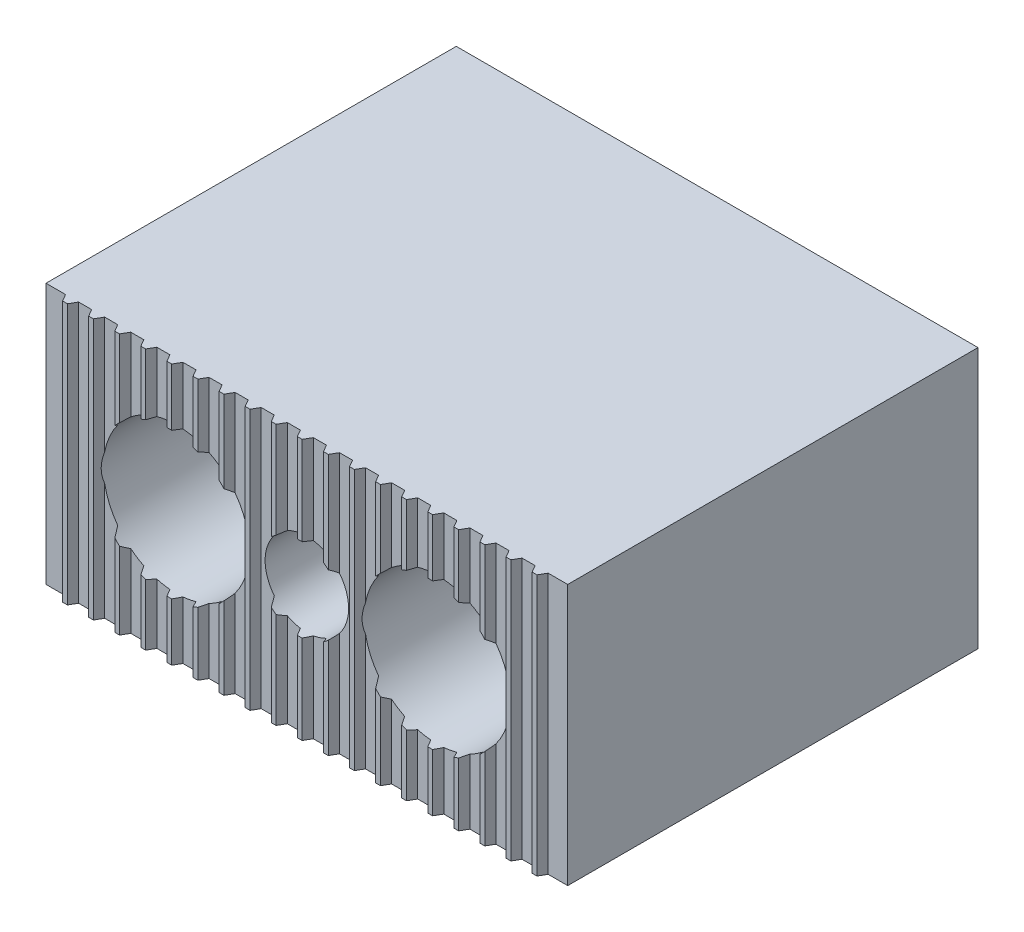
ISO-10303-21;
HEADER;
FILE_DESCRIPTION(('STEP AP214'),'2;1');
FILE_NAME('part.step','',(''),(''),'','','');
FILE_SCHEMA(('AUTOMOTIVE_DESIGN { 1 0 10303 214 1 1 1 1 }'));
ENDSEC;
DATA;
#1=APPLICATION_CONTEXT('core data for automotive mechanical design processes');
#2=APPLICATION_PROTOCOL_DEFINITION('international standard','automotive_design',2000,#1);
#3=PRODUCT_CONTEXT('',#1,'mechanical');
#4=PRODUCT('Part','Part','',(#3));
#5=PRODUCT_RELATED_PRODUCT_CATEGORY('part','',(#4));
#6=PRODUCT_DEFINITION_FORMATION('','',#4);
#7=PRODUCT_DEFINITION_CONTEXT('part definition',#1,'design');
#8=PRODUCT_DEFINITION('design','',#6,#7);
#9=PRODUCT_DEFINITION_SHAPE('','',#8);
#10=(LENGTH_UNIT() NAMED_UNIT(*) SI_UNIT(.MILLI.,.METRE.));
#11=(NAMED_UNIT(*) PLANE_ANGLE_UNIT() SI_UNIT($,.RADIAN.));
#12=(NAMED_UNIT(*) SI_UNIT($,.STERADIAN.) SOLID_ANGLE_UNIT());
#13=UNCERTAINTY_MEASURE_WITH_UNIT(LENGTH_MEASURE(1.E-05),#10,'distance_accuracy_value','');
#14=(GEOMETRIC_REPRESENTATION_CONTEXT(3) GLOBAL_UNCERTAINTY_ASSIGNED_CONTEXT((#13)) GLOBAL_UNIT_ASSIGNED_CONTEXT((#10,
#11,#12)) REPRESENTATION_CONTEXT('',''));
#15=CARTESIAN_POINT('',(0.,0.,0.));
#16=DIRECTION('',(0.,0.,1.));
#17=DIRECTION('',(1.,0.,0.));
#18=AXIS2_PLACEMENT_3D('',#15,#16,#17);
#19=CARTESIAN_POINT('',(9.76905989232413,12.5,40.));
#20=DIRECTION('',(-0.866025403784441,0.,0.5));
#21=DIRECTION('',(0.5,0.,0.866025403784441));
#22=AXIS2_PLACEMENT_3D('',#19,#20,#21);
#23=PLANE('',#22);
#24=CARTESIAN_POINT('',(12.5,0.,44.7301270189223));
#25=DIRECTION('',(-0.866025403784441,0.,0.5));
#26=DIRECTION('',(0.5,0.,0.866025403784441));
#27=AXIS2_PLACEMENT_3D('',#24,#25,#26);
#28=ELLIPSE('',#27,8.,4.);
#29=CARTESIAN_POINT('',(9.76905989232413,2.92266421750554,40.));
#30=VERTEX_POINT('',#29);
#31=CARTESIAN_POINT('',(9.37646170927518,2.49870137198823,39.32));
#32=VERTEX_POINT('',#31);
#33=EDGE_CURVE('E1540',#30,#32,#28,.T.);
#34=ORIENTED_EDGE('',*,*,#33,.F.);
#35=DIRECTION('',(0.,-1.,0.));
#36=VECTOR('',#35,1.);
#37=CARTESIAN_POINT('',(9.76905989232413,12.5,40.));
#38=LINE('',#37,#36);
#39=CARTESIAN_POINT('',(9.76905989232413,12.5,40.));
#40=VERTEX_POINT('',#39);
#41=EDGE_CURVE('E907',#40,#30,#38,.T.);
#42=ORIENTED_EDGE('',*,*,#41,.F.);
#43=DIRECTION('',(-0.5,0.,-0.866025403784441));
#44=VECTOR('',#43,1.);
#45=CARTESIAN_POINT('',(9.76905989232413,12.5,40.));
#46=LINE('',#45,#44);
#47=CARTESIAN_POINT('',(9.37646170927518,12.5,39.32));
#48=VERTEX_POINT('',#47);
#49=EDGE_CURVE('E1279',#40,#48,#46,.T.);
#50=ORIENTED_EDGE('',*,*,#49,.T.);
#51=DIRECTION('',(0.,-1.,0.));
#52=VECTOR('',#51,1.);
#53=CARTESIAN_POINT('',(9.37646170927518,12.5,39.32));
#54=LINE('',#53,#52);
#55=EDGE_CURVE('E911',#48,#32,#54,.T.);
#56=ORIENTED_EDGE('',*,*,#55,.T.);
#57=EDGE_LOOP('',(#34,#42,#50,#56));
#58=FACE_BOUND('',#57,.T.);
#59=ADVANCED_FACE('F14',(#58),#23,.T.);
#60=CARTESIAN_POINT('',(10.2309401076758,12.5,40.));
#61=DIRECTION('',(0.,0.,1.));
#62=DIRECTION('',(1.,0.,0.));
#63=AXIS2_PLACEMENT_3D('',#60,#61,#62);
#64=PLANE('',#63);
#65=CARTESIAN_POINT('',(12.5,0.,40.));
#66=DIRECTION('',(0.,0.,1.));
#67=DIRECTION('',(1.,0.,0.));
#68=AXIS2_PLACEMENT_3D('',#65,#66,#67);
#69=CIRCLE('',#68,4.);
#70=CARTESIAN_POINT('',(10.2309401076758,3.29414134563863,40.));
#71=VERTEX_POINT('',#70);
#72=EDGE_CURVE('E1837',#71,#30,#69,.T.);
#73=ORIENTED_EDGE('',*,*,#72,.F.);
#74=DIRECTION('',(0.,-1.,0.));
#75=VECTOR('',#74,1.);
#76=CARTESIAN_POINT('',(10.2309401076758,12.5,40.));
#77=LINE('',#76,#75);
#78=CARTESIAN_POINT('',(10.2309401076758,12.5,40.));
#79=VERTEX_POINT('',#78);
#80=EDGE_CURVE('E903',#79,#71,#77,.T.);
#81=ORIENTED_EDGE('',*,*,#80,.F.);
#82=DIRECTION('',(-1.,0.,0.));
#83=VECTOR('',#82,1.);
#84=CARTESIAN_POINT('',(10.2309401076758,12.5,40.));
#85=LINE('',#84,#83);
#86=EDGE_CURVE('E1276',#79,#40,#85,.T.);
#87=ORIENTED_EDGE('',*,*,#86,.T.);
#88=ORIENTED_EDGE('',*,*,#41,.T.);
#89=EDGE_LOOP('',(#73,#81,#87,#88));
#90=FACE_BOUND('',#89,.T.);
#91=ADVANCED_FACE('F1836',(#90),#64,.T.);
#92=CARTESIAN_POINT('',(10.2309401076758,12.5,40.));
#93=DIRECTION('',(-0.866025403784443,0.,-0.499999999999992));
#94=DIRECTION('',(-0.499999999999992,0.,0.866025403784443));
#95=AXIS2_PLACEMENT_3D('',#92,#93,#94);
#96=PLANE('',#95);
#97=ORIENTED_EDGE('',*,*,#80,.T.);
#98=CARTESIAN_POINT('',(12.5,0.,36.0698729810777));
#99=DIRECTION('',(-0.866025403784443,0.,-0.499999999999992));
#100=DIRECTION('',(-0.499999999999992,0.,0.866025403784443));
#101=AXIS2_PLACEMENT_3D('',#98,#99,#100);
#102=ELLIPSE('',#101,8.00000000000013,4.);
#103=CARTESIAN_POINT('',(10.6235382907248,3.53254744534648,39.32));
#104=VERTEX_POINT('',#103);
#105=EDGE_CURVE('E1536',#71,#104,#102,.T.);
#106=ORIENTED_EDGE('',*,*,#105,.T.);
#107=DIRECTION('',(0.,-1.,0.));
#108=VECTOR('',#107,1.);
#109=CARTESIAN_POINT('',(10.6235382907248,12.5,39.32));
#110=LINE('',#109,#108);
#111=CARTESIAN_POINT('',(10.6235382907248,12.5,39.32));
#112=VERTEX_POINT('',#111);
#113=EDGE_CURVE('E899',#112,#104,#110,.T.);
#114=ORIENTED_EDGE('',*,*,#113,.F.);
#115=DIRECTION('',(0.499999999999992,0.,-0.866025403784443));
#116=VECTOR('',#115,1.);
#117=CARTESIAN_POINT('',(10.2309401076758,12.5,40.));
#118=LINE('',#117,#116);
#119=EDGE_CURVE('E1273',#79,#112,#118,.T.);
#120=ORIENTED_EDGE('',*,*,#119,.F.);
#121=EDGE_LOOP('',(#97,#106,#114,#120));
#122=FACE_BOUND('',#121,.T.);
#123=ADVANCED_FACE('F1841',(#122),#96,.F.);
#124=CARTESIAN_POINT('',(11.8764617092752,12.5,39.32));
#125=DIRECTION('',(0.,0.,1.));
#126=DIRECTION('',(1.,0.,0.));
#127=AXIS2_PLACEMENT_3D('',#124,#125,#126);
#128=PLANE('',#127);
#129=CARTESIAN_POINT('',(12.5,0.,39.32));
#130=DIRECTION('',(0.,0.,1.));
#131=DIRECTION('',(1.,0.,0.));
#132=AXIS2_PLACEMENT_3D('',#129,#130,#131);
#133=CIRCLE('',#132,4.);
#134=CARTESIAN_POINT('',(11.8764617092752,3.9511011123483,39.32));
#135=VERTEX_POINT('',#134);
#136=EDGE_CURVE('E1533',#135,#104,#133,.T.);
#137=ORIENTED_EDGE('',*,*,#136,.F.);
#138=DIRECTION('',(0.,-1.,0.));
#139=VECTOR('',#138,1.);
#140=CARTESIAN_POINT('',(11.8764617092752,12.5,39.32));
#141=LINE('',#140,#139);
#142=CARTESIAN_POINT('',(11.8764617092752,12.5,39.32));
#143=VERTEX_POINT('',#142);
#144=EDGE_CURVE('E895',#143,#135,#141,.T.);
#145=ORIENTED_EDGE('',*,*,#144,.F.);
#146=DIRECTION('',(-1.,0.,0.));
#147=VECTOR('',#146,1.);
#148=CARTESIAN_POINT('',(11.8764617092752,12.5,39.32));
#149=LINE('',#148,#147);
#150=EDGE_CURVE('E1270',#143,#112,#149,.T.);
#151=ORIENTED_EDGE('',*,*,#150,.T.);
#152=ORIENTED_EDGE('',*,*,#113,.T.);
#153=EDGE_LOOP('',(#137,#145,#151,#152));
#154=FACE_BOUND('',#153,.T.);
#155=ADVANCED_FACE('F1845',(#154),#128,.T.);
#156=CARTESIAN_POINT('',(12.2690598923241,12.5,40.));
#157=DIRECTION('',(-0.866025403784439,0.,0.5));
#158=DIRECTION('',(0.5,0.,0.866025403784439));
#159=AXIS2_PLACEMENT_3D('',#156,#157,#158);
#160=PLANE('',#159);
#161=CARTESIAN_POINT('',(12.5,0.,40.4));
#162=DIRECTION('',(-0.866025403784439,0.,0.5));
#163=DIRECTION('',(0.5,0.,0.866025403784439));
#164=AXIS2_PLACEMENT_3D('',#161,#162,#163);
#165=ELLIPSE('',#164,8.,4.);
#166=CARTESIAN_POINT('',(12.2690598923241,3.99332776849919,40.));
#167=VERTEX_POINT('',#166);
#168=EDGE_CURVE('E1530',#167,#135,#165,.T.);
#169=ORIENTED_EDGE('',*,*,#168,.F.);
#170=DIRECTION('',(0.,-1.,0.));
#171=VECTOR('',#170,1.);
#172=CARTESIAN_POINT('',(12.2690598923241,12.5,40.));
#173=LINE('',#172,#171);
#174=CARTESIAN_POINT('',(12.2690598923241,12.5,40.));
#175=VERTEX_POINT('',#174);
#176=EDGE_CURVE('E891',#175,#167,#173,.T.);
#177=ORIENTED_EDGE('',*,*,#176,.F.);
#178=DIRECTION('',(-0.5,0.,-0.866025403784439));
#179=VECTOR('',#178,1.);
#180=CARTESIAN_POINT('',(12.2690598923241,12.5,40.));
#181=LINE('',#180,#179);
#182=EDGE_CURVE('E1267',#175,#143,#181,.T.);
#183=ORIENTED_EDGE('',*,*,#182,.T.);
#184=ORIENTED_EDGE('',*,*,#144,.T.);
#185=EDGE_LOOP('',(#169,#177,#183,#184));
#186=FACE_BOUND('',#185,.T.);
#187=ADVANCED_FACE('F1850',(#186),#160,.T.);
#188=CARTESIAN_POINT('',(12.7309401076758,12.5,40.));
#189=DIRECTION('',(0.,0.,1.));
#190=DIRECTION('',(1.,0.,0.));
#191=AXIS2_PLACEMENT_3D('',#188,#189,#190);
#192=PLANE('',#191);
#193=CARTESIAN_POINT('',(12.7309401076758,3.99332776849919,40.));
#194=VERTEX_POINT('',#193);
#195=EDGE_CURVE('E863',#194,#167,#69,.T.);
#196=ORIENTED_EDGE('',*,*,#195,.F.);
#197=DIRECTION('',(0.,-1.,0.));
#198=VECTOR('',#197,1.);
#199=CARTESIAN_POINT('',(12.7309401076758,12.5,40.));
#200=LINE('',#199,#198);
#201=CARTESIAN_POINT('',(12.7309401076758,12.5,40.));
#202=VERTEX_POINT('',#201);
#203=EDGE_CURVE('E887',#202,#194,#200,.T.);
#204=ORIENTED_EDGE('',*,*,#203,.F.);
#205=DIRECTION('',(-1.,0.,0.));
#206=VECTOR('',#205,1.);
#207=CARTESIAN_POINT('',(12.7309401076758,12.5,40.));
#208=LINE('',#207,#206);
#209=EDGE_CURVE('E1264',#202,#175,#208,.T.);
#210=ORIENTED_EDGE('',*,*,#209,.T.);
#211=ORIENTED_EDGE('',*,*,#176,.T.);
#212=EDGE_LOOP('',(#196,#204,#210,#211));
#213=FACE_BOUND('',#212,.T.);
#214=ADVANCED_FACE('F1853',(#213),#192,.T.);
#215=CARTESIAN_POINT('',(12.7309401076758,12.5,40.));
#216=DIRECTION('',(-0.866025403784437,0.,-0.5));
#217=DIRECTION('',(-0.5,0.,0.866025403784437));
#218=AXIS2_PLACEMENT_3D('',#215,#216,#217);
#219=PLANE('',#218);
#220=ORIENTED_EDGE('',*,*,#203,.T.);
#221=CARTESIAN_POINT('',(12.5,0.,40.4));
#222=DIRECTION('',(-0.866025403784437,0.,-0.5));
#223=DIRECTION('',(-0.5,0.,0.866025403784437));
#224=AXIS2_PLACEMENT_3D('',#221,#222,#223);
#225=ELLIPSE('',#224,8.,4.);
#226=CARTESIAN_POINT('',(13.1235382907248,3.9511011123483,39.32));
#227=VERTEX_POINT('',#226);
#228=EDGE_CURVE('E1518',#194,#227,#225,.T.);
#229=ORIENTED_EDGE('',*,*,#228,.T.);
#230=DIRECTION('',(0.,-1.,0.));
#231=VECTOR('',#230,1.);
#232=CARTESIAN_POINT('',(13.1235382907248,12.5,39.32));
#233=LINE('',#232,#231);
#234=CARTESIAN_POINT('',(13.1235382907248,12.5,39.32));
#235=VERTEX_POINT('',#234);
#236=EDGE_CURVE('E883',#235,#227,#233,.T.);
#237=ORIENTED_EDGE('',*,*,#236,.F.);
#238=DIRECTION('',(0.5,0.,-0.866025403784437));
#239=VECTOR('',#238,1.);
#240=CARTESIAN_POINT('',(12.7309401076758,12.5,40.));
#241=LINE('',#240,#239);
#242=EDGE_CURVE('E1261',#202,#235,#241,.T.);
#243=ORIENTED_EDGE('',*,*,#242,.F.);
#244=EDGE_LOOP('',(#220,#229,#237,#243));
#245=FACE_BOUND('',#244,.T.);
#246=ADVANCED_FACE('F1856',(#245),#219,.F.);
#247=CARTESIAN_POINT('',(14.3764617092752,12.5,39.32));
#248=DIRECTION('',(0.,0.,1.));
#249=DIRECTION('',(1.,0.,0.));
#250=AXIS2_PLACEMENT_3D('',#247,#248,#249);
#251=PLANE('',#250);
#252=CARTESIAN_POINT('',(12.5,0.,39.32));
#253=DIRECTION('',(0.,0.,1.));
#254=DIRECTION('',(1.,0.,0.));
#255=AXIS2_PLACEMENT_3D('',#252,#253,#254);
#256=CIRCLE('',#255,4.);
#257=CARTESIAN_POINT('',(14.3764617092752,3.53254744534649,39.32));
#258=VERTEX_POINT('',#257);
#259=EDGE_CURVE('E1515',#258,#227,#256,.T.);
#260=ORIENTED_EDGE('',*,*,#259,.F.);
#261=DIRECTION('',(0.,-1.,0.));
#262=VECTOR('',#261,1.);
#263=CARTESIAN_POINT('',(14.3764617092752,12.5,39.32));
#264=LINE('',#263,#262);
#265=CARTESIAN_POINT('',(14.3764617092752,12.5,39.32));
#266=VERTEX_POINT('',#265);
#267=EDGE_CURVE('E879',#266,#258,#264,.T.);
#268=ORIENTED_EDGE('',*,*,#267,.F.);
#269=DIRECTION('',(-1.,0.,0.));
#270=VECTOR('',#269,1.);
#271=CARTESIAN_POINT('',(14.3764617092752,12.5,39.32));
#272=LINE('',#271,#270);
#273=EDGE_CURVE('E1258',#266,#235,#272,.T.);
#274=ORIENTED_EDGE('',*,*,#273,.T.);
#275=ORIENTED_EDGE('',*,*,#236,.T.);
#276=EDGE_LOOP('',(#260,#268,#274,#275));
#277=FACE_BOUND('',#276,.T.);
#278=ADVANCED_FACE('F1859',(#277),#251,.T.);
#279=CARTESIAN_POINT('',(14.7690598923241,12.5,40.));
#280=DIRECTION('',(-0.866025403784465,0.,0.499999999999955));
#281=DIRECTION('',(0.499999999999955,0.,0.866025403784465));
#282=AXIS2_PLACEMENT_3D('',#279,#280,#281);
#283=PLANE('',#282);
#284=CARTESIAN_POINT('',(12.5,0.,36.0698729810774));
#285=DIRECTION('',(-0.866025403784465,0.,0.499999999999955));
#286=DIRECTION('',(0.499999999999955,0.,0.866025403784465));
#287=AXIS2_PLACEMENT_3D('',#284,#285,#286);
#288=ELLIPSE('',#287,8.00000000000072,4.);
#289=CARTESIAN_POINT('',(14.7690598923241,3.29414134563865,40.));
#290=VERTEX_POINT('',#289);
#291=EDGE_CURVE('E1513',#290,#258,#288,.T.);
#292=ORIENTED_EDGE('',*,*,#291,.F.);
#293=DIRECTION('',(0.,-1.,0.));
#294=VECTOR('',#293,1.);
#295=CARTESIAN_POINT('',(14.7690598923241,12.5,40.));
#296=LINE('',#295,#294);
#297=CARTESIAN_POINT('',(14.7690598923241,12.5,40.));
#298=VERTEX_POINT('',#297);
#299=EDGE_CURVE('E861',#298,#290,#296,.T.);
#300=ORIENTED_EDGE('',*,*,#299,.F.);
#301=DIRECTION('',(-0.499999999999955,0.,-0.866025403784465));
#302=VECTOR('',#301,1.);
#303=CARTESIAN_POINT('',(14.7690598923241,12.5,40.));
#304=LINE('',#303,#302);
#305=EDGE_CURVE('E1255',#298,#266,#304,.T.);
#306=ORIENTED_EDGE('',*,*,#305,.T.);
#307=ORIENTED_EDGE('',*,*,#267,.T.);
#308=EDGE_LOOP('',(#292,#300,#306,#307));
#309=FACE_BOUND('',#308,.T.);
#310=ADVANCED_FACE('F1512',(#309),#283,.T.);
#311=CARTESIAN_POINT('',(15.2309401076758,12.5,40.));
#312=DIRECTION('',(0.,0.,1.));
#313=DIRECTION('',(1.,0.,0.));
#314=AXIS2_PLACEMENT_3D('',#311,#312,#313);
#315=PLANE('',#314);
#316=CARTESIAN_POINT('',(15.2309401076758,2.92266421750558,40.));
#317=VERTEX_POINT('',#316);
#318=EDGE_CURVE('E848',#317,#290,#69,.T.);
#319=ORIENTED_EDGE('',*,*,#318,.F.);
#320=DIRECTION('',(0.,-1.,0.));
#321=VECTOR('',#320,1.);
#322=CARTESIAN_POINT('',(15.2309401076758,12.5,40.));
#323=LINE('',#322,#321);
#324=CARTESIAN_POINT('',(15.2309401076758,12.5,40.));
#325=VERTEX_POINT('',#324);
#326=EDGE_CURVE('E859',#325,#317,#323,.T.);
#327=ORIENTED_EDGE('',*,*,#326,.F.);
#328=DIRECTION('',(-1.,0.,0.));
#329=VECTOR('',#328,1.);
#330=CARTESIAN_POINT('',(15.2309401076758,12.5,40.));
#331=LINE('',#330,#329);
#332=EDGE_CURVE('E1253',#325,#298,#331,.T.);
#333=ORIENTED_EDGE('',*,*,#332,.T.);
#334=ORIENTED_EDGE('',*,*,#299,.T.);
#335=EDGE_LOOP('',(#319,#327,#333,#334));
#336=FACE_BOUND('',#335,.T.);
#337=ADVANCED_FACE('F857',(#336),#315,.T.);
#338=CARTESIAN_POINT('',(15.2309401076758,12.5,40.));
#339=DIRECTION('',(-0.866025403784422,0.,-0.500000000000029));
#340=DIRECTION('',(-0.500000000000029,0.,0.866025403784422));
#341=AXIS2_PLACEMENT_3D('',#338,#339,#340);
#342=PLANE('',#341);
#343=ORIENTED_EDGE('',*,*,#326,.T.);
#344=CARTESIAN_POINT('',(12.5,0.,44.7301270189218));
#345=DIRECTION('',(-0.866025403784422,0.,-0.500000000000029));
#346=DIRECTION('',(-0.500000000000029,0.,0.866025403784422));
#347=AXIS2_PLACEMENT_3D('',#344,#345,#346);
#348=ELLIPSE('',#347,7.99999999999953,4.);
#349=CARTESIAN_POINT('',(15.6235382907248,2.49870137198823,39.32));
#350=VERTEX_POINT('',#349);
#351=EDGE_CURVE('E844',#317,#350,#348,.T.);
#352=ORIENTED_EDGE('',*,*,#351,.T.);
#353=DIRECTION('',(0.,-1.,0.));
#354=VECTOR('',#353,1.);
#355=CARTESIAN_POINT('',(15.6235382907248,12.5,39.32));
#356=LINE('',#355,#354);
#357=CARTESIAN_POINT('',(15.6235382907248,12.5,39.32));
#358=VERTEX_POINT('',#357);
#359=EDGE_CURVE('E874',#358,#350,#356,.T.);
#360=ORIENTED_EDGE('',*,*,#359,.F.);
#361=DIRECTION('',(0.500000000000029,0.,-0.866025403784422));
#362=VECTOR('',#361,1.);
#363=CARTESIAN_POINT('',(15.2309401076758,12.5,40.));
#364=LINE('',#363,#362);
#365=EDGE_CURVE('E869',#325,#358,#364,.T.);
#366=ORIENTED_EDGE('',*,*,#365,.F.);
#367=EDGE_LOOP('',(#343,#352,#360,#366));
#368=FACE_BOUND('',#367,.T.);
#369=ADVANCED_FACE('F867',(#368),#342,.F.);
#370=CARTESIAN_POINT('',(-12.5,12.5,0.));
#371=DIRECTION('',(0.,0.,-1.));
#372=DIRECTION('',(-1.,0.,0.));
#373=AXIS2_PLACEMENT_3D('',#370,#371,#372);
#374=PLANE('',#373);
#375=CARTESIAN_POINT('',(25.,0.,0.));
#376=DIRECTION('',(0.,0.,-1.));
#377=DIRECTION('',(-1.,0.,0.));
#378=AXIS2_PLACEMENT_3D('',#375,#376,#377);
#379=CIRCLE('',#378,4.5);
#380=CARTESIAN_POINT('',(20.5,0.,0.));
#381=VERTEX_POINT('',#380);
#382=EDGE_CURVE('E1613',#381,#381,#379,.T.);
#383=ORIENTED_EDGE('',*,*,#382,.F.);
#384=EDGE_LOOP('',(#383));
#385=FACE_BOUND('',#384,.T.);
#386=DIRECTION('',(0.,-1.,0.));
#387=VECTOR('',#386,1.);
#388=CARTESIAN_POINT('',(-12.5,12.5,0.));
#389=LINE('',#388,#387);
#390=CARTESIAN_POINT('',(-12.5,12.5,0.));
#391=VERTEX_POINT('',#390);
#392=CARTESIAN_POINT('',(-12.5,-12.5,0.));
#393=VERTEX_POINT('',#392);
#394=EDGE_CURVE('E1024',#391,#393,#389,.T.);
#395=ORIENTED_EDGE('',*,*,#394,.F.);
#396=DIRECTION('',(1.,0.,0.));
#397=VECTOR('',#396,1.);
#398=CARTESIAN_POINT('',(-12.5,12.5,0.));
#399=LINE('',#398,#397);
#400=CARTESIAN_POINT('',(37.5,12.5,0.));
#401=VERTEX_POINT('',#400);
#402=EDGE_CURVE('E1383',#391,#401,#399,.T.);
#403=ORIENTED_EDGE('',*,*,#402,.T.);
#404=DIRECTION('',(0.,-1.,0.));
#405=VECTOR('',#404,1.);
#406=CARTESIAN_POINT('',(37.5,12.5,0.));
#407=LINE('',#406,#405);
#408=CARTESIAN_POINT('',(37.5,-12.5,0.));
#409=VERTEX_POINT('',#408);
#410=EDGE_CURVE('E1026',#401,#409,#407,.T.);
#411=ORIENTED_EDGE('',*,*,#410,.T.);
#412=DIRECTION('',(1.,0.,0.));
#413=VECTOR('',#412,1.);
#414=CARTESIAN_POINT('',(-12.5,-12.5,0.));
#415=LINE('',#414,#413);
#416=EDGE_CURVE('E1145',#393,#409,#415,.T.);
#417=ORIENTED_EDGE('',*,*,#416,.F.);
#418=EDGE_LOOP('',(#395,#403,#411,#417));
#419=FACE_BOUND('',#418,.T.);
#420=CARTESIAN_POINT('',(0.,0.,0.));
#421=DIRECTION('',(0.,0.,-1.));
#422=DIRECTION('',(-1.,0.,0.));
#423=AXIS2_PLACEMENT_3D('',#420,#421,#422);
#424=CIRCLE('',#423,4.5);
#425=CARTESIAN_POINT('',(-4.5,0.,0.));
#426=VERTEX_POINT('',#425);
#427=EDGE_CURVE('E1543',#426,#426,#424,.T.);
#428=ORIENTED_EDGE('',*,*,#427,.F.);
#429=EDGE_LOOP('',(#428));
#430=FACE_BOUND('',#429,.T.);
#431=ADVANCED_FACE('F16',(#385,#419,#430),#374,.T.);
#432=CARTESIAN_POINT('',(-7.26905989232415,12.5,40.));
#433=DIRECTION('',(-0.866025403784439,0.,-0.5));
#434=DIRECTION('',(-0.5,0.,0.866025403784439));
#435=AXIS2_PLACEMENT_3D('',#432,#433,#434);
#436=PLANE('',#435);
#437=CARTESIAN_POINT('',(0.,0.,27.4096189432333));
#438=DIRECTION('',(-0.866025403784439,0.,-0.5));
#439=DIRECTION('',(0.5,0.,-0.866025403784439));
#440=AXIS2_PLACEMENT_3D('',#437,#438,#439);
#441=ELLIPSE('',#440,14.,7.);
#442=CARTESIAN_POINT('',(-6.8764617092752,1.3093030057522,39.32));
#443=VERTEX_POINT('',#442);
#444=CARTESIAN_POINT('',(-6.8764617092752,-1.3093030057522,39.32));
#445=VERTEX_POINT('',#444);
#446=EDGE_CURVE('E1610',#443,#445,#441,.F.);
#447=ORIENTED_EDGE('',*,*,#446,.F.);
#448=DIRECTION('',(0.,-1.,0.));
#449=VECTOR('',#448,1.);
#450=CARTESIAN_POINT('',(-6.8764617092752,12.5,39.32));
#451=LINE('',#450,#449);
#452=CARTESIAN_POINT('',(-6.8764617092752,12.5,39.32));
#453=VERTEX_POINT('',#452);
#454=EDGE_CURVE('E1005',#453,#443,#451,.T.);
#455=ORIENTED_EDGE('',*,*,#454,.F.);
#456=DIRECTION('',(0.5,0.,-0.866025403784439));
#457=VECTOR('',#456,1.);
#458=CARTESIAN_POINT('',(-7.26905989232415,12.5,40.));
#459=LINE('',#458,#457);
#460=CARTESIAN_POINT('',(-7.26905989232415,12.5,40.));
#461=VERTEX_POINT('',#460);
#462=EDGE_CURVE('E1356',#461,#453,#459,.T.);
#463=ORIENTED_EDGE('',*,*,#462,.F.);
#464=DIRECTION('',(0.,-1.,0.));
#465=VECTOR('',#464,1.);
#466=CARTESIAN_POINT('',(-7.26905989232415,12.5,40.));
#467=LINE('',#466,#465);
#468=CARTESIAN_POINT('',(-7.26905989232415,-12.5,40.));
#469=VERTEX_POINT('',#468);
#470=EDGE_CURVE('E1008',#461,#469,#467,.T.);
#471=ORIENTED_EDGE('',*,*,#470,.T.);
#472=DIRECTION('',(0.5,0.,-0.866025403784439));
#473=VECTOR('',#472,1.);
#474=CARTESIAN_POINT('',(-7.26905989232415,-12.5,40.));
#475=LINE('',#474,#473);
#476=CARTESIAN_POINT('',(-6.8764617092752,-12.5,39.32));
#477=VERTEX_POINT('',#476);
#478=EDGE_CURVE('E1118',#469,#477,#475,.T.);
#479=ORIENTED_EDGE('',*,*,#478,.T.);
#480=EDGE_CURVE('E1004',#445,#477,#451,.T.);
#481=ORIENTED_EDGE('',*,*,#480,.F.);
#482=EDGE_LOOP('',(#447,#455,#463,#471,#479,#481));
#483=FACE_BOUND('',#482,.T.);
#484=ADVANCED_FACE('F2044',(#483),#436,.F.);
#485=CARTESIAN_POINT('',(-5.6235382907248,12.5,39.32));
#486=DIRECTION('',(0.,0.,1.));
#487=DIRECTION('',(1.,0.,0.));
#488=AXIS2_PLACEMENT_3D('',#485,#486,#487);
#489=PLANE('',#488);
#490=DIRECTION('',(0.,-1.,0.));
#491=VECTOR('',#490,1.);
#492=CARTESIAN_POINT('',(-5.6235382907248,12.5,39.32));
#493=LINE('',#492,#491);
#494=CARTESIAN_POINT('',(-5.6235382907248,-4.1684310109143,39.32));
#495=VERTEX_POINT('',#494);
#496=CARTESIAN_POINT('',(-5.6235382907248,-12.5,39.32));
#497=VERTEX_POINT('',#496);
#498=EDGE_CURVE('E1000',#495,#497,#493,.T.);
#499=ORIENTED_EDGE('',*,*,#498,.F.);
#500=CARTESIAN_POINT('',(0.,0.,39.32));
#501=DIRECTION('',(0.,0.,1.));
#502=DIRECTION('',(1.,0.,0.));
#503=AXIS2_PLACEMENT_3D('',#500,#501,#502);
#504=CIRCLE('',#503,7.);
#505=EDGE_CURVE('E1606',#495,#445,#504,.F.);
#506=ORIENTED_EDGE('',*,*,#505,.T.);
#507=ORIENTED_EDGE('',*,*,#480,.T.);
#508=DIRECTION('',(-1.,0.,0.));
#509=VECTOR('',#508,1.);
#510=CARTESIAN_POINT('',(-5.6235382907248,-12.5,39.32));
#511=LINE('',#510,#509);
#512=EDGE_CURVE('E1115',#497,#477,#511,.T.);
#513=ORIENTED_EDGE('',*,*,#512,.F.);
#514=EDGE_LOOP('',(#499,#506,#507,#513));
#515=FACE_BOUND('',#514,.T.);
#516=ADVANCED_FACE('F2374',(#515),#489,.T.);
#517=ORIENTED_EDGE('',*,*,#454,.T.);
#518=CARTESIAN_POINT('',(-5.6235382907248,4.1684310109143,39.32));
#519=VERTEX_POINT('',#518);
#520=EDGE_CURVE('E1611',#443,#519,#504,.F.);
#521=ORIENTED_EDGE('',*,*,#520,.T.);
#522=CARTESIAN_POINT('',(-5.6235382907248,12.5,39.32));
#523=VERTEX_POINT('',#522);
#524=EDGE_CURVE('E1001',#523,#519,#493,.T.);
#525=ORIENTED_EDGE('',*,*,#524,.F.);
#526=DIRECTION('',(-1.,0.,0.));
#527=VECTOR('',#526,1.);
#528=CARTESIAN_POINT('',(-5.6235382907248,12.5,39.32));
#529=LINE('',#528,#527);
#530=EDGE_CURVE('E1353',#523,#453,#529,.T.);
#531=ORIENTED_EDGE('',*,*,#530,.T.);
#532=EDGE_LOOP('',(#517,#521,#525,#531));
#533=FACE_BOUND('',#532,.T.);
#534=ADVANCED_FACE('F2049',(#533),#489,.T.);
#535=CARTESIAN_POINT('',(-5.2309401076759,12.5,40.));
#536=DIRECTION('',(-0.866025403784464,0.,0.499999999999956));
#537=DIRECTION('',(0.499999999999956,0.,0.866025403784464));
#538=AXIS2_PLACEMENT_3D('',#535,#536,#537);
#539=PLANE('',#538);
#540=ORIENTED_EDGE('',*,*,#524,.T.);
#541=CARTESIAN_POINT('',(0.,0.,49.0602540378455));
#542=DIRECTION('',(-0.866025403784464,0.,0.499999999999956));
#543=DIRECTION('',(-0.499999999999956,0.,-0.866025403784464));
#544=AXIS2_PLACEMENT_3D('',#541,#542,#543);
#545=ELLIPSE('',#544,14.0000000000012,7.);
#546=CARTESIAN_POINT('',(-5.2309401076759,4.65158742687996,40.));
#547=VERTEX_POINT('',#546);
#548=EDGE_CURVE('E1607',#519,#547,#545,.F.);
#549=ORIENTED_EDGE('',*,*,#548,.T.);
#550=DIRECTION('',(0.,-1.,0.));
#551=VECTOR('',#550,1.);
#552=CARTESIAN_POINT('',(-5.2309401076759,12.5,40.));
#553=LINE('',#552,#551);
#554=CARTESIAN_POINT('',(-5.2309401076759,12.5,40.));
#555=VERTEX_POINT('',#554);
#556=EDGE_CURVE('E997',#555,#547,#553,.T.);
#557=ORIENTED_EDGE('',*,*,#556,.F.);
#558=DIRECTION('',(-0.499999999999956,0.,-0.866025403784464));
#559=VECTOR('',#558,1.);
#560=CARTESIAN_POINT('',(-5.2309401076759,12.5,40.));
#561=LINE('',#560,#559);
#562=EDGE_CURVE('E1350',#555,#523,#561,.T.);
#563=ORIENTED_EDGE('',*,*,#562,.T.);
#564=EDGE_LOOP('',(#540,#549,#557,#563));
#565=FACE_BOUND('',#564,.T.);
#566=ADVANCED_FACE('F2053',(#565),#539,.T.);
#567=CARTESIAN_POINT('',(-5.2309401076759,-4.65158742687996,40.));
#568=VERTEX_POINT('',#567);
#569=CARTESIAN_POINT('',(-5.2309401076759,-12.5,40.));
#570=VERTEX_POINT('',#569);
#571=EDGE_CURVE('E996',#568,#570,#553,.T.);
#572=ORIENTED_EDGE('',*,*,#571,.F.);
#573=EDGE_CURVE('E1603',#568,#495,#545,.F.);
#574=ORIENTED_EDGE('',*,*,#573,.T.);
#575=ORIENTED_EDGE('',*,*,#498,.T.);
#576=DIRECTION('',(-0.499999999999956,0.,-0.866025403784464));
#577=VECTOR('',#576,1.);
#578=CARTESIAN_POINT('',(-5.2309401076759,-12.5,40.));
#579=LINE('',#578,#577);
#580=EDGE_CURVE('E1112',#570,#497,#579,.T.);
#581=ORIENTED_EDGE('',*,*,#580,.F.);
#582=EDGE_LOOP('',(#572,#574,#575,#581));
#583=FACE_BOUND('',#582,.T.);
#584=ADVANCED_FACE('F2162',(#583),#539,.T.);
#585=CARTESIAN_POINT('',(-4.76905989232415,12.5,40.));
#586=DIRECTION('',(0.,0.,1.));
#587=DIRECTION('',(1.,0.,0.));
#588=AXIS2_PLACEMENT_3D('',#585,#586,#587);
#589=PLANE('',#588);
#590=DIRECTION('',(0.,-1.,0.));
#591=VECTOR('',#590,1.);
#592=CARTESIAN_POINT('',(-4.76905989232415,12.5,40.));
#593=LINE('',#592,#591);
#594=CARTESIAN_POINT('',(-4.76905989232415,-5.12406749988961,40.));
#595=VERTEX_POINT('',#594);
#596=CARTESIAN_POINT('',(-4.76905989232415,-12.5,40.));
#597=VERTEX_POINT('',#596);
#598=EDGE_CURVE('E992',#595,#597,#593,.T.);
#599=ORIENTED_EDGE('',*,*,#598,.F.);
#600=CARTESIAN_POINT('',(0.,0.,40.));
#601=DIRECTION('',(0.,0.,-1.));
#602=DIRECTION('',(-1.,0.,0.));
#603=AXIS2_PLACEMENT_3D('',#600,#601,#602);
#604=CIRCLE('',#603,7.);
#605=EDGE_CURVE('E1552',#595,#568,#604,.T.);
#606=ORIENTED_EDGE('',*,*,#605,.T.);
#607=ORIENTED_EDGE('',*,*,#571,.T.);
#608=DIRECTION('',(-1.,0.,0.));
#609=VECTOR('',#608,1.);
#610=CARTESIAN_POINT('',(-4.76905989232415,-12.5,40.));
#611=LINE('',#610,#609);
#612=EDGE_CURVE('E1109',#597,#570,#611,.T.);
#613=ORIENTED_EDGE('',*,*,#612,.F.);
#614=EDGE_LOOP('',(#599,#606,#607,#613));
#615=FACE_BOUND('',#614,.T.);
#616=ADVANCED_FACE('F2157',(#615),#589,.T.);
#617=ORIENTED_EDGE('',*,*,#556,.T.);
#618=CARTESIAN_POINT('',(-4.76905989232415,5.12406749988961,40.));
#619=VERTEX_POINT('',#618);
#620=EDGE_CURVE('E1553',#547,#619,#604,.T.);
#621=ORIENTED_EDGE('',*,*,#620,.T.);
#622=CARTESIAN_POINT('',(-4.76905989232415,12.5,40.));
#623=VERTEX_POINT('',#622);
#624=EDGE_CURVE('E993',#623,#619,#593,.T.);
#625=ORIENTED_EDGE('',*,*,#624,.F.);
#626=DIRECTION('',(-1.,0.,0.));
#627=VECTOR('',#626,1.);
#628=CARTESIAN_POINT('',(-4.76905989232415,12.5,40.));
#629=LINE('',#628,#627);
#630=EDGE_CURVE('E1347',#623,#555,#629,.T.);
#631=ORIENTED_EDGE('',*,*,#630,.T.);
#632=EDGE_LOOP('',(#617,#621,#625,#631));
#633=FACE_BOUND('',#632,.T.);
#634=ADVANCED_FACE('F2057',(#633),#589,.T.);
#635=CARTESIAN_POINT('',(-4.76905989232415,12.5,40.));
#636=DIRECTION('',(-0.866025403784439,0.,-0.5));
#637=DIRECTION('',(-0.5,0.,0.866025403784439));
#638=AXIS2_PLACEMENT_3D('',#635,#636,#637);
#639=PLANE('',#638);
#640=CARTESIAN_POINT('',(0.,0.,31.7397459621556));
#641=DIRECTION('',(-0.866025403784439,0.,-0.5));
#642=DIRECTION('',(0.5,0.,-0.866025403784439));
#643=AXIS2_PLACEMENT_3D('',#640,#641,#642);
#644=ELLIPSE('',#643,14.,7.);
#645=CARTESIAN_POINT('',(-4.3764617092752,5.46320262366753,39.32));
#646=VERTEX_POINT('',#645);
#647=EDGE_CURVE('E1602',#646,#619,#644,.F.);
#648=ORIENTED_EDGE('',*,*,#647,.F.);
#649=DIRECTION('',(0.,-1.,0.));
#650=VECTOR('',#649,1.);
#651=CARTESIAN_POINT('',(-4.3764617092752,12.5,39.32));
#652=LINE('',#651,#650);
#653=CARTESIAN_POINT('',(-4.3764617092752,12.5,39.32));
#654=VERTEX_POINT('',#653);
#655=EDGE_CURVE('E989',#654,#646,#652,.T.);
#656=ORIENTED_EDGE('',*,*,#655,.F.);
#657=DIRECTION('',(0.5,0.,-0.866025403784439));
#658=VECTOR('',#657,1.);
#659=CARTESIAN_POINT('',(-4.76905989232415,12.5,40.));
#660=LINE('',#659,#658);
#661=EDGE_CURVE('E1344',#623,#654,#660,.T.);
#662=ORIENTED_EDGE('',*,*,#661,.F.);
#663=ORIENTED_EDGE('',*,*,#624,.T.);
#664=EDGE_LOOP('',(#648,#656,#662,#663));
#665=FACE_BOUND('',#664,.T.);
#666=ADVANCED_FACE('F2060',(#665),#639,.F.);
#667=CARTESIAN_POINT('',(-4.3764617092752,-5.46320262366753,39.32));
#668=VERTEX_POINT('',#667);
#669=EDGE_CURVE('E1599',#595,#668,#644,.F.);
#670=ORIENTED_EDGE('',*,*,#669,.F.);
#671=ORIENTED_EDGE('',*,*,#598,.T.);
#672=DIRECTION('',(0.5,0.,-0.866025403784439));
#673=VECTOR('',#672,1.);
#674=CARTESIAN_POINT('',(-4.76905989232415,-12.5,40.));
#675=LINE('',#674,#673);
#676=CARTESIAN_POINT('',(-4.3764617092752,-12.5,39.32));
#677=VERTEX_POINT('',#676);
#678=EDGE_CURVE('E1106',#597,#677,#675,.T.);
#679=ORIENTED_EDGE('',*,*,#678,.T.);
#680=EDGE_CURVE('E988',#668,#677,#652,.T.);
#681=ORIENTED_EDGE('',*,*,#680,.F.);
#682=EDGE_LOOP('',(#670,#671,#679,#681));
#683=FACE_BOUND('',#682,.T.);
#684=ADVANCED_FACE('F2169',(#683),#639,.F.);
#685=CARTESIAN_POINT('',(-3.1235382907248,12.5,39.32));
#686=DIRECTION('',(0.,0.,1.));
#687=DIRECTION('',(1.,0.,0.));
#688=AXIS2_PLACEMENT_3D('',#685,#686,#687);
#689=PLANE('',#688);
#690=DIRECTION('',(0.,-1.,0.));
#691=VECTOR('',#690,1.);
#692=CARTESIAN_POINT('',(-3.1235382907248,12.5,39.32));
#693=LINE('',#692,#691);
#694=CARTESIAN_POINT('',(-3.1235382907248,-6.26446394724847,39.32));
#695=VERTEX_POINT('',#694);
#696=CARTESIAN_POINT('',(-3.1235382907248,-12.5,39.32));
#697=VERTEX_POINT('',#696);
#698=EDGE_CURVE('E984',#695,#697,#693,.T.);
#699=ORIENTED_EDGE('',*,*,#698,.F.);
#700=CARTESIAN_POINT('',(0.,0.,39.32));
#701=DIRECTION('',(0.,0.,1.));
#702=DIRECTION('',(1.,0.,0.));
#703=AXIS2_PLACEMENT_3D('',#700,#701,#702);
#704=CIRCLE('',#703,7.);
#705=EDGE_CURVE('E1595',#695,#668,#704,.F.);
#706=ORIENTED_EDGE('',*,*,#705,.T.);
#707=ORIENTED_EDGE('',*,*,#680,.T.);
#708=DIRECTION('',(-1.,0.,0.));
#709=VECTOR('',#708,1.);
#710=CARTESIAN_POINT('',(-3.1235382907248,-12.5,39.32));
#711=LINE('',#710,#709);
#712=EDGE_CURVE('E1103',#697,#677,#711,.T.);
#713=ORIENTED_EDGE('',*,*,#712,.F.);
#714=EDGE_LOOP('',(#699,#706,#707,#713));
#715=FACE_BOUND('',#714,.T.);
#716=ADVANCED_FACE('F2172',(#715),#689,.T.);
#717=ORIENTED_EDGE('',*,*,#655,.T.);
#718=CARTESIAN_POINT('',(-3.1235382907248,6.26446394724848,39.32));
#719=VERTEX_POINT('',#718);
#720=EDGE_CURVE('E1600',#646,#719,#704,.F.);
#721=ORIENTED_EDGE('',*,*,#720,.T.);
#722=CARTESIAN_POINT('',(-3.1235382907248,12.5,39.32));
#723=VERTEX_POINT('',#722);
#724=EDGE_CURVE('E985',#723,#719,#693,.T.);
#725=ORIENTED_EDGE('',*,*,#724,.F.);
#726=DIRECTION('',(-1.,0.,0.));
#727=VECTOR('',#726,1.);
#728=CARTESIAN_POINT('',(-3.1235382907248,12.5,39.32));
#729=LINE('',#728,#727);
#730=EDGE_CURVE('E1341',#723,#654,#729,.T.);
#731=ORIENTED_EDGE('',*,*,#730,.T.);
#732=EDGE_LOOP('',(#717,#721,#725,#731));
#733=FACE_BOUND('',#732,.T.);
#734=ADVANCED_FACE('F2064',(#733),#689,.T.);
#735=CARTESIAN_POINT('',(-2.7309401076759,12.5,40.));
#736=DIRECTION('',(-0.866025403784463,0.,0.499999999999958));
#737=DIRECTION('',(0.499999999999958,0.,0.866025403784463));
#738=AXIS2_PLACEMENT_3D('',#735,#736,#737);
#739=PLANE('',#738);
#740=ORIENTED_EDGE('',*,*,#724,.T.);
#741=CARTESIAN_POINT('',(0.,0.,44.7301270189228));
#742=DIRECTION('',(-0.866025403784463,0.,0.499999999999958));
#743=DIRECTION('',(-0.499999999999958,0.,-0.866025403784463));
#744=AXIS2_PLACEMENT_3D('',#741,#742,#743);
#745=ELLIPSE('',#744,14.0000000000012,7.);
#746=CARTESIAN_POINT('',(-2.7309401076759,6.4453057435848,40.));
#747=VERTEX_POINT('',#746);
#748=EDGE_CURVE('E1596',#719,#747,#745,.F.);
#749=ORIENTED_EDGE('',*,*,#748,.T.);
#750=DIRECTION('',(0.,-1.,0.));
#751=VECTOR('',#750,1.);
#752=CARTESIAN_POINT('',(-2.7309401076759,12.5,40.));
#753=LINE('',#752,#751);
#754=CARTESIAN_POINT('',(-2.7309401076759,12.5,40.));
#755=VERTEX_POINT('',#754);
#756=EDGE_CURVE('E981',#755,#747,#753,.T.);
#757=ORIENTED_EDGE('',*,*,#756,.F.);
#758=DIRECTION('',(-0.499999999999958,0.,-0.866025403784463));
#759=VECTOR('',#758,1.);
#760=CARTESIAN_POINT('',(-2.7309401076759,12.5,40.));
#761=LINE('',#760,#759);
#762=EDGE_CURVE('E1338',#755,#723,#761,.T.);
#763=ORIENTED_EDGE('',*,*,#762,.T.);
#764=EDGE_LOOP('',(#740,#749,#757,#763));
#765=FACE_BOUND('',#764,.T.);
#766=ADVANCED_FACE('F2068',(#765),#739,.T.);
#767=CARTESIAN_POINT('',(-2.7309401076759,-6.4453057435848,40.));
#768=VERTEX_POINT('',#767);
#769=CARTESIAN_POINT('',(-2.7309401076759,-12.5,40.));
#770=VERTEX_POINT('',#769);
#771=EDGE_CURVE('E980',#768,#770,#753,.T.);
#772=ORIENTED_EDGE('',*,*,#771,.F.);
#773=EDGE_CURVE('E1592',#768,#695,#745,.F.);
#774=ORIENTED_EDGE('',*,*,#773,.T.);
#775=ORIENTED_EDGE('',*,*,#698,.T.);
#776=DIRECTION('',(-0.499999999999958,0.,-0.866025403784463));
#777=VECTOR('',#776,1.);
#778=CARTESIAN_POINT('',(-2.7309401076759,-12.5,40.));
#779=LINE('',#778,#777);
#780=EDGE_CURVE('E1100',#770,#697,#779,.T.);
#781=ORIENTED_EDGE('',*,*,#780,.F.);
#782=EDGE_LOOP('',(#772,#774,#775,#781));
#783=FACE_BOUND('',#782,.T.);
#784=ADVANCED_FACE('F2175',(#783),#739,.T.);
#785=CARTESIAN_POINT('',(-2.26905989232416,12.5,40.));
#786=DIRECTION('',(0.,0.,1.));
#787=DIRECTION('',(1.,0.,0.));
#788=AXIS2_PLACEMENT_3D('',#785,#786,#787);
#789=PLANE('',#788);
#790=DIRECTION('',(0.,-1.,0.));
#791=VECTOR('',#790,1.);
#792=CARTESIAN_POINT('',(-2.26905989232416,12.5,40.));
#793=LINE('',#792,#791);
#794=CARTESIAN_POINT('',(-2.26905989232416,-6.62203648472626,40.));
#795=VERTEX_POINT('',#794);
#796=CARTESIAN_POINT('',(-2.26905989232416,-12.5,40.));
#797=VERTEX_POINT('',#796);
#798=EDGE_CURVE('E976',#795,#797,#793,.T.);
#799=ORIENTED_EDGE('',*,*,#798,.F.);
#800=EDGE_CURVE('E2145',#795,#768,#604,.T.);
#801=ORIENTED_EDGE('',*,*,#800,.T.);
#802=ORIENTED_EDGE('',*,*,#771,.T.);
#803=DIRECTION('',(-1.,0.,0.));
#804=VECTOR('',#803,1.);
#805=CARTESIAN_POINT('',(-2.26905989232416,-12.5,40.));
#806=LINE('',#805,#804);
#807=EDGE_CURVE('E1097',#797,#770,#806,.T.);
#808=ORIENTED_EDGE('',*,*,#807,.F.);
#809=EDGE_LOOP('',(#799,#801,#802,#808));
#810=FACE_BOUND('',#809,.T.);
#811=ADVANCED_FACE('F2182',(#810),#789,.T.);
#812=ORIENTED_EDGE('',*,*,#756,.T.);
#813=CARTESIAN_POINT('',(-2.26905989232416,6.62203648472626,40.));
#814=VERTEX_POINT('',#813);
#815=EDGE_CURVE('E1557',#747,#814,#604,.T.);
#816=ORIENTED_EDGE('',*,*,#815,.T.);
#817=CARTESIAN_POINT('',(-2.26905989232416,12.5,40.));
#818=VERTEX_POINT('',#817);
#819=EDGE_CURVE('E977',#818,#814,#793,.T.);
#820=ORIENTED_EDGE('',*,*,#819,.F.);
#821=DIRECTION('',(-1.,0.,0.));
#822=VECTOR('',#821,1.);
#823=CARTESIAN_POINT('',(-2.26905989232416,12.5,40.));
#824=LINE('',#823,#822);
#825=EDGE_CURVE('E1335',#818,#755,#824,.T.);
#826=ORIENTED_EDGE('',*,*,#825,.T.);
#827=EDGE_LOOP('',(#812,#816,#820,#826));
#828=FACE_BOUND('',#827,.T.);
#829=ADVANCED_FACE('F2072',(#828),#789,.T.);
#830=CARTESIAN_POINT('',(-2.26905989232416,12.5,40.));
#831=DIRECTION('',(-0.866025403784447,0.,-0.499999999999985));
#832=DIRECTION('',(-0.499999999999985,0.,0.866025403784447));
#833=AXIS2_PLACEMENT_3D('',#830,#831,#832);
#834=PLANE('',#833);
#835=CARTESIAN_POINT('',(0.,0.,36.0698729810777));
#836=DIRECTION('',(-0.866025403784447,0.,-0.499999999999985));
#837=DIRECTION('',(0.499999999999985,0.,-0.866025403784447));
#838=AXIS2_PLACEMENT_3D('',#835,#836,#837);
#839=ELLIPSE('',#838,14.0000000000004,7.);
#840=CARTESIAN_POINT('',(-1.87646170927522,6.74380393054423,39.32));
#841=VERTEX_POINT('',#840);
#842=EDGE_CURVE('E1591',#841,#814,#839,.F.);
#843=ORIENTED_EDGE('',*,*,#842,.F.);
#844=DIRECTION('',(0.,-1.,0.));
#845=VECTOR('',#844,1.);
#846=CARTESIAN_POINT('',(-1.87646170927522,12.5,39.32));
#847=LINE('',#846,#845);
#848=CARTESIAN_POINT('',(-1.87646170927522,12.5,39.32));
#849=VERTEX_POINT('',#848);
#850=EDGE_CURVE('E973',#849,#841,#847,.T.);
#851=ORIENTED_EDGE('',*,*,#850,.F.);
#852=DIRECTION('',(0.499999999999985,0.,-0.866025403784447));
#853=VECTOR('',#852,1.);
#854=CARTESIAN_POINT('',(-2.26905989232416,12.5,40.));
#855=LINE('',#854,#853);
#856=EDGE_CURVE('E1332',#818,#849,#855,.T.);
#857=ORIENTED_EDGE('',*,*,#856,.F.);
#858=ORIENTED_EDGE('',*,*,#819,.T.);
#859=EDGE_LOOP('',(#843,#851,#857,#858));
#860=FACE_BOUND('',#859,.T.);
#861=ADVANCED_FACE('F2076',(#860),#834,.F.);
#862=CARTESIAN_POINT('',(-1.87646170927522,-6.74380393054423,39.32));
#863=VERTEX_POINT('',#862);
#864=EDGE_CURVE('E1588',#795,#863,#839,.F.);
#865=ORIENTED_EDGE('',*,*,#864,.F.);
#866=ORIENTED_EDGE('',*,*,#798,.T.);
#867=DIRECTION('',(0.499999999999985,0.,-0.866025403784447));
#868=VECTOR('',#867,1.);
#869=CARTESIAN_POINT('',(-2.26905989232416,-12.5,40.));
#870=LINE('',#869,#868);
#871=CARTESIAN_POINT('',(-1.87646170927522,-12.5,39.32));
#872=VERTEX_POINT('',#871);
#873=EDGE_CURVE('E1094',#797,#872,#870,.T.);
#874=ORIENTED_EDGE('',*,*,#873,.T.);
#875=EDGE_CURVE('E972',#863,#872,#847,.T.);
#876=ORIENTED_EDGE('',*,*,#875,.F.);
#877=EDGE_LOOP('',(#865,#866,#874,#876));
#878=FACE_BOUND('',#877,.T.);
#879=ADVANCED_FACE('F2180',(#878),#834,.F.);
#880=CARTESIAN_POINT('',(-1.87646170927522,12.5,39.32));
#881=DIRECTION('',(0.,0.,-1.));
#882=DIRECTION('',(-1.,0.,0.));
#883=AXIS2_PLACEMENT_3D('',#880,#881,#882);
#884=PLANE('',#883);
#885=CARTESIAN_POINT('',(0.,0.,39.32));
#886=DIRECTION('',(0.,0.,-1.));
#887=DIRECTION('',(-1.,0.,0.));
#888=AXIS2_PLACEMENT_3D('',#885,#886,#887);
#889=CIRCLE('',#888,7.);
#890=CARTESIAN_POINT('',(-0.623538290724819,-6.97217326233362,39.32));
#891=VERTEX_POINT('',#890);
#892=EDGE_CURVE('E1585',#863,#891,#889,.F.);
#893=ORIENTED_EDGE('',*,*,#892,.F.);
#894=ORIENTED_EDGE('',*,*,#875,.T.);
#895=DIRECTION('',(1.,0.,0.));
#896=VECTOR('',#895,1.);
#897=CARTESIAN_POINT('',(-1.87646170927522,-12.5,39.32));
#898=LINE('',#897,#896);
#899=CARTESIAN_POINT('',(-0.623538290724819,-12.5,39.32));
#900=VERTEX_POINT('',#899);
#901=EDGE_CURVE('E1091',#872,#900,#898,.T.);
#902=ORIENTED_EDGE('',*,*,#901,.T.);
#903=DIRECTION('',(0.,-1.,0.));
#904=VECTOR('',#903,1.);
#905=CARTESIAN_POINT('',(-0.623538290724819,12.5,39.32));
#906=LINE('',#905,#904);
#907=EDGE_CURVE('E968',#891,#900,#906,.T.);
#908=ORIENTED_EDGE('',*,*,#907,.F.);
#909=EDGE_LOOP('',(#893,#894,#902,#908));
#910=FACE_BOUND('',#909,.T.);
#911=ADVANCED_FACE('F2188',(#910),#884,.F.);
#912=CARTESIAN_POINT('',(-0.623538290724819,6.97217326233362,39.32));
#913=VERTEX_POINT('',#912);
#914=EDGE_CURVE('E1589',#913,#841,#889,.F.);
#915=ORIENTED_EDGE('',*,*,#914,.F.);
#916=CARTESIAN_POINT('',(-0.623538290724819,12.5,39.32));
#917=VERTEX_POINT('',#916);
#918=EDGE_CURVE('E969',#917,#913,#906,.T.);
#919=ORIENTED_EDGE('',*,*,#918,.F.);
#920=DIRECTION('',(1.,0.,0.));
#921=VECTOR('',#920,1.);
#922=CARTESIAN_POINT('',(-1.87646170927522,12.5,39.32));
#923=LINE('',#922,#921);
#924=EDGE_CURVE('E1329',#849,#917,#923,.T.);
#925=ORIENTED_EDGE('',*,*,#924,.F.);
#926=ORIENTED_EDGE('',*,*,#850,.T.);
#927=EDGE_LOOP('',(#915,#919,#925,#926));
#928=FACE_BOUND('',#927,.T.);
#929=ADVANCED_FACE('F2081',(#928),#884,.F.);
#930=CARTESIAN_POINT('',(-0.230940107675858,12.5,40.));
#931=DIRECTION('',(-0.866025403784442,0.,0.5));
#932=DIRECTION('',(0.5,0.,0.866025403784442));
#933=AXIS2_PLACEMENT_3D('',#930,#931,#932);
#934=PLANE('',#933);
#935=ORIENTED_EDGE('',*,*,#918,.T.);
#936=CARTESIAN_POINT('',(0.,0.,40.4));
#937=DIRECTION('',(-0.866025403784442,0.,0.5));
#938=DIRECTION('',(-0.5,0.,-0.866025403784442));
#939=AXIS2_PLACEMENT_3D('',#936,#937,#938);
#940=ELLIPSE('',#939,14.0000000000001,7.);
#941=CARTESIAN_POINT('',(-0.230940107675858,6.99618943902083,40.));
#942=VERTEX_POINT('',#941);
#943=EDGE_CURVE('E1586',#913,#942,#940,.F.);
#944=ORIENTED_EDGE('',*,*,#943,.T.);
#945=DIRECTION('',(0.,-1.,0.));
#946=VECTOR('',#945,1.);
#947=CARTESIAN_POINT('',(-0.230940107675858,12.5,40.));
#948=LINE('',#947,#946);
#949=CARTESIAN_POINT('',(-0.230940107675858,12.5,40.));
#950=VERTEX_POINT('',#949);
#951=EDGE_CURVE('E965',#950,#942,#948,.T.);
#952=ORIENTED_EDGE('',*,*,#951,.F.);
#953=DIRECTION('',(-0.5,0.,-0.866025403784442));
#954=VECTOR('',#953,1.);
#955=CARTESIAN_POINT('',(-0.230940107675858,12.5,40.));
#956=LINE('',#955,#954);
#957=EDGE_CURVE('E1326',#950,#917,#956,.T.);
#958=ORIENTED_EDGE('',*,*,#957,.T.);
#959=EDGE_LOOP('',(#935,#944,#952,#958));
#960=FACE_BOUND('',#959,.T.);
#961=ADVANCED_FACE('F2084',(#960),#934,.T.);
#962=CARTESIAN_POINT('',(-0.230940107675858,-6.99618943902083,40.));
#963=VERTEX_POINT('',#962);
#964=CARTESIAN_POINT('',(-0.230940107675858,-12.5,40.));
#965=VERTEX_POINT('',#964);
#966=EDGE_CURVE('E964',#963,#965,#948,.T.);
#967=ORIENTED_EDGE('',*,*,#966,.F.);
#968=EDGE_CURVE('E1582',#963,#891,#940,.F.);
#969=ORIENTED_EDGE('',*,*,#968,.T.);
#970=ORIENTED_EDGE('',*,*,#907,.T.);
#971=DIRECTION('',(-0.5,0.,-0.866025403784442));
#972=VECTOR('',#971,1.);
#973=CARTESIAN_POINT('',(-0.230940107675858,-12.5,40.));
#974=LINE('',#973,#972);
#975=EDGE_CURVE('E1088',#965,#900,#974,.T.);
#976=ORIENTED_EDGE('',*,*,#975,.F.);
#977=EDGE_LOOP('',(#967,#969,#970,#976));
#978=FACE_BOUND('',#977,.T.);
#979=ADVANCED_FACE('F2190',(#978),#934,.T.);
#980=CARTESIAN_POINT('',(0.230940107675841,12.5,40.));
#981=DIRECTION('',(0.,0.,1.));
#982=DIRECTION('',(1.,0.,0.));
#983=AXIS2_PLACEMENT_3D('',#980,#981,#982);
#984=PLANE('',#983);
#985=DIRECTION('',(0.,-1.,0.));
#986=VECTOR('',#985,1.);
#987=CARTESIAN_POINT('',(0.230940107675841,12.5,40.));
#988=LINE('',#987,#986);
#989=CARTESIAN_POINT('',(0.230940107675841,-6.99618943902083,40.));
#990=VERTEX_POINT('',#989);
#991=CARTESIAN_POINT('',(0.230940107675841,-12.5,40.));
#992=VERTEX_POINT('',#991);
#993=EDGE_CURVE('E960',#990,#992,#988,.T.);
#994=ORIENTED_EDGE('',*,*,#993,.F.);
#995=EDGE_CURVE('E2140',#990,#963,#604,.T.);
#996=ORIENTED_EDGE('',*,*,#995,.T.);
#997=ORIENTED_EDGE('',*,*,#966,.T.);
#998=DIRECTION('',(-1.,0.,0.));
#999=VECTOR('',#998,1.);
#1000=CARTESIAN_POINT('',(0.230940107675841,-12.5,40.));
#1001=LINE('',#1000,#999);
#1002=EDGE_CURVE('E1085',#992,#965,#1001,.T.);
#1003=ORIENTED_EDGE('',*,*,#1002,.F.);
#1004=EDGE_LOOP('',(#994,#996,#997,#1003));
#1005=FACE_BOUND('',#1004,.T.);
#1006=ADVANCED_FACE('F2192',(#1005),#984,.T.);
#1007=ORIENTED_EDGE('',*,*,#951,.T.);
#1008=CARTESIAN_POINT('',(0.230940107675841,6.99618943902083,40.));
#1009=VERTEX_POINT('',#1008);
#1010=EDGE_CURVE('E2090',#942,#1009,#604,.T.);
#1011=ORIENTED_EDGE('',*,*,#1010,.T.);
#1012=CARTESIAN_POINT('',(0.230940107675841,12.5,40.));
#1013=VERTEX_POINT('',#1012);
#1014=EDGE_CURVE('E961',#1013,#1009,#988,.T.);
#1015=ORIENTED_EDGE('',*,*,#1014,.F.);
#1016=DIRECTION('',(-1.,0.,0.));
#1017=VECTOR('',#1016,1.);
#1018=CARTESIAN_POINT('',(0.230940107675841,12.5,40.));
#1019=LINE('',#1018,#1017);
#1020=EDGE_CURVE('E1323',#1013,#950,#1019,.T.);
#1021=ORIENTED_EDGE('',*,*,#1020,.T.);
#1022=EDGE_LOOP('',(#1007,#1011,#1015,#1021));
#1023=FACE_BOUND('',#1022,.T.);
#1024=ADVANCED_FACE('F2088',(#1023),#984,.T.);
#1025=CARTESIAN_POINT('',(0.230940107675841,12.5,40.));
#1026=DIRECTION('',(-0.866025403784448,0.,-0.499999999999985));
#1027=DIRECTION('',(-0.499999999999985,0.,0.866025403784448));
#1028=AXIS2_PLACEMENT_3D('',#1025,#1026,#1027);
#1029=PLANE('',#1028);
#1030=CARTESIAN_POINT('',(0.,0.,40.4));
#1031=DIRECTION('',(-0.866025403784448,0.,-0.499999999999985));
#1032=DIRECTION('',(0.499999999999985,0.,-0.866025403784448));
#1033=AXIS2_PLACEMENT_3D('',#1030,#1031,#1032);
#1034=ELLIPSE('',#1033,14.0000000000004,7.);
#1035=CARTESIAN_POINT('',(0.623538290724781,6.97217326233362,39.32));
#1036=VERTEX_POINT('',#1035);
#1037=EDGE_CURVE('E1581',#1036,#1009,#1034,.F.);
#1038=ORIENTED_EDGE('',*,*,#1037,.F.);
#1039=DIRECTION('',(0.,-1.,0.));
#1040=VECTOR('',#1039,1.);
#1041=CARTESIAN_POINT('',(0.623538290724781,12.5,39.32));
#1042=LINE('',#1041,#1040);
#1043=CARTESIAN_POINT('',(0.623538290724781,12.5,39.32));
#1044=VERTEX_POINT('',#1043);
#1045=EDGE_CURVE('E957',#1044,#1036,#1042,.T.);
#1046=ORIENTED_EDGE('',*,*,#1045,.F.);
#1047=DIRECTION('',(0.499999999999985,0.,-0.866025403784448));
#1048=VECTOR('',#1047,1.);
#1049=CARTESIAN_POINT('',(0.230940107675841,12.5,40.));
#1050=LINE('',#1049,#1048);
#1051=EDGE_CURVE('E1320',#1013,#1044,#1050,.T.);
#1052=ORIENTED_EDGE('',*,*,#1051,.F.);
#1053=ORIENTED_EDGE('',*,*,#1014,.T.);
#1054=EDGE_LOOP('',(#1038,#1046,#1052,#1053));
#1055=FACE_BOUND('',#1054,.T.);
#1056=ADVANCED_FACE('F2093',(#1055),#1029,.F.);
#1057=CARTESIAN_POINT('',(0.623538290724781,-6.97217326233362,39.32));
#1058=VERTEX_POINT('',#1057);
#1059=EDGE_CURVE('E1578',#990,#1058,#1034,.F.);
#1060=ORIENTED_EDGE('',*,*,#1059,.F.);
#1061=ORIENTED_EDGE('',*,*,#993,.T.);
#1062=DIRECTION('',(0.499999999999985,0.,-0.866025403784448));
#1063=VECTOR('',#1062,1.);
#1064=CARTESIAN_POINT('',(0.230940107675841,-12.5,40.));
#1065=LINE('',#1064,#1063);
#1066=CARTESIAN_POINT('',(0.623538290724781,-12.5,39.32));
#1067=VERTEX_POINT('',#1066);
#1068=EDGE_CURVE('E1082',#992,#1067,#1065,.T.);
#1069=ORIENTED_EDGE('',*,*,#1068,.T.);
#1070=EDGE_CURVE('E956',#1058,#1067,#1042,.T.);
#1071=ORIENTED_EDGE('',*,*,#1070,.F.);
#1072=EDGE_LOOP('',(#1060,#1061,#1069,#1071));
#1073=FACE_BOUND('',#1072,.T.);
#1074=ADVANCED_FACE('F2198',(#1073),#1029,.F.);
#1075=CARTESIAN_POINT('',(0.623538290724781,12.5,39.32));
#1076=DIRECTION('',(0.,0.,-1.));
#1077=DIRECTION('',(-1.,0.,0.));
#1078=AXIS2_PLACEMENT_3D('',#1075,#1076,#1077);
#1079=PLANE('',#1078);
#1080=CARTESIAN_POINT('',(0.,0.,39.32));
#1081=DIRECTION('',(0.,0.,-1.));
#1082=DIRECTION('',(-1.,0.,0.));
#1083=AXIS2_PLACEMENT_3D('',#1080,#1081,#1082);
#1084=CIRCLE('',#1083,7.);
#1085=CARTESIAN_POINT('',(1.87646170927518,-6.74380393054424,39.32));
#1086=VERTEX_POINT('',#1085);
#1087=EDGE_CURVE('E1575',#1058,#1086,#1084,.F.);
#1088=ORIENTED_EDGE('',*,*,#1087,.F.);
#1089=ORIENTED_EDGE('',*,*,#1070,.T.);
#1090=DIRECTION('',(1.,0.,0.));
#1091=VECTOR('',#1090,1.);
#1092=CARTESIAN_POINT('',(0.623538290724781,-12.5,39.32));
#1093=LINE('',#1092,#1091);
#1094=CARTESIAN_POINT('',(1.87646170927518,-12.5,39.32));
#1095=VERTEX_POINT('',#1094);
#1096=EDGE_CURVE('E1079',#1067,#1095,#1093,.T.);
#1097=ORIENTED_EDGE('',*,*,#1096,.T.);
#1098=DIRECTION('',(0.,-1.,0.));
#1099=VECTOR('',#1098,1.);
#1100=CARTESIAN_POINT('',(1.87646170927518,12.5,39.32));
#1101=LINE('',#1100,#1099);
#1102=EDGE_CURVE('E952',#1086,#1095,#1101,.T.);
#1103=ORIENTED_EDGE('',*,*,#1102,.F.);
#1104=EDGE_LOOP('',(#1088,#1089,#1097,#1103));
#1105=FACE_BOUND('',#1104,.T.);
#1106=ADVANCED_FACE('F2202',(#1105),#1079,.F.);
#1107=CARTESIAN_POINT('',(1.87646170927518,6.74380393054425,39.32));
#1108=VERTEX_POINT('',#1107);
#1109=EDGE_CURVE('E1579',#1108,#1036,#1084,.F.);
#1110=ORIENTED_EDGE('',*,*,#1109,.F.);
#1111=CARTESIAN_POINT('',(1.87646170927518,12.5,39.32));
#1112=VERTEX_POINT('',#1111);
#1113=EDGE_CURVE('E953',#1112,#1108,#1101,.T.);
#1114=ORIENTED_EDGE('',*,*,#1113,.F.);
#1115=DIRECTION('',(1.,0.,0.));
#1116=VECTOR('',#1115,1.);
#1117=CARTESIAN_POINT('',(0.623538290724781,12.5,39.32));
#1118=LINE('',#1117,#1116);
#1119=EDGE_CURVE('E1317',#1044,#1112,#1118,.T.);
#1120=ORIENTED_EDGE('',*,*,#1119,.F.);
#1121=ORIENTED_EDGE('',*,*,#1045,.T.);
#1122=EDGE_LOOP('',(#1110,#1114,#1120,#1121));
#1123=FACE_BOUND('',#1122,.T.);
#1124=ADVANCED_FACE('F2098',(#1123),#1079,.F.);
#1125=CARTESIAN_POINT('',(2.26905989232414,12.5,40.));
#1126=DIRECTION('',(-0.866025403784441,0.,0.5));
#1127=DIRECTION('',(0.5,0.,0.866025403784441));
#1128=AXIS2_PLACEMENT_3D('',#1125,#1126,#1127);
#1129=PLANE('',#1128);
#1130=ORIENTED_EDGE('',*,*,#1113,.T.);
#1131=CARTESIAN_POINT('',(0.,0.,36.0698729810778));
#1132=DIRECTION('',(-0.866025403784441,0.,0.5));
#1133=DIRECTION('',(-0.5,0.,-0.866025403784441));
#1134=AXIS2_PLACEMENT_3D('',#1131,#1132,#1133);
#1135=ELLIPSE('',#1134,14.,7.);
#1136=CARTESIAN_POINT('',(2.26905989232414,6.62203648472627,40.));
#1137=VERTEX_POINT('',#1136);
#1138=EDGE_CURVE('E1576',#1108,#1137,#1135,.F.);
#1139=ORIENTED_EDGE('',*,*,#1138,.T.);
#1140=DIRECTION('',(0.,-1.,0.));
#1141=VECTOR('',#1140,1.);
#1142=CARTESIAN_POINT('',(2.26905989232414,12.5,40.));
#1143=LINE('',#1142,#1141);
#1144=CARTESIAN_POINT('',(2.26905989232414,12.5,40.));
#1145=VERTEX_POINT('',#1144);
#1146=EDGE_CURVE('E949',#1145,#1137,#1143,.T.);
#1147=ORIENTED_EDGE('',*,*,#1146,.F.);
#1148=DIRECTION('',(-0.5,0.,-0.866025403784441));
#1149=VECTOR('',#1148,1.);
#1150=CARTESIAN_POINT('',(2.26905989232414,12.5,40.));
#1151=LINE('',#1150,#1149);
#1152=EDGE_CURVE('E1314',#1145,#1112,#1151,.T.);
#1153=ORIENTED_EDGE('',*,*,#1152,.T.);
#1154=EDGE_LOOP('',(#1130,#1139,#1147,#1153));
#1155=FACE_BOUND('',#1154,.T.);
#1156=ADVANCED_FACE('F2101',(#1155),#1129,.T.);
#1157=CARTESIAN_POINT('',(2.26905989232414,-6.62203648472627,40.));
#1158=VERTEX_POINT('',#1157);
#1159=CARTESIAN_POINT('',(2.26905989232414,-12.5,40.));
#1160=VERTEX_POINT('',#1159);
#1161=EDGE_CURVE('E948',#1158,#1160,#1143,.T.);
#1162=ORIENTED_EDGE('',*,*,#1161,.F.);
#1163=EDGE_CURVE('E1572',#1158,#1086,#1135,.F.);
#1164=ORIENTED_EDGE('',*,*,#1163,.T.);
#1165=ORIENTED_EDGE('',*,*,#1102,.T.);
#1166=DIRECTION('',(-0.5,0.,-0.866025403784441));
#1167=VECTOR('',#1166,1.);
#1168=CARTESIAN_POINT('',(2.26905989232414,-12.5,40.));
#1169=LINE('',#1168,#1167);
#1170=EDGE_CURVE('E1076',#1160,#1095,#1169,.T.);
#1171=ORIENTED_EDGE('',*,*,#1170,.F.);
#1172=EDGE_LOOP('',(#1162,#1164,#1165,#1171));
#1173=FACE_BOUND('',#1172,.T.);
#1174=ADVANCED_FACE('F2205',(#1173),#1129,.T.);
#1175=CARTESIAN_POINT('',(2.73094010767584,12.5,40.));
#1176=DIRECTION('',(0.,0.,1.));
#1177=DIRECTION('',(1.,0.,0.));
#1178=AXIS2_PLACEMENT_3D('',#1175,#1176,#1177);
#1179=PLANE('',#1178);
#1180=DIRECTION('',(0.,-1.,0.));
#1181=VECTOR('',#1180,1.);
#1182=CARTESIAN_POINT('',(2.73094010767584,12.5,40.));
#1183=LINE('',#1182,#1181);
#1184=CARTESIAN_POINT('',(2.73094010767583,-6.44530574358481,40.));
#1185=VERTEX_POINT('',#1184);
#1186=CARTESIAN_POINT('',(2.73094010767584,-12.5,40.));
#1187=VERTEX_POINT('',#1186);
#1188=EDGE_CURVE('E944',#1185,#1187,#1183,.T.);
#1189=ORIENTED_EDGE('',*,*,#1188,.F.);
#1190=EDGE_CURVE('E2135',#1185,#1158,#604,.T.);
#1191=ORIENTED_EDGE('',*,*,#1190,.T.);
#1192=ORIENTED_EDGE('',*,*,#1161,.T.);
#1193=DIRECTION('',(-1.,0.,0.));
#1194=VECTOR('',#1193,1.);
#1195=CARTESIAN_POINT('',(2.73094010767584,-12.5,40.));
#1196=LINE('',#1195,#1194);
#1197=EDGE_CURVE('E1073',#1187,#1160,#1196,.T.);
#1198=ORIENTED_EDGE('',*,*,#1197,.F.);
#1199=EDGE_LOOP('',(#1189,#1191,#1192,#1198));
#1200=FACE_BOUND('',#1199,.T.);
#1201=ADVANCED_FACE('F2212',(#1200),#1179,.T.);
#1202=ORIENTED_EDGE('',*,*,#1146,.T.);
#1203=CARTESIAN_POINT('',(2.73094010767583,6.44530574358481,40.));
#1204=VERTEX_POINT('',#1203);
#1205=EDGE_CURVE('E2107',#1137,#1204,#604,.T.);
#1206=ORIENTED_EDGE('',*,*,#1205,.T.);
#1207=CARTESIAN_POINT('',(2.73094010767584,12.5,40.));
#1208=VERTEX_POINT('',#1207);
#1209=EDGE_CURVE('E945',#1208,#1204,#1183,.T.);
#1210=ORIENTED_EDGE('',*,*,#1209,.F.);
#1211=DIRECTION('',(-1.,0.,0.));
#1212=VECTOR('',#1211,1.);
#1213=CARTESIAN_POINT('',(2.73094010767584,12.5,40.));
#1214=LINE('',#1213,#1212);
#1215=EDGE_CURVE('E1311',#1208,#1145,#1214,.T.);
#1216=ORIENTED_EDGE('',*,*,#1215,.T.);
#1217=EDGE_LOOP('',(#1202,#1206,#1210,#1216));
#1218=FACE_BOUND('',#1217,.T.);
#1219=ADVANCED_FACE('F2105',(#1218),#1179,.T.);
#1220=CARTESIAN_POINT('',(2.73094010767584,12.5,40.));
#1221=DIRECTION('',(-0.866025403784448,0.,-0.499999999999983));
#1222=DIRECTION('',(-0.499999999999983,0.,0.866025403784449));
#1223=AXIS2_PLACEMENT_3D('',#1220,#1221,#1222);
#1224=PLANE('',#1223);
#1225=CARTESIAN_POINT('',(0.,0.,44.7301270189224));
#1226=DIRECTION('',(-0.866025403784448,0.,-0.499999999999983));
#1227=DIRECTION('',(0.499999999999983,0.,-0.866025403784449));
#1228=AXIS2_PLACEMENT_3D('',#1225,#1226,#1227);
#1229=ELLIPSE('',#1228,14.0000000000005,7.);
#1230=CARTESIAN_POINT('',(3.12353829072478,6.26446394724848,39.32));
#1231=VERTEX_POINT('',#1230);
#1232=EDGE_CURVE('E1571',#1231,#1204,#1229,.F.);
#1233=ORIENTED_EDGE('',*,*,#1232,.F.);
#1234=DIRECTION('',(0.,-1.,0.));
#1235=VECTOR('',#1234,1.);
#1236=CARTESIAN_POINT('',(3.12353829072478,12.5,39.32));
#1237=LINE('',#1236,#1235);
#1238=CARTESIAN_POINT('',(3.12353829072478,12.5,39.32));
#1239=VERTEX_POINT('',#1238);
#1240=EDGE_CURVE('E941',#1239,#1231,#1237,.T.);
#1241=ORIENTED_EDGE('',*,*,#1240,.F.);
#1242=DIRECTION('',(0.499999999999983,0.,-0.866025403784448));
#1243=VECTOR('',#1242,1.);
#1244=CARTESIAN_POINT('',(2.73094010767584,12.5,40.));
#1245=LINE('',#1244,#1243);
#1246=EDGE_CURVE('E1308',#1208,#1239,#1245,.T.);
#1247=ORIENTED_EDGE('',*,*,#1246,.F.);
#1248=ORIENTED_EDGE('',*,*,#1209,.T.);
#1249=EDGE_LOOP('',(#1233,#1241,#1247,#1248));
#1250=FACE_BOUND('',#1249,.T.);
#1251=ADVANCED_FACE('F2110',(#1250),#1224,.F.);
#1252=CARTESIAN_POINT('',(3.12353829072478,-6.26446394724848,39.32));
#1253=VERTEX_POINT('',#1252);
#1254=EDGE_CURVE('E1568',#1185,#1253,#1229,.F.);
#1255=ORIENTED_EDGE('',*,*,#1254,.F.);
#1256=ORIENTED_EDGE('',*,*,#1188,.T.);
#1257=DIRECTION('',(0.499999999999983,0.,-0.866025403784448));
#1258=VECTOR('',#1257,1.);
#1259=CARTESIAN_POINT('',(2.73094010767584,-12.5,40.));
#1260=LINE('',#1259,#1258);
#1261=CARTESIAN_POINT('',(3.12353829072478,-12.5,39.32));
#1262=VERTEX_POINT('',#1261);
#1263=EDGE_CURVE('E1070',#1187,#1262,#1260,.T.);
#1264=ORIENTED_EDGE('',*,*,#1263,.T.);
#1265=EDGE_CURVE('E940',#1253,#1262,#1237,.T.);
#1266=ORIENTED_EDGE('',*,*,#1265,.F.);
#1267=EDGE_LOOP('',(#1255,#1256,#1264,#1266));
#1268=FACE_BOUND('',#1267,.T.);
#1269=ADVANCED_FACE('F2210',(#1268),#1224,.F.);
#1270=CARTESIAN_POINT('',(3.12353829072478,12.5,39.32));
#1271=DIRECTION('',(0.,0.,-1.));
#1272=DIRECTION('',(-1.,0.,0.));
#1273=AXIS2_PLACEMENT_3D('',#1270,#1271,#1272);
#1274=PLANE('',#1273);
#1275=CARTESIAN_POINT('',(0.,0.,39.32));
#1276=DIRECTION('',(0.,0.,-1.));
#1277=DIRECTION('',(-1.,0.,0.));
#1278=AXIS2_PLACEMENT_3D('',#1275,#1276,#1277);
#1279=CIRCLE('',#1278,7.);
#1280=CARTESIAN_POINT('',(4.37646170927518,-5.46320262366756,39.32));
#1281=VERTEX_POINT('',#1280);
#1282=EDGE_CURVE('E1565',#1253,#1281,#1279,.F.);
#1283=ORIENTED_EDGE('',*,*,#1282,.F.);
#1284=ORIENTED_EDGE('',*,*,#1265,.T.);
#1285=DIRECTION('',(1.,0.,0.));
#1286=VECTOR('',#1285,1.);
#1287=CARTESIAN_POINT('',(3.12353829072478,-12.5,39.32));
#1288=LINE('',#1287,#1286);
#1289=CARTESIAN_POINT('',(4.37646170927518,-12.5,39.32));
#1290=VERTEX_POINT('',#1289);
#1291=EDGE_CURVE('E1067',#1262,#1290,#1288,.T.);
#1292=ORIENTED_EDGE('',*,*,#1291,.T.);
#1293=DIRECTION('',(0.,-1.,0.));
#1294=VECTOR('',#1293,1.);
#1295=CARTESIAN_POINT('',(4.37646170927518,12.5,39.32));
#1296=LINE('',#1295,#1294);
#1297=EDGE_CURVE('E936',#1281,#1290,#1296,.T.);
#1298=ORIENTED_EDGE('',*,*,#1297,.F.);
#1299=EDGE_LOOP('',(#1283,#1284,#1292,#1298));
#1300=FACE_BOUND('',#1299,.T.);
#1301=ADVANCED_FACE('F2218',(#1300),#1274,.F.);
#1302=CARTESIAN_POINT('',(4.37646170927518,5.46320262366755,39.32));
#1303=VERTEX_POINT('',#1302);
#1304=EDGE_CURVE('E1569',#1303,#1231,#1279,.F.);
#1305=ORIENTED_EDGE('',*,*,#1304,.F.);
#1306=CARTESIAN_POINT('',(4.37646170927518,12.5,39.32));
#1307=VERTEX_POINT('',#1306);
#1308=EDGE_CURVE('E937',#1307,#1303,#1296,.T.);
#1309=ORIENTED_EDGE('',*,*,#1308,.F.);
#1310=DIRECTION('',(1.,0.,0.));
#1311=VECTOR('',#1310,1.);
#1312=CARTESIAN_POINT('',(3.12353829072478,12.5,39.32));
#1313=LINE('',#1312,#1311);
#1314=EDGE_CURVE('E1305',#1239,#1307,#1313,.T.);
#1315=ORIENTED_EDGE('',*,*,#1314,.F.);
#1316=ORIENTED_EDGE('',*,*,#1240,.T.);
#1317=EDGE_LOOP('',(#1305,#1309,#1315,#1316));
#1318=FACE_BOUND('',#1317,.T.);
#1319=ADVANCED_FACE('F2115',(#1318),#1274,.F.);
#1320=CARTESIAN_POINT('',(4.76905989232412,12.5,40.));
#1321=DIRECTION('',(-0.866025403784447,0.,0.499999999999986));
#1322=DIRECTION('',(0.499999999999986,0.,0.866025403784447));
#1323=AXIS2_PLACEMENT_3D('',#1320,#1321,#1322);
#1324=PLANE('',#1323);
#1325=ORIENTED_EDGE('',*,*,#1308,.T.);
#1326=CARTESIAN_POINT('',(0.,0.,31.7397459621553));
#1327=DIRECTION('',(-0.866025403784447,0.,0.499999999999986));
#1328=DIRECTION('',(-0.499999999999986,0.,-0.866025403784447));
#1329=AXIS2_PLACEMENT_3D('',#1326,#1327,#1328);
#1330=ELLIPSE('',#1329,14.0000000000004,7.);
#1331=CARTESIAN_POINT('',(4.76905989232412,5.12406749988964,40.));
#1332=VERTEX_POINT('',#1331);
#1333=EDGE_CURVE('E1566',#1303,#1332,#1330,.F.);
#1334=ORIENTED_EDGE('',*,*,#1333,.T.);
#1335=DIRECTION('',(0.,-1.,0.));
#1336=VECTOR('',#1335,1.);
#1337=CARTESIAN_POINT('',(4.76905989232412,12.5,40.));
#1338=LINE('',#1337,#1336);
#1339=CARTESIAN_POINT('',(4.76905989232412,12.5,40.));
#1340=VERTEX_POINT('',#1339);
#1341=EDGE_CURVE('E933',#1340,#1332,#1338,.T.);
#1342=ORIENTED_EDGE('',*,*,#1341,.F.);
#1343=DIRECTION('',(-0.499999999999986,0.,-0.866025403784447));
#1344=VECTOR('',#1343,1.);
#1345=CARTESIAN_POINT('',(4.76905989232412,12.5,40.));
#1346=LINE('',#1345,#1344);
#1347=EDGE_CURVE('E1302',#1340,#1307,#1346,.T.);
#1348=ORIENTED_EDGE('',*,*,#1347,.T.);
#1349=EDGE_LOOP('',(#1325,#1334,#1342,#1348));
#1350=FACE_BOUND('',#1349,.T.);
#1351=ADVANCED_FACE('F2118',(#1350),#1324,.T.);
#1352=CARTESIAN_POINT('',(4.76905989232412,-5.12406749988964,40.));
#1353=VERTEX_POINT('',#1352);
#1354=CARTESIAN_POINT('',(4.76905989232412,-12.5,40.));
#1355=VERTEX_POINT('',#1354);
#1356=EDGE_CURVE('E932',#1353,#1355,#1338,.T.);
#1357=ORIENTED_EDGE('',*,*,#1356,.F.);
#1358=EDGE_CURVE('E1562',#1353,#1281,#1330,.F.);
#1359=ORIENTED_EDGE('',*,*,#1358,.T.);
#1360=ORIENTED_EDGE('',*,*,#1297,.T.);
#1361=DIRECTION('',(-0.499999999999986,0.,-0.866025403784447));
#1362=VECTOR('',#1361,1.);
#1363=CARTESIAN_POINT('',(4.76905989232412,-12.5,40.));
#1364=LINE('',#1363,#1362);
#1365=EDGE_CURVE('E1064',#1355,#1290,#1364,.T.);
#1366=ORIENTED_EDGE('',*,*,#1365,.F.);
#1367=EDGE_LOOP('',(#1357,#1359,#1360,#1366));
#1368=FACE_BOUND('',#1367,.T.);
#1369=ADVANCED_FACE('F2220',(#1368),#1324,.T.);
#1370=CARTESIAN_POINT('',(5.23094010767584,12.5,40.));
#1371=DIRECTION('',(0.,0.,1.));
#1372=DIRECTION('',(1.,0.,0.));
#1373=AXIS2_PLACEMENT_3D('',#1370,#1371,#1372);
#1374=PLANE('',#1373);
#1375=DIRECTION('',(0.,-1.,0.));
#1376=VECTOR('',#1375,1.);
#1377=CARTESIAN_POINT('',(5.23094010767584,12.5,40.));
#1378=LINE('',#1377,#1376);
#1379=CARTESIAN_POINT('',(5.23094010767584,-4.65158742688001,40.));
#1380=VERTEX_POINT('',#1379);
#1381=CARTESIAN_POINT('',(5.23094010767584,-12.5,40.));
#1382=VERTEX_POINT('',#1381);
#1383=EDGE_CURVE('E928',#1380,#1382,#1378,.T.);
#1384=ORIENTED_EDGE('',*,*,#1383,.F.);
#1385=EDGE_CURVE('E2133',#1380,#1353,#604,.T.);
#1386=ORIENTED_EDGE('',*,*,#1385,.T.);
#1387=ORIENTED_EDGE('',*,*,#1356,.T.);
#1388=DIRECTION('',(-1.,0.,0.));
#1389=VECTOR('',#1388,1.);
#1390=CARTESIAN_POINT('',(5.23094010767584,-12.5,40.));
#1391=LINE('',#1390,#1389);
#1392=EDGE_CURVE('E1061',#1382,#1355,#1391,.T.);
#1393=ORIENTED_EDGE('',*,*,#1392,.F.);
#1394=EDGE_LOOP('',(#1384,#1386,#1387,#1393));
#1395=FACE_BOUND('',#1394,.T.);
#1396=ADVANCED_FACE('F2222',(#1395),#1374,.T.);
#1397=ORIENTED_EDGE('',*,*,#1341,.T.);
#1398=CARTESIAN_POINT('',(5.23094010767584,4.65158742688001,40.));
#1399=VERTEX_POINT('',#1398);
#1400=EDGE_CURVE('E2124',#1332,#1399,#604,.T.);
#1401=ORIENTED_EDGE('',*,*,#1400,.T.);
#1402=CARTESIAN_POINT('',(5.23094010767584,12.5,40.));
#1403=VERTEX_POINT('',#1402);
#1404=EDGE_CURVE('E929',#1403,#1399,#1378,.T.);
#1405=ORIENTED_EDGE('',*,*,#1404,.F.);
#1406=DIRECTION('',(-1.,0.,0.));
#1407=VECTOR('',#1406,1.);
#1408=CARTESIAN_POINT('',(5.23094010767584,12.5,40.));
#1409=LINE('',#1408,#1407);
#1410=EDGE_CURVE('E1299',#1403,#1340,#1409,.T.);
#1411=ORIENTED_EDGE('',*,*,#1410,.T.);
#1412=EDGE_LOOP('',(#1397,#1401,#1405,#1411));
#1413=FACE_BOUND('',#1412,.T.);
#1414=ADVANCED_FACE('F2122',(#1413),#1374,.T.);
#1415=CARTESIAN_POINT('',(5.23094010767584,12.5,40.));
#1416=DIRECTION('',(-0.866025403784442,0.,-0.5));
#1417=DIRECTION('',(-0.5,0.,0.866025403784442));
#1418=AXIS2_PLACEMENT_3D('',#1415,#1416,#1417);
#1419=PLANE('',#1418);
#1420=CARTESIAN_POINT('',(0.,0.,49.0602540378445));
#1421=DIRECTION('',(-0.866025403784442,0.,-0.5));
#1422=DIRECTION('',(0.5,0.,-0.866025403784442));
#1423=AXIS2_PLACEMENT_3D('',#1420,#1421,#1422);
#1424=ELLIPSE('',#1423,14.0000000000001,7.);
#1425=CARTESIAN_POINT('',(5.62353829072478,4.16843101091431,39.32));
#1426=VERTEX_POINT('',#1425);
#1427=EDGE_CURVE('E1561',#1426,#1399,#1424,.F.);
#1428=ORIENTED_EDGE('',*,*,#1427,.F.);
#1429=DIRECTION('',(0.,-1.,0.));
#1430=VECTOR('',#1429,1.);
#1431=CARTESIAN_POINT('',(5.62353829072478,12.5,39.32));
#1432=LINE('',#1431,#1430);
#1433=CARTESIAN_POINT('',(5.62353829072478,12.5,39.32));
#1434=VERTEX_POINT('',#1433);
#1435=EDGE_CURVE('E925',#1434,#1426,#1432,.T.);
#1436=ORIENTED_EDGE('',*,*,#1435,.F.);
#1437=DIRECTION('',(0.5,0.,-0.866025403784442));
#1438=VECTOR('',#1437,1.);
#1439=CARTESIAN_POINT('',(5.23094010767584,12.5,40.));
#1440=LINE('',#1439,#1438);
#1441=EDGE_CURVE('E1296',#1403,#1434,#1440,.T.);
#1442=ORIENTED_EDGE('',*,*,#1441,.F.);
#1443=ORIENTED_EDGE('',*,*,#1404,.T.);
#1444=EDGE_LOOP('',(#1428,#1436,#1442,#1443));
#1445=FACE_BOUND('',#1444,.T.);
#1446=ADVANCED_FACE('F2127',(#1445),#1419,.F.);
#1447=CARTESIAN_POINT('',(5.62353829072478,-4.16843101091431,39.32));
#1448=VERTEX_POINT('',#1447);
#1449=EDGE_CURVE('E1559',#1380,#1448,#1424,.F.);
#1450=ORIENTED_EDGE('',*,*,#1449,.F.);
#1451=ORIENTED_EDGE('',*,*,#1383,.T.);
#1452=DIRECTION('',(0.5,0.,-0.866025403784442));
#1453=VECTOR('',#1452,1.);
#1454=CARTESIAN_POINT('',(5.23094010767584,-12.5,40.));
#1455=LINE('',#1454,#1453);
#1456=CARTESIAN_POINT('',(5.62353829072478,-12.5,39.32));
#1457=VERTEX_POINT('',#1456);
#1458=EDGE_CURVE('E1047',#1382,#1457,#1455,.T.);
#1459=ORIENTED_EDGE('',*,*,#1458,.T.);
#1460=EDGE_CURVE('E924',#1448,#1457,#1432,.T.);
#1461=ORIENTED_EDGE('',*,*,#1460,.F.);
#1462=EDGE_LOOP('',(#1450,#1451,#1459,#1461));
#1463=FACE_BOUND('',#1462,.T.);
#1464=ADVANCED_FACE('F2225',(#1463),#1419,.F.);
#1465=CARTESIAN_POINT('',(5.62353829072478,12.5,39.32));
#1466=DIRECTION('',(0.,0.,-1.));
#1467=DIRECTION('',(-1.,0.,0.));
#1468=AXIS2_PLACEMENT_3D('',#1465,#1466,#1467);
#1469=PLANE('',#1468);
#1470=CARTESIAN_POINT('',(0.,0.,39.32));
#1471=DIRECTION('',(0.,0.,-1.));
#1472=DIRECTION('',(-1.,0.,0.));
#1473=AXIS2_PLACEMENT_3D('',#1470,#1471,#1472);
#1474=CIRCLE('',#1473,7.);
#1475=CARTESIAN_POINT('',(6.87646170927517,-1.30930300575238,39.32));
#1476=VERTEX_POINT('',#1475);
#1477=EDGE_CURVE('E36',#1448,#1476,#1474,.F.);
#1478=ORIENTED_EDGE('',*,*,#1477,.F.);
#1479=ORIENTED_EDGE('',*,*,#1460,.T.);
#1480=DIRECTION('',(1.,0.,0.));
#1481=VECTOR('',#1480,1.);
#1482=CARTESIAN_POINT('',(5.62353829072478,-12.5,39.32));
#1483=LINE('',#1482,#1481);
#1484=CARTESIAN_POINT('',(6.87646170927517,-12.5,39.32));
#1485=VERTEX_POINT('',#1484);
#1486=EDGE_CURVE('E1041',#1457,#1485,#1483,.T.);
#1487=ORIENTED_EDGE('',*,*,#1486,.T.);
#1488=DIRECTION('',(0.,-1.,0.));
#1489=VECTOR('',#1488,1.);
#1490=CARTESIAN_POINT('',(6.87646170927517,12.5,39.32));
#1491=LINE('',#1490,#1489);
#1492=EDGE_CURVE('E920',#1476,#1485,#1491,.T.);
#1493=ORIENTED_EDGE('',*,*,#1492,.F.);
#1494=EDGE_LOOP('',(#1478,#1479,#1487,#1493));
#1495=FACE_BOUND('',#1494,.T.);
#1496=ADVANCED_FACE('F1038',(#1495),#1469,.F.);
#1497=CARTESIAN_POINT('',(6.87646170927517,1.30930300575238,39.32));
#1498=VERTEX_POINT('',#1497);
#1499=EDGE_CURVE('E1556',#1498,#1426,#1474,.F.);
#1500=ORIENTED_EDGE('',*,*,#1499,.F.);
#1501=CARTESIAN_POINT('',(6.87646170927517,12.5,39.32));
#1502=VERTEX_POINT('',#1501);
#1503=EDGE_CURVE('E921',#1502,#1498,#1491,.T.);
#1504=ORIENTED_EDGE('',*,*,#1503,.F.);
#1505=DIRECTION('',(1.,0.,0.));
#1506=VECTOR('',#1505,1.);
#1507=CARTESIAN_POINT('',(5.62353829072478,12.5,39.32));
#1508=LINE('',#1507,#1506);
#1509=EDGE_CURVE('E1293',#1434,#1502,#1508,.T.);
#1510=ORIENTED_EDGE('',*,*,#1509,.F.);
#1511=ORIENTED_EDGE('',*,*,#1435,.T.);
#1512=EDGE_LOOP('',(#1500,#1504,#1510,#1511));
#1513=FACE_BOUND('',#1512,.T.);
#1514=ADVANCED_FACE('F2131',(#1513),#1469,.F.);
#1515=CARTESIAN_POINT('',(7.26905989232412,12.5,40.));
#1516=DIRECTION('',(-0.86602540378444,0.,0.5));
#1517=DIRECTION('',(0.5,0.,0.86602540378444));
#1518=AXIS2_PLACEMENT_3D('',#1515,#1516,#1517);
#1519=PLANE('',#1518);
#1520=ORIENTED_EDGE('',*,*,#1503,.T.);
#1521=CARTESIAN_POINT('',(0.,0.,27.4096189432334));
#1522=DIRECTION('',(-0.86602540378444,0.,0.5));
#1523=DIRECTION('',(-0.5,0.,-0.86602540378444));
#1524=AXIS2_PLACEMENT_3D('',#1521,#1522,#1523);
#1525=ELLIPSE('',#1524,14.,7.);
#1526=EDGE_CURVE('E22',#1498,#1476,#1525,.F.);
#1527=ORIENTED_EDGE('',*,*,#1526,.T.);
#1528=ORIENTED_EDGE('',*,*,#1492,.T.);
#1529=DIRECTION('',(-0.5,0.,-0.86602540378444));
#1530=VECTOR('',#1529,1.);
#1531=CARTESIAN_POINT('',(7.26905989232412,-12.5,40.));
#1532=LINE('',#1531,#1530);
#1533=CARTESIAN_POINT('',(7.26905989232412,-12.5,40.));
#1534=VERTEX_POINT('',#1533);
#1535=EDGE_CURVE('E1046',#1534,#1485,#1532,.T.);
#1536=ORIENTED_EDGE('',*,*,#1535,.F.);
#1537=DIRECTION('',(0.,-1.,0.));
#1538=VECTOR('',#1537,1.);
#1539=CARTESIAN_POINT('',(7.26905989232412,12.5,40.));
#1540=LINE('',#1539,#1538);
#1541=CARTESIAN_POINT('',(7.26905989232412,12.5,40.));
#1542=VERTEX_POINT('',#1541);
#1543=EDGE_CURVE('E918',#1542,#1534,#1540,.T.);
#1544=ORIENTED_EDGE('',*,*,#1543,.F.);
#1545=DIRECTION('',(-0.5,0.,-0.86602540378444));
#1546=VECTOR('',#1545,1.);
#1547=CARTESIAN_POINT('',(7.26905989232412,12.5,40.));
#1548=LINE('',#1547,#1546);
#1549=EDGE_CURVE('E1291',#1542,#1502,#1548,.T.);
#1550=ORIENTED_EDGE('',*,*,#1549,.T.);
#1551=EDGE_LOOP('',(#1520,#1527,#1528,#1536,#1544,#1550));
#1552=FACE_BOUND('',#1551,.T.);
#1553=ADVANCED_FACE('F1032',(#1552),#1519,.T.);
#1554=CARTESIAN_POINT('',(17.7309401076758,12.5,40.));
#1555=DIRECTION('',(-0.866025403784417,0.,-0.500000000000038));
#1556=DIRECTION('',(-0.500000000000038,0.,0.866025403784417));
#1557=AXIS2_PLACEMENT_3D('',#1554,#1555,#1556);
#1558=PLANE('',#1557);
#1559=CARTESIAN_POINT('',(25.,0.,27.4096189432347));
#1560=DIRECTION('',(-0.866025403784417,0.,-0.500000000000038));
#1561=DIRECTION('',(0.500000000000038,0.,-0.866025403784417));
#1562=AXIS2_PLACEMENT_3D('',#1559,#1560,#1561);
#1563=ELLIPSE('',#1562,13.9999999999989,7.);
#1564=CARTESIAN_POINT('',(18.1235382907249,1.30930300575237,39.32));
#1565=VERTEX_POINT('',#1564);
#1566=CARTESIAN_POINT('',(18.1235382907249,-1.30930300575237,39.32));
#1567=VERTEX_POINT('',#1566);
#1568=EDGE_CURVE('E1684',#1565,#1567,#1563,.F.);
#1569=ORIENTED_EDGE('',*,*,#1568,.F.);
#1570=DIRECTION('',(0.,-1.,0.));
#1571=VECTOR('',#1570,1.);
#1572=CARTESIAN_POINT('',(18.1235382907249,12.5,39.32));
#1573=LINE('',#1572,#1571);
#1574=CARTESIAN_POINT('',(18.1235382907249,12.5,39.32));
#1575=VERTEX_POINT('',#1574);
#1576=EDGE_CURVE('E1490',#1575,#1565,#1573,.T.);
#1577=ORIENTED_EDGE('',*,*,#1576,.F.);
#1578=DIRECTION('',(0.500000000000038,0.,-0.866025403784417));
#1579=VECTOR('',#1578,1.);
#1580=CARTESIAN_POINT('',(17.7309401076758,12.5,40.));
#1581=LINE('',#1580,#1579);
#1582=CARTESIAN_POINT('',(17.7309401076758,12.5,40.));
#1583=VERTEX_POINT('',#1582);
#1584=EDGE_CURVE('E1240',#1583,#1575,#1581,.T.);
#1585=ORIENTED_EDGE('',*,*,#1584,.F.);
#1586=DIRECTION('',(0.,-1.,0.));
#1587=VECTOR('',#1586,1.);
#1588=CARTESIAN_POINT('',(17.7309401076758,12.5,40.));
#1589=LINE('',#1588,#1587);
#1590=CARTESIAN_POINT('',(17.7309401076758,-12.5,40.));
#1591=VERTEX_POINT('',#1590);
#1592=EDGE_CURVE('E1493',#1583,#1591,#1589,.T.);
#1593=ORIENTED_EDGE('',*,*,#1592,.T.);
#1594=DIRECTION('',(0.500000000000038,0.,-0.866025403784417));
#1595=VECTOR('',#1594,1.);
#1596=CARTESIAN_POINT('',(17.7309401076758,-12.5,40.));
#1597=LINE('',#1596,#1595);
#1598=CARTESIAN_POINT('',(18.1235382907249,-12.5,39.32));
#1599=VERTEX_POINT('',#1598);
#1600=EDGE_CURVE('E1773',#1591,#1599,#1597,.T.);
#1601=ORIENTED_EDGE('',*,*,#1600,.T.);
#1602=EDGE_CURVE('E1489',#1567,#1599,#1573,.T.);
#1603=ORIENTED_EDGE('',*,*,#1602,.F.);
#1604=EDGE_LOOP('',(#1569,#1577,#1585,#1593,#1601,#1603));
#1605=FACE_BOUND('',#1604,.T.);
#1606=ADVANCED_FACE('F1881',(#1605),#1558,.F.);
#1607=CARTESIAN_POINT('',(19.3764617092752,12.5,39.32));
#1608=DIRECTION('',(0.,0.,1.));
#1609=DIRECTION('',(1.,0.,0.));
#1610=AXIS2_PLACEMENT_3D('',#1607,#1608,#1609);
#1611=PLANE('',#1610);
#1612=DIRECTION('',(0.,-1.,0.));
#1613=VECTOR('',#1612,1.);
#1614=CARTESIAN_POINT('',(19.3764617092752,12.5,39.32));
#1615=LINE('',#1614,#1613);
#1616=CARTESIAN_POINT('',(19.3764617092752,-4.16843101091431,39.32));
#1617=VERTEX_POINT('',#1616);
#1618=CARTESIAN_POINT('',(19.3764617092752,-12.5,39.32));
#1619=VERTEX_POINT('',#1618);
#1620=EDGE_CURVE('E1485',#1617,#1619,#1615,.T.);
#1621=ORIENTED_EDGE('',*,*,#1620,.F.);
#1622=CARTESIAN_POINT('',(25.,0.,39.32));
#1623=DIRECTION('',(0.,0.,1.));
#1624=DIRECTION('',(1.,0.,0.));
#1625=AXIS2_PLACEMENT_3D('',#1622,#1623,#1624);
#1626=CIRCLE('',#1625,7.);
#1627=EDGE_CURVE('E1681',#1617,#1567,#1626,.F.);
#1628=ORIENTED_EDGE('',*,*,#1627,.T.);
#1629=ORIENTED_EDGE('',*,*,#1602,.T.);
#1630=DIRECTION('',(-1.,0.,0.));
#1631=VECTOR('',#1630,1.);
#1632=CARTESIAN_POINT('',(19.3764617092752,-12.5,39.32));
#1633=LINE('',#1632,#1631);
#1634=EDGE_CURVE('E1770',#1619,#1599,#1633,.T.);
#1635=ORIENTED_EDGE('',*,*,#1634,.F.);
#1636=EDGE_LOOP('',(#1621,#1628,#1629,#1635));
#1637=FACE_BOUND('',#1636,.T.);
#1638=ADVANCED_FACE('F2669',(#1637),#1611,.T.);
#1639=ORIENTED_EDGE('',*,*,#1576,.T.);
#1640=CARTESIAN_POINT('',(19.3764617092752,4.16843101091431,39.32));
#1641=VERTEX_POINT('',#1640);
#1642=EDGE_CURVE('E1685',#1565,#1641,#1626,.F.);
#1643=ORIENTED_EDGE('',*,*,#1642,.T.);
#1644=CARTESIAN_POINT('',(19.3764617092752,12.5,39.32));
#1645=VERTEX_POINT('',#1644);
#1646=EDGE_CURVE('E1486',#1645,#1641,#1615,.T.);
#1647=ORIENTED_EDGE('',*,*,#1646,.F.);
#1648=DIRECTION('',(-1.,0.,0.));
#1649=VECTOR('',#1648,1.);
#1650=CARTESIAN_POINT('',(19.3764617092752,12.5,39.32));
#1651=LINE('',#1650,#1649);
#1652=EDGE_CURVE('E1237',#1645,#1575,#1651,.T.);
#1653=ORIENTED_EDGE('',*,*,#1652,.T.);
#1654=EDGE_LOOP('',(#1639,#1643,#1647,#1653));
#1655=FACE_BOUND('',#1654,.T.);
#1656=ADVANCED_FACE('F1886',(#1655),#1611,.T.);
#1657=CARTESIAN_POINT('',(19.7690598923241,12.5,40.));
#1658=DIRECTION('',(-0.866025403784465,0.,0.499999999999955));
#1659=DIRECTION('',(0.499999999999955,0.,0.866025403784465));
#1660=AXIS2_PLACEMENT_3D('',#1657,#1658,#1659);
#1661=PLANE('',#1660);
#1662=ORIENTED_EDGE('',*,*,#1646,.T.);
#1663=CARTESIAN_POINT('',(25.,0.,49.0602540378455));
#1664=DIRECTION('',(-0.866025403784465,0.,0.499999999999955));
#1665=DIRECTION('',(-0.499999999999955,0.,-0.866025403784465));
#1666=AXIS2_PLACEMENT_3D('',#1663,#1664,#1665);
#1667=ELLIPSE('',#1666,14.0000000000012,7.);
#1668=CARTESIAN_POINT('',(19.7690598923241,4.65158742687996,40.));
#1669=VERTEX_POINT('',#1668);
#1670=EDGE_CURVE('E1151',#1641,#1669,#1667,.F.);
#1671=ORIENTED_EDGE('',*,*,#1670,.T.);
#1672=DIRECTION('',(0.,-1.,0.));
#1673=VECTOR('',#1672,1.);
#1674=CARTESIAN_POINT('',(19.7690598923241,12.5,40.));
#1675=LINE('',#1674,#1673);
#1676=CARTESIAN_POINT('',(19.7690598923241,12.5,40.));
#1677=VERTEX_POINT('',#1676);
#1678=EDGE_CURVE('E1482',#1677,#1669,#1675,.T.);
#1679=ORIENTED_EDGE('',*,*,#1678,.F.);
#1680=DIRECTION('',(-0.499999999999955,0.,-0.866025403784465));
#1681=VECTOR('',#1680,1.);
#1682=CARTESIAN_POINT('',(19.7690598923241,12.5,40.));
#1683=LINE('',#1682,#1681);
#1684=EDGE_CURVE('E1234',#1677,#1645,#1683,.T.);
#1685=ORIENTED_EDGE('',*,*,#1684,.T.);
#1686=EDGE_LOOP('',(#1662,#1671,#1679,#1685));
#1687=FACE_BOUND('',#1686,.T.);
#1688=ADVANCED_FACE('F1890',(#1687),#1661,.T.);
#1689=CARTESIAN_POINT('',(19.7690598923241,-4.65158742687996,40.));
#1690=VERTEX_POINT('',#1689);
#1691=CARTESIAN_POINT('',(19.7690598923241,-12.5,40.));
#1692=VERTEX_POINT('',#1691);
#1693=EDGE_CURVE('E1481',#1690,#1692,#1675,.T.);
#1694=ORIENTED_EDGE('',*,*,#1693,.F.);
#1695=EDGE_CURVE('E1678',#1690,#1617,#1667,.F.);
#1696=ORIENTED_EDGE('',*,*,#1695,.T.);
#1697=ORIENTED_EDGE('',*,*,#1620,.T.);
#1698=DIRECTION('',(-0.499999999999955,0.,-0.866025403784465));
#1699=VECTOR('',#1698,1.);
#1700=CARTESIAN_POINT('',(19.7690598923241,-12.5,40.));
#1701=LINE('',#1700,#1699);
#1702=EDGE_CURVE('E1767',#1692,#1619,#1701,.T.);
#1703=ORIENTED_EDGE('',*,*,#1702,.F.);
#1704=EDGE_LOOP('',(#1694,#1696,#1697,#1703));
#1705=FACE_BOUND('',#1704,.T.);
#1706=ADVANCED_FACE('F2694',(#1705),#1661,.T.);
#1707=CARTESIAN_POINT('',(20.2309401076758,12.5,40.));
#1708=DIRECTION('',(0.,0.,1.));
#1709=DIRECTION('',(1.,0.,0.));
#1710=AXIS2_PLACEMENT_3D('',#1707,#1708,#1709);
#1711=PLANE('',#1710);
#1712=DIRECTION('',(0.,-1.,0.));
#1713=VECTOR('',#1712,1.);
#1714=CARTESIAN_POINT('',(20.2309401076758,12.5,40.));
#1715=LINE('',#1714,#1713);
#1716=CARTESIAN_POINT('',(20.2309401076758,-5.1240674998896,40.));
#1717=VERTEX_POINT('',#1716);
#1718=CARTESIAN_POINT('',(20.2309401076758,-12.5,40.));
#1719=VERTEX_POINT('',#1718);
#1720=EDGE_CURVE('E1477',#1717,#1719,#1715,.T.);
#1721=ORIENTED_EDGE('',*,*,#1720,.F.);
#1722=CARTESIAN_POINT('',(25.,0.,40.));
#1723=DIRECTION('',(0.,0.,-1.));
#1724=DIRECTION('',(-1.,0.,0.));
#1725=AXIS2_PLACEMENT_3D('',#1722,#1723,#1724);
#1726=CIRCLE('',#1725,7.);
#1727=EDGE_CURVE('E1622',#1717,#1690,#1726,.T.);
#1728=ORIENTED_EDGE('',*,*,#1727,.T.);
#1729=ORIENTED_EDGE('',*,*,#1693,.T.);
#1730=DIRECTION('',(-1.,0.,0.));
#1731=VECTOR('',#1730,1.);
#1732=CARTESIAN_POINT('',(20.2309401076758,-12.5,40.));
#1733=LINE('',#1732,#1731);
#1734=EDGE_CURVE('E1764',#1719,#1692,#1733,.T.);
#1735=ORIENTED_EDGE('',*,*,#1734,.F.);
#1736=EDGE_LOOP('',(#1721,#1728,#1729,#1735));
#1737=FACE_BOUND('',#1736,.T.);
#1738=ADVANCED_FACE('F2703',(#1737),#1711,.T.);
#1739=ORIENTED_EDGE('',*,*,#1678,.T.);
#1740=CARTESIAN_POINT('',(20.2309401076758,5.1240674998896,40.));
#1741=VERTEX_POINT('',#1740);
#1742=EDGE_CURVE('E1623',#1669,#1741,#1726,.T.);
#1743=ORIENTED_EDGE('',*,*,#1742,.T.);
#1744=CARTESIAN_POINT('',(20.2309401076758,12.5,40.));
#1745=VERTEX_POINT('',#1744);
#1746=EDGE_CURVE('E1478',#1745,#1741,#1715,.T.);
#1747=ORIENTED_EDGE('',*,*,#1746,.F.);
#1748=DIRECTION('',(-1.,0.,0.));
#1749=VECTOR('',#1748,1.);
#1750=CARTESIAN_POINT('',(20.2309401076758,12.5,40.));
#1751=LINE('',#1750,#1749);
#1752=EDGE_CURVE('E1231',#1745,#1677,#1751,.T.);
#1753=ORIENTED_EDGE('',*,*,#1752,.T.);
#1754=EDGE_LOOP('',(#1739,#1743,#1747,#1753));
#1755=FACE_BOUND('',#1754,.T.);
#1756=ADVANCED_FACE('F1894',(#1755),#1711,.T.);
#1757=CARTESIAN_POINT('',(20.2309401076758,12.5,40.));
#1758=DIRECTION('',(-0.866025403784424,0.,-0.500000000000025));
#1759=DIRECTION('',(-0.500000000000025,0.,0.866025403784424));
#1760=AXIS2_PLACEMENT_3D('',#1757,#1758,#1759);
#1761=PLANE('',#1760);
#1762=CARTESIAN_POINT('',(25.,0.,31.7397459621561));
#1763=DIRECTION('',(-0.866025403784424,0.,-0.500000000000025));
#1764=DIRECTION('',(0.500000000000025,0.,-0.866025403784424));
#1765=AXIS2_PLACEMENT_3D('',#1762,#1763,#1764);
#1766=ELLIPSE('',#1765,13.9999999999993,7.);
#1767=CARTESIAN_POINT('',(20.6235382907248,5.46320262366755,39.32));
#1768=VERTEX_POINT('',#1767);
#1769=EDGE_CURVE('E1677',#1768,#1741,#1766,.F.);
#1770=ORIENTED_EDGE('',*,*,#1769,.F.);
#1771=DIRECTION('',(0.,-1.,0.));
#1772=VECTOR('',#1771,1.);
#1773=CARTESIAN_POINT('',(20.6235382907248,12.5,39.32));
#1774=LINE('',#1773,#1772);
#1775=CARTESIAN_POINT('',(20.6235382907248,12.5,39.32));
#1776=VERTEX_POINT('',#1775);
#1777=EDGE_CURVE('E1474',#1776,#1768,#1774,.T.);
#1778=ORIENTED_EDGE('',*,*,#1777,.F.);
#1779=DIRECTION('',(0.500000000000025,0.,-0.866025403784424));
#1780=VECTOR('',#1779,1.);
#1781=CARTESIAN_POINT('',(20.2309401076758,12.5,40.));
#1782=LINE('',#1781,#1780);
#1783=EDGE_CURVE('E1228',#1745,#1776,#1782,.T.);
#1784=ORIENTED_EDGE('',*,*,#1783,.F.);
#1785=ORIENTED_EDGE('',*,*,#1746,.T.);
#1786=EDGE_LOOP('',(#1770,#1778,#1784,#1785));
#1787=FACE_BOUND('',#1786,.T.);
#1788=ADVANCED_FACE('F1897',(#1787),#1761,.F.);
#1789=CARTESIAN_POINT('',(20.6235382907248,-5.46320262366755,39.32));
#1790=VERTEX_POINT('',#1789);
#1791=EDGE_CURVE('E1674',#1717,#1790,#1766,.F.);
#1792=ORIENTED_EDGE('',*,*,#1791,.F.);
#1793=ORIENTED_EDGE('',*,*,#1720,.T.);
#1794=DIRECTION('',(0.500000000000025,0.,-0.866025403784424));
#1795=VECTOR('',#1794,1.);
#1796=CARTESIAN_POINT('',(20.2309401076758,-12.5,40.));
#1797=LINE('',#1796,#1795);
#1798=CARTESIAN_POINT('',(20.6235382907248,-12.5,39.32));
#1799=VERTEX_POINT('',#1798);
#1800=EDGE_CURVE('E1761',#1719,#1799,#1797,.T.);
#1801=ORIENTED_EDGE('',*,*,#1800,.T.);
#1802=EDGE_CURVE('E1473',#1790,#1799,#1774,.T.);
#1803=ORIENTED_EDGE('',*,*,#1802,.F.);
#1804=EDGE_LOOP('',(#1792,#1793,#1801,#1803));
#1805=FACE_BOUND('',#1804,.T.);
#1806=ADVANCED_FACE('F2728',(#1805),#1761,.F.);
#1807=CARTESIAN_POINT('',(21.8764617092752,12.5,39.32));
#1808=DIRECTION('',(0.,0.,1.));
#1809=DIRECTION('',(1.,0.,0.));
#1810=AXIS2_PLACEMENT_3D('',#1807,#1808,#1809);
#1811=PLANE('',#1810);
#1812=DIRECTION('',(0.,-1.,0.));
#1813=VECTOR('',#1812,1.);
#1814=CARTESIAN_POINT('',(21.8764617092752,12.5,39.32));
#1815=LINE('',#1814,#1813);
#1816=CARTESIAN_POINT('',(21.8764617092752,-6.26446394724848,39.32));
#1817=VERTEX_POINT('',#1816);
#1818=CARTESIAN_POINT('',(21.8764617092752,-12.5,39.32));
#1819=VERTEX_POINT('',#1818);
#1820=EDGE_CURVE('E1469',#1817,#1819,#1815,.T.);
#1821=ORIENTED_EDGE('',*,*,#1820,.F.);
#1822=CARTESIAN_POINT('',(25.,0.,39.32));
#1823=DIRECTION('',(0.,0.,1.));
#1824=DIRECTION('',(1.,0.,0.));
#1825=AXIS2_PLACEMENT_3D('',#1822,#1823,#1824);
#1826=CIRCLE('',#1825,7.);
#1827=EDGE_CURVE('E1670',#1817,#1790,#1826,.F.);
#1828=ORIENTED_EDGE('',*,*,#1827,.T.);
#1829=ORIENTED_EDGE('',*,*,#1802,.T.);
#1830=DIRECTION('',(-1.,0.,0.));
#1831=VECTOR('',#1830,1.);
#1832=CARTESIAN_POINT('',(21.8764617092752,-12.5,39.32));
#1833=LINE('',#1832,#1831);
#1834=EDGE_CURVE('E1758',#1819,#1799,#1833,.T.);
#1835=ORIENTED_EDGE('',*,*,#1834,.F.);
#1836=EDGE_LOOP('',(#1821,#1828,#1829,#1835));
#1837=FACE_BOUND('',#1836,.T.);
#1838=ADVANCED_FACE('F2737',(#1837),#1811,.T.);
#1839=ORIENTED_EDGE('',*,*,#1777,.T.);
#1840=CARTESIAN_POINT('',(21.8764617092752,6.26446394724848,39.32));
#1841=VERTEX_POINT('',#1840);
#1842=EDGE_CURVE('E1675',#1768,#1841,#1826,.F.);
#1843=ORIENTED_EDGE('',*,*,#1842,.T.);
#1844=CARTESIAN_POINT('',(21.8764617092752,12.5,39.32));
#1845=VERTEX_POINT('',#1844);
#1846=EDGE_CURVE('E1470',#1845,#1841,#1815,.T.);
#1847=ORIENTED_EDGE('',*,*,#1846,.F.);
#1848=DIRECTION('',(-1.,0.,0.));
#1849=VECTOR('',#1848,1.);
#1850=CARTESIAN_POINT('',(21.8764617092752,12.5,39.32));
#1851=LINE('',#1850,#1849);
#1852=EDGE_CURVE('E1225',#1845,#1776,#1851,.T.);
#1853=ORIENTED_EDGE('',*,*,#1852,.T.);
#1854=EDGE_LOOP('',(#1839,#1843,#1847,#1853));
#1855=FACE_BOUND('',#1854,.T.);
#1856=ADVANCED_FACE('F1901',(#1855),#1811,.T.);
#1857=CARTESIAN_POINT('',(22.2690598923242,12.5,40.));
#1858=DIRECTION('',(-0.866025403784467,0.,0.499999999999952));
#1859=DIRECTION('',(0.499999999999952,0.,0.866025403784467));
#1860=AXIS2_PLACEMENT_3D('',#1857,#1858,#1859);
#1861=PLANE('',#1860);
#1862=ORIENTED_EDGE('',*,*,#1846,.T.);
#1863=CARTESIAN_POINT('',(25.,0.,44.7301270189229));
#1864=DIRECTION('',(-0.866025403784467,0.,0.499999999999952));
#1865=DIRECTION('',(-0.499999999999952,0.,-0.866025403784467));
#1866=AXIS2_PLACEMENT_3D('',#1863,#1864,#1865);
#1867=ELLIPSE('',#1866,14.0000000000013,7.);
#1868=CARTESIAN_POINT('',(22.2690598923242,6.4453057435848,40.));
#1869=VERTEX_POINT('',#1868);
#1870=EDGE_CURVE('E1671',#1841,#1869,#1867,.F.);
#1871=ORIENTED_EDGE('',*,*,#1870,.T.);
#1872=DIRECTION('',(0.,-1.,0.));
#1873=VECTOR('',#1872,1.);
#1874=CARTESIAN_POINT('',(22.2690598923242,12.5,40.));
#1875=LINE('',#1874,#1873);
#1876=CARTESIAN_POINT('',(22.2690598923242,12.5,40.));
#1877=VERTEX_POINT('',#1876);
#1878=EDGE_CURVE('E1466',#1877,#1869,#1875,.T.);
#1879=ORIENTED_EDGE('',*,*,#1878,.F.);
#1880=DIRECTION('',(-0.499999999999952,0.,-0.866025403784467));
#1881=VECTOR('',#1880,1.);
#1882=CARTESIAN_POINT('',(22.2690598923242,12.5,40.));
#1883=LINE('',#1882,#1881);
#1884=EDGE_CURVE('E1222',#1877,#1845,#1883,.T.);
#1885=ORIENTED_EDGE('',*,*,#1884,.T.);
#1886=EDGE_LOOP('',(#1862,#1871,#1879,#1885));
#1887=FACE_BOUND('',#1886,.T.);
#1888=ADVANCED_FACE('F1905',(#1887),#1861,.T.);
#1889=CARTESIAN_POINT('',(22.2690598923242,-6.4453057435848,40.));
#1890=VERTEX_POINT('',#1889);
#1891=CARTESIAN_POINT('',(22.2690598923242,-12.5,40.));
#1892=VERTEX_POINT('',#1891);
#1893=EDGE_CURVE('E1465',#1890,#1892,#1875,.T.);
#1894=ORIENTED_EDGE('',*,*,#1893,.F.);
#1895=EDGE_CURVE('E1667',#1890,#1817,#1867,.F.);
#1896=ORIENTED_EDGE('',*,*,#1895,.T.);
#1897=ORIENTED_EDGE('',*,*,#1820,.T.);
#1898=DIRECTION('',(-0.499999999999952,0.,-0.866025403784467));
#1899=VECTOR('',#1898,1.);
#1900=CARTESIAN_POINT('',(22.2690598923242,-12.5,40.));
#1901=LINE('',#1900,#1899);
#1902=EDGE_CURVE('E1755',#1892,#1819,#1901,.T.);
#1903=ORIENTED_EDGE('',*,*,#1902,.F.);
#1904=EDGE_LOOP('',(#1894,#1896,#1897,#1903));
#1905=FACE_BOUND('',#1904,.T.);
#1906=ADVANCED_FACE('F2762',(#1905),#1861,.T.);
#1907=CARTESIAN_POINT('',(22.7309401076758,12.5,40.));
#1908=DIRECTION('',(0.,0.,1.));
#1909=DIRECTION('',(1.,0.,0.));
#1910=AXIS2_PLACEMENT_3D('',#1907,#1908,#1909);
#1911=PLANE('',#1910);
#1912=DIRECTION('',(0.,-1.,0.));
#1913=VECTOR('',#1912,1.);
#1914=CARTESIAN_POINT('',(22.7309401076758,12.5,40.));
#1915=LINE('',#1914,#1913);
#1916=CARTESIAN_POINT('',(22.7309401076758,-6.62203648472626,40.));
#1917=VERTEX_POINT('',#1916);
#1918=CARTESIAN_POINT('',(22.7309401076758,-12.5,40.));
#1919=VERTEX_POINT('',#1918);
#1920=EDGE_CURVE('E1461',#1917,#1919,#1915,.T.);
#1921=ORIENTED_EDGE('',*,*,#1920,.F.);
#1922=EDGE_CURVE('E3388',#1917,#1890,#1726,.T.);
#1923=ORIENTED_EDGE('',*,*,#1922,.T.);
#1924=ORIENTED_EDGE('',*,*,#1893,.T.);
#1925=DIRECTION('',(-1.,0.,0.));
#1926=VECTOR('',#1925,1.);
#1927=CARTESIAN_POINT('',(22.7309401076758,-12.5,40.));
#1928=LINE('',#1927,#1926);
#1929=EDGE_CURVE('E1752',#1919,#1892,#1928,.T.);
#1930=ORIENTED_EDGE('',*,*,#1929,.F.);
#1931=EDGE_LOOP('',(#1921,#1923,#1924,#1930));
#1932=FACE_BOUND('',#1931,.T.);
#1933=ADVANCED_FACE('F2771',(#1932),#1911,.T.);
#1934=ORIENTED_EDGE('',*,*,#1878,.T.);
#1935=CARTESIAN_POINT('',(22.7309401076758,6.62203648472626,40.));
#1936=VERTEX_POINT('',#1935);
#1937=EDGE_CURVE('E1627',#1869,#1936,#1726,.T.);
#1938=ORIENTED_EDGE('',*,*,#1937,.T.);
#1939=CARTESIAN_POINT('',(22.7309401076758,12.5,40.));
#1940=VERTEX_POINT('',#1939);
#1941=EDGE_CURVE('E1462',#1940,#1936,#1915,.T.);
#1942=ORIENTED_EDGE('',*,*,#1941,.F.);
#1943=DIRECTION('',(-1.,0.,0.));
#1944=VECTOR('',#1943,1.);
#1945=CARTESIAN_POINT('',(22.7309401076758,12.5,40.));
#1946=LINE('',#1945,#1944);
#1947=EDGE_CURVE('E1219',#1940,#1877,#1946,.T.);
#1948=ORIENTED_EDGE('',*,*,#1947,.T.);
#1949=EDGE_LOOP('',(#1934,#1938,#1942,#1948));
#1950=FACE_BOUND('',#1949,.T.);
#1951=ADVANCED_FACE('F1909',(#1950),#1911,.T.);
#1952=CARTESIAN_POINT('',(22.7309401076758,12.5,40.));
#1953=DIRECTION('',(-0.866025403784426,0.,-0.500000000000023));
#1954=DIRECTION('',(-0.500000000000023,0.,0.866025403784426));
#1955=AXIS2_PLACEMENT_3D('',#1952,#1953,#1954);
#1956=PLANE('',#1955);
#1957=CARTESIAN_POINT('',(25.,0.,36.069872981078));
#1958=DIRECTION('',(-0.866025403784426,0.,-0.500000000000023));
#1959=DIRECTION('',(0.500000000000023,0.,-0.866025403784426));
#1960=AXIS2_PLACEMENT_3D('',#1957,#1958,#1959);
#1961=ELLIPSE('',#1960,13.9999999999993,7.);
#1962=CARTESIAN_POINT('',(23.1235382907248,6.74380393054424,39.32));
#1963=VERTEX_POINT('',#1962);
#1964=EDGE_CURVE('E1666',#1963,#1936,#1961,.F.);
#1965=ORIENTED_EDGE('',*,*,#1964,.F.);
#1966=DIRECTION('',(0.,-1.,0.));
#1967=VECTOR('',#1966,1.);
#1968=CARTESIAN_POINT('',(23.1235382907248,12.5,39.32));
#1969=LINE('',#1968,#1967);
#1970=CARTESIAN_POINT('',(23.1235382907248,12.5,39.32));
#1971=VERTEX_POINT('',#1970);
#1972=EDGE_CURVE('E1458',#1971,#1963,#1969,.T.);
#1973=ORIENTED_EDGE('',*,*,#1972,.F.);
#1974=DIRECTION('',(0.500000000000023,0.,-0.866025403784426));
#1975=VECTOR('',#1974,1.);
#1976=CARTESIAN_POINT('',(22.7309401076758,12.5,40.));
#1977=LINE('',#1976,#1975);
#1978=EDGE_CURVE('E1216',#1940,#1971,#1977,.T.);
#1979=ORIENTED_EDGE('',*,*,#1978,.F.);
#1980=ORIENTED_EDGE('',*,*,#1941,.T.);
#1981=EDGE_LOOP('',(#1965,#1973,#1979,#1980));
#1982=FACE_BOUND('',#1981,.T.);
#1983=ADVANCED_FACE('F1913',(#1982),#1956,.F.);
#1984=CARTESIAN_POINT('',(23.1235382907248,-6.74380393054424,39.32));
#1985=VERTEX_POINT('',#1984);
#1986=EDGE_CURVE('E1663',#1917,#1985,#1961,.F.);
#1987=ORIENTED_EDGE('',*,*,#1986,.F.);
#1988=ORIENTED_EDGE('',*,*,#1920,.T.);
#1989=DIRECTION('',(0.500000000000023,0.,-0.866025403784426));
#1990=VECTOR('',#1989,1.);
#1991=CARTESIAN_POINT('',(22.7309401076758,-12.5,40.));
#1992=LINE('',#1991,#1990);
#1993=CARTESIAN_POINT('',(23.1235382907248,-12.5,39.32));
#1994=VERTEX_POINT('',#1993);
#1995=EDGE_CURVE('E1749',#1919,#1994,#1992,.T.);
#1996=ORIENTED_EDGE('',*,*,#1995,.T.);
#1997=EDGE_CURVE('E1457',#1985,#1994,#1969,.T.);
#1998=ORIENTED_EDGE('',*,*,#1997,.F.);
#1999=EDGE_LOOP('',(#1987,#1988,#1996,#1998));
#2000=FACE_BOUND('',#1999,.T.);
#2001=ADVANCED_FACE('F2796',(#2000),#1956,.F.);
#2002=CARTESIAN_POINT('',(24.3764617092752,12.5,39.32));
#2003=DIRECTION('',(0.,0.,1.));
#2004=DIRECTION('',(1.,0.,0.));
#2005=AXIS2_PLACEMENT_3D('',#2002,#2003,#2004);
#2006=PLANE('',#2005);
#2007=DIRECTION('',(0.,-1.,0.));
#2008=VECTOR('',#2007,1.);
#2009=CARTESIAN_POINT('',(24.3764617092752,12.5,39.32));
#2010=LINE('',#2009,#2008);
#2011=CARTESIAN_POINT('',(24.3764617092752,-6.97217326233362,39.32));
#2012=VERTEX_POINT('',#2011);
#2013=CARTESIAN_POINT('',(24.3764617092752,-12.5,39.32));
#2014=VERTEX_POINT('',#2013);
#2015=EDGE_CURVE('E1453',#2012,#2014,#2010,.T.);
#2016=ORIENTED_EDGE('',*,*,#2015,.F.);
#2017=CARTESIAN_POINT('',(25.,0.,39.32));
#2018=DIRECTION('',(0.,0.,1.));
#2019=DIRECTION('',(1.,0.,0.));
#2020=AXIS2_PLACEMENT_3D('',#2017,#2018,#2019);
#2021=CIRCLE('',#2020,7.);
#2022=EDGE_CURVE('E1659',#2012,#1985,#2021,.F.);
#2023=ORIENTED_EDGE('',*,*,#2022,.T.);
#2024=ORIENTED_EDGE('',*,*,#1997,.T.);
#2025=DIRECTION('',(-1.,0.,0.));
#2026=VECTOR('',#2025,1.);
#2027=CARTESIAN_POINT('',(24.3764617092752,-12.5,39.32));
#2028=LINE('',#2027,#2026);
#2029=EDGE_CURVE('E1746',#2014,#1994,#2028,.T.);
#2030=ORIENTED_EDGE('',*,*,#2029,.F.);
#2031=EDGE_LOOP('',(#2016,#2023,#2024,#2030));
#2032=FACE_BOUND('',#2031,.T.);
#2033=ADVANCED_FACE('F2805',(#2032),#2006,.T.);
#2034=ORIENTED_EDGE('',*,*,#1972,.T.);
#2035=CARTESIAN_POINT('',(24.3764617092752,6.97217326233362,39.32));
#2036=VERTEX_POINT('',#2035);
#2037=EDGE_CURVE('E1664',#1963,#2036,#2021,.F.);
#2038=ORIENTED_EDGE('',*,*,#2037,.T.);
#2039=CARTESIAN_POINT('',(24.3764617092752,12.5,39.32));
#2040=VERTEX_POINT('',#2039);
#2041=EDGE_CURVE('E1454',#2040,#2036,#2010,.T.);
#2042=ORIENTED_EDGE('',*,*,#2041,.F.);
#2043=DIRECTION('',(-1.,0.,0.));
#2044=VECTOR('',#2043,1.);
#2045=CARTESIAN_POINT('',(24.3764617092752,12.5,39.32));
#2046=LINE('',#2045,#2044);
#2047=EDGE_CURVE('E1213',#2040,#1971,#2046,.T.);
#2048=ORIENTED_EDGE('',*,*,#2047,.T.);
#2049=EDGE_LOOP('',(#2034,#2038,#2042,#2048));
#2050=FACE_BOUND('',#2049,.T.);
#2051=ADVANCED_FACE('F1917',(#2050),#2006,.T.);
#2052=CARTESIAN_POINT('',(24.7690598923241,12.5,40.));
#2053=DIRECTION('',(-0.86602540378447,0.,0.499999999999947));
#2054=DIRECTION('',(0.499999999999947,0.,0.86602540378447));
#2055=AXIS2_PLACEMENT_3D('',#2052,#2053,#2054);
#2056=PLANE('',#2055);
#2057=ORIENTED_EDGE('',*,*,#2041,.T.);
#2058=CARTESIAN_POINT('',(25.,0.,40.4));
#2059=DIRECTION('',(-0.86602540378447,0.,0.499999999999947));
#2060=DIRECTION('',(-0.499999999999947,0.,-0.86602540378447));
#2061=AXIS2_PLACEMENT_3D('',#2058,#2059,#2060);
#2062=ELLIPSE('',#2061,14.0000000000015,7.);
#2063=CARTESIAN_POINT('',(24.7690598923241,6.99618943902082,40.));
#2064=VERTEX_POINT('',#2063);
#2065=EDGE_CURVE('E1660',#2036,#2064,#2062,.F.);
#2066=ORIENTED_EDGE('',*,*,#2065,.T.);
#2067=DIRECTION('',(0.,-1.,0.));
#2068=VECTOR('',#2067,1.);
#2069=CARTESIAN_POINT('',(24.7690598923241,12.5,40.));
#2070=LINE('',#2069,#2068);
#2071=CARTESIAN_POINT('',(24.7690598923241,12.5,40.));
#2072=VERTEX_POINT('',#2071);
#2073=EDGE_CURVE('E1450',#2072,#2064,#2070,.T.);
#2074=ORIENTED_EDGE('',*,*,#2073,.F.);
#2075=DIRECTION('',(-0.499999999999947,0.,-0.86602540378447));
#2076=VECTOR('',#2075,1.);
#2077=CARTESIAN_POINT('',(24.7690598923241,12.5,40.));
#2078=LINE('',#2077,#2076);
#2079=EDGE_CURVE('E1210',#2072,#2040,#2078,.T.);
#2080=ORIENTED_EDGE('',*,*,#2079,.T.);
#2081=EDGE_LOOP('',(#2057,#2066,#2074,#2080));
#2082=FACE_BOUND('',#2081,.T.);
#2083=ADVANCED_FACE('F1921',(#2082),#2056,.T.);
#2084=CARTESIAN_POINT('',(24.7690598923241,-6.99618943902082,40.));
#2085=VERTEX_POINT('',#2084);
#2086=CARTESIAN_POINT('',(24.7690598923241,-12.5,40.));
#2087=VERTEX_POINT('',#2086);
#2088=EDGE_CURVE('E1449',#2085,#2087,#2070,.T.);
#2089=ORIENTED_EDGE('',*,*,#2088,.F.);
#2090=EDGE_CURVE('E1656',#2085,#2012,#2062,.F.);
#2091=ORIENTED_EDGE('',*,*,#2090,.T.);
#2092=ORIENTED_EDGE('',*,*,#2015,.T.);
#2093=DIRECTION('',(-0.499999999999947,0.,-0.86602540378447));
#2094=VECTOR('',#2093,1.);
#2095=CARTESIAN_POINT('',(24.7690598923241,-12.5,40.));
#2096=LINE('',#2095,#2094);
#2097=EDGE_CURVE('E1743',#2087,#2014,#2096,.T.);
#2098=ORIENTED_EDGE('',*,*,#2097,.F.);
#2099=EDGE_LOOP('',(#2089,#2091,#2092,#2098));
#2100=FACE_BOUND('',#2099,.T.);
#2101=ADVANCED_FACE('F2830',(#2100),#2056,.T.);
#2102=CARTESIAN_POINT('',(25.2309401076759,12.5,40.));
#2103=DIRECTION('',(0.,0.,1.));
#2104=DIRECTION('',(1.,0.,0.));
#2105=AXIS2_PLACEMENT_3D('',#2102,#2103,#2104);
#2106=PLANE('',#2105);
#2107=DIRECTION('',(0.,-1.,0.));
#2108=VECTOR('',#2107,1.);
#2109=CARTESIAN_POINT('',(25.2309401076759,12.5,40.));
#2110=LINE('',#2109,#2108);
#2111=CARTESIAN_POINT('',(25.2309401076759,-6.99618943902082,40.));
#2112=VERTEX_POINT('',#2111);
#2113=CARTESIAN_POINT('',(25.2309401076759,-12.5,40.));
#2114=VERTEX_POINT('',#2113);
#2115=EDGE_CURVE('E1445',#2112,#2114,#2110,.T.);
#2116=ORIENTED_EDGE('',*,*,#2115,.F.);
#2117=EDGE_CURVE('E3390',#2112,#2085,#1726,.T.);
#2118=ORIENTED_EDGE('',*,*,#2117,.T.);
#2119=ORIENTED_EDGE('',*,*,#2088,.T.);
#2120=DIRECTION('',(-1.,0.,0.));
#2121=VECTOR('',#2120,1.);
#2122=CARTESIAN_POINT('',(25.2309401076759,-12.5,40.));
#2123=LINE('',#2122,#2121);
#2124=EDGE_CURVE('E1740',#2114,#2087,#2123,.T.);
#2125=ORIENTED_EDGE('',*,*,#2124,.F.);
#2126=EDGE_LOOP('',(#2116,#2118,#2119,#2125));
#2127=FACE_BOUND('',#2126,.T.);
#2128=ADVANCED_FACE('F2839',(#2127),#2106,.T.);
#2129=ORIENTED_EDGE('',*,*,#2073,.T.);
#2130=CARTESIAN_POINT('',(25.2309401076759,6.99618943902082,40.));
#2131=VERTEX_POINT('',#2130);
#2132=EDGE_CURVE('E1927',#2064,#2131,#1726,.T.);
#2133=ORIENTED_EDGE('',*,*,#2132,.T.);
#2134=CARTESIAN_POINT('',(25.2309401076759,12.5,40.));
#2135=VERTEX_POINT('',#2134);
#2136=EDGE_CURVE('E1446',#2135,#2131,#2110,.T.);
#2137=ORIENTED_EDGE('',*,*,#2136,.F.);
#2138=DIRECTION('',(-1.,0.,0.));
#2139=VECTOR('',#2138,1.);
#2140=CARTESIAN_POINT('',(25.2309401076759,12.5,40.));
#2141=LINE('',#2140,#2139);
#2142=EDGE_CURVE('E1207',#2135,#2072,#2141,.T.);
#2143=ORIENTED_EDGE('',*,*,#2142,.T.);
#2144=EDGE_LOOP('',(#2129,#2133,#2137,#2143));
#2145=FACE_BOUND('',#2144,.T.);
#2146=ADVANCED_FACE('F1925',(#2145),#2106,.T.);
#2147=CARTESIAN_POINT('',(25.2309401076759,12.5,40.));
#2148=DIRECTION('',(-0.866025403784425,0.,-0.500000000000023));
#2149=DIRECTION('',(-0.500000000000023,0.,0.866025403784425));
#2150=AXIS2_PLACEMENT_3D('',#2147,#2148,#2149);
#2151=PLANE('',#2150);
#2152=CARTESIAN_POINT('',(25.,0.,40.4));
#2153=DIRECTION('',(-0.866025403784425,0.,-0.500000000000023));
#2154=DIRECTION('',(0.500000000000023,0.,-0.866025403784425));
#2155=AXIS2_PLACEMENT_3D('',#2152,#2153,#2154);
#2156=ELLIPSE('',#2155,13.9999999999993,7.);
#2157=CARTESIAN_POINT('',(25.6235382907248,6.97217326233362,39.32));
#2158=VERTEX_POINT('',#2157);
#2159=EDGE_CURVE('E1655',#2158,#2131,#2156,.F.);
#2160=ORIENTED_EDGE('',*,*,#2159,.F.);
#2161=DIRECTION('',(0.,-1.,0.));
#2162=VECTOR('',#2161,1.);
#2163=CARTESIAN_POINT('',(25.6235382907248,12.5,39.32));
#2164=LINE('',#2163,#2162);
#2165=CARTESIAN_POINT('',(25.6235382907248,12.5,39.32));
#2166=VERTEX_POINT('',#2165);
#2167=EDGE_CURVE('E1442',#2166,#2158,#2164,.T.);
#2168=ORIENTED_EDGE('',*,*,#2167,.F.);
#2169=DIRECTION('',(0.500000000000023,0.,-0.866025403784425));
#2170=VECTOR('',#2169,1.);
#2171=CARTESIAN_POINT('',(25.2309401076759,12.5,40.));
#2172=LINE('',#2171,#2170);
#2173=EDGE_CURVE('E1204',#2135,#2166,#2172,.T.);
#2174=ORIENTED_EDGE('',*,*,#2173,.F.);
#2175=ORIENTED_EDGE('',*,*,#2136,.T.);
#2176=EDGE_LOOP('',(#2160,#2168,#2174,#2175));
#2177=FACE_BOUND('',#2176,.T.);
#2178=ADVANCED_FACE('F1930',(#2177),#2151,.F.);
#2179=CARTESIAN_POINT('',(25.6235382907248,-6.97217326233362,39.32));
#2180=VERTEX_POINT('',#2179);
#2181=EDGE_CURVE('E1652',#2112,#2180,#2156,.F.);
#2182=ORIENTED_EDGE('',*,*,#2181,.F.);
#2183=ORIENTED_EDGE('',*,*,#2115,.T.);
#2184=DIRECTION('',(0.500000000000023,0.,-0.866025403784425));
#2185=VECTOR('',#2184,1.);
#2186=CARTESIAN_POINT('',(25.2309401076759,-12.5,40.));
#2187=LINE('',#2186,#2185);
#2188=CARTESIAN_POINT('',(25.6235382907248,-12.5,39.32));
#2189=VERTEX_POINT('',#2188);
#2190=EDGE_CURVE('E1737',#2114,#2189,#2187,.T.);
#2191=ORIENTED_EDGE('',*,*,#2190,.T.);
#2192=EDGE_CURVE('E1441',#2180,#2189,#2164,.T.);
#2193=ORIENTED_EDGE('',*,*,#2192,.F.);
#2194=EDGE_LOOP('',(#2182,#2183,#2191,#2193));
#2195=FACE_BOUND('',#2194,.T.);
#2196=ADVANCED_FACE('F2864',(#2195),#2151,.F.);
#2197=CARTESIAN_POINT('',(26.8764617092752,12.5,39.32));
#2198=DIRECTION('',(0.,0.,1.));
#2199=DIRECTION('',(1.,0.,0.));
#2200=AXIS2_PLACEMENT_3D('',#2197,#2198,#2199);
#2201=PLANE('',#2200);
#2202=DIRECTION('',(0.,-1.,0.));
#2203=VECTOR('',#2202,1.);
#2204=CARTESIAN_POINT('',(26.8764617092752,12.5,39.32));
#2205=LINE('',#2204,#2203);
#2206=CARTESIAN_POINT('',(26.8764617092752,-6.74380393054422,39.32));
#2207=VERTEX_POINT('',#2206);
#2208=CARTESIAN_POINT('',(26.8764617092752,-12.5,39.32));
#2209=VERTEX_POINT('',#2208);
#2210=EDGE_CURVE('E1437',#2207,#2209,#2205,.T.);
#2211=ORIENTED_EDGE('',*,*,#2210,.F.);
#2212=CARTESIAN_POINT('',(25.,0.,39.32));
#2213=DIRECTION('',(0.,0.,1.));
#2214=DIRECTION('',(1.,0.,0.));
#2215=AXIS2_PLACEMENT_3D('',#2212,#2213,#2214);
#2216=CIRCLE('',#2215,7.);
#2217=EDGE_CURVE('E1648',#2207,#2180,#2216,.F.);
#2218=ORIENTED_EDGE('',*,*,#2217,.T.);
#2219=ORIENTED_EDGE('',*,*,#2192,.T.);
#2220=DIRECTION('',(-1.,0.,0.));
#2221=VECTOR('',#2220,1.);
#2222=CARTESIAN_POINT('',(26.8764617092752,-12.5,39.32));
#2223=LINE('',#2222,#2221);
#2224=EDGE_CURVE('E1734',#2209,#2189,#2223,.T.);
#2225=ORIENTED_EDGE('',*,*,#2224,.F.);
#2226=EDGE_LOOP('',(#2211,#2218,#2219,#2225));
#2227=FACE_BOUND('',#2226,.T.);
#2228=ADVANCED_FACE('F2873',(#2227),#2201,.T.);
#2229=ORIENTED_EDGE('',*,*,#2167,.T.);
#2230=CARTESIAN_POINT('',(26.8764617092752,6.74380393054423,39.32));
#2231=VERTEX_POINT('',#2230);
#2232=EDGE_CURVE('E1653',#2158,#2231,#2216,.F.);
#2233=ORIENTED_EDGE('',*,*,#2232,.T.);
#2234=CARTESIAN_POINT('',(26.8764617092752,12.5,39.32));
#2235=VERTEX_POINT('',#2234);
#2236=EDGE_CURVE('E1438',#2235,#2231,#2205,.T.);
#2237=ORIENTED_EDGE('',*,*,#2236,.F.);
#2238=DIRECTION('',(-1.,0.,0.));
#2239=VECTOR('',#2238,1.);
#2240=CARTESIAN_POINT('',(26.8764617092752,12.5,39.32));
#2241=LINE('',#2240,#2239);
#2242=EDGE_CURVE('E1201',#2235,#2166,#2241,.T.);
#2243=ORIENTED_EDGE('',*,*,#2242,.T.);
#2244=EDGE_LOOP('',(#2229,#2233,#2237,#2243));
#2245=FACE_BOUND('',#2244,.T.);
#2246=ADVANCED_FACE('F1934',(#2245),#2201,.T.);
#2247=CARTESIAN_POINT('',(27.2690598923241,12.5,40.));
#2248=DIRECTION('',(-0.866025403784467,0.,0.499999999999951));
#2249=DIRECTION('',(0.499999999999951,0.,0.866025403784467));
#2250=AXIS2_PLACEMENT_3D('',#2247,#2248,#2249);
#2251=PLANE('',#2250);
#2252=ORIENTED_EDGE('',*,*,#2236,.T.);
#2253=CARTESIAN_POINT('',(25.,0.,36.0698729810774));
#2254=DIRECTION('',(-0.866025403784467,0.,0.499999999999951));
#2255=DIRECTION('',(-0.499999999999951,0.,-0.866025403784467));
#2256=AXIS2_PLACEMENT_3D('',#2253,#2254,#2255);
#2257=ELLIPSE('',#2256,14.0000000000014,7.);
#2258=CARTESIAN_POINT('',(27.2690598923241,6.62203648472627,40.));
#2259=VERTEX_POINT('',#2258);
#2260=EDGE_CURVE('E1649',#2231,#2259,#2257,.F.);
#2261=ORIENTED_EDGE('',*,*,#2260,.T.);
#2262=DIRECTION('',(0.,-1.,0.));
#2263=VECTOR('',#2262,1.);
#2264=CARTESIAN_POINT('',(27.2690598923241,12.5,40.));
#2265=LINE('',#2264,#2263);
#2266=CARTESIAN_POINT('',(27.2690598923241,12.5,40.));
#2267=VERTEX_POINT('',#2266);
#2268=EDGE_CURVE('E1434',#2267,#2259,#2265,.T.);
#2269=ORIENTED_EDGE('',*,*,#2268,.F.);
#2270=DIRECTION('',(-0.499999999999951,0.,-0.866025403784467));
#2271=VECTOR('',#2270,1.);
#2272=CARTESIAN_POINT('',(27.2690598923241,12.5,40.));
#2273=LINE('',#2272,#2271);
#2274=EDGE_CURVE('E1198',#2267,#2235,#2273,.T.);
#2275=ORIENTED_EDGE('',*,*,#2274,.T.);
#2276=EDGE_LOOP('',(#2252,#2261,#2269,#2275));
#2277=FACE_BOUND('',#2276,.T.);
#2278=ADVANCED_FACE('F1938',(#2277),#2251,.T.);
#2279=CARTESIAN_POINT('',(27.2690598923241,-6.62203648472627,40.));
#2280=VERTEX_POINT('',#2279);
#2281=CARTESIAN_POINT('',(27.2690598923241,-12.5,40.));
#2282=VERTEX_POINT('',#2281);
#2283=EDGE_CURVE('E1433',#2280,#2282,#2265,.T.);
#2284=ORIENTED_EDGE('',*,*,#2283,.F.);
#2285=EDGE_CURVE('E1645',#2280,#2207,#2257,.F.);
#2286=ORIENTED_EDGE('',*,*,#2285,.T.);
#2287=ORIENTED_EDGE('',*,*,#2210,.T.);
#2288=DIRECTION('',(-0.499999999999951,0.,-0.866025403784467));
#2289=VECTOR('',#2288,1.);
#2290=CARTESIAN_POINT('',(27.2690598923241,-12.5,40.));
#2291=LINE('',#2290,#2289);
#2292=EDGE_CURVE('E1731',#2282,#2209,#2291,.T.);
#2293=ORIENTED_EDGE('',*,*,#2292,.F.);
#2294=EDGE_LOOP('',(#2284,#2286,#2287,#2293));
#2295=FACE_BOUND('',#2294,.T.);
#2296=ADVANCED_FACE('F2898',(#2295),#2251,.T.);
#2297=CARTESIAN_POINT('',(27.7309401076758,12.5,40.));
#2298=DIRECTION('',(0.,0.,1.));
#2299=DIRECTION('',(1.,0.,0.));
#2300=AXIS2_PLACEMENT_3D('',#2297,#2298,#2299);
#2301=PLANE('',#2300);
#2302=DIRECTION('',(0.,-1.,0.));
#2303=VECTOR('',#2302,1.);
#2304=CARTESIAN_POINT('',(27.7309401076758,12.5,40.));
#2305=LINE('',#2304,#2303);
#2306=CARTESIAN_POINT('',(27.7309401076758,-6.44530574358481,40.));
#2307=VERTEX_POINT('',#2306);
#2308=CARTESIAN_POINT('',(27.7309401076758,-12.5,40.));
#2309=VERTEX_POINT('',#2308);
#2310=EDGE_CURVE('E1429',#2307,#2309,#2305,.T.);
#2311=ORIENTED_EDGE('',*,*,#2310,.F.);
#2312=EDGE_CURVE('E3394',#2307,#2280,#1726,.T.);
#2313=ORIENTED_EDGE('',*,*,#2312,.T.);
#2314=ORIENTED_EDGE('',*,*,#2283,.T.);
#2315=DIRECTION('',(-1.,0.,0.));
#2316=VECTOR('',#2315,1.);
#2317=CARTESIAN_POINT('',(27.7309401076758,-12.5,40.));
#2318=LINE('',#2317,#2316);
#2319=EDGE_CURVE('E1728',#2309,#2282,#2318,.T.);
#2320=ORIENTED_EDGE('',*,*,#2319,.F.);
#2321=EDGE_LOOP('',(#2311,#2313,#2314,#2320));
#2322=FACE_BOUND('',#2321,.T.);
#2323=ADVANCED_FACE('F2907',(#2322),#2301,.T.);
#2324=ORIENTED_EDGE('',*,*,#2268,.T.);
#2325=CARTESIAN_POINT('',(27.7309401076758,6.44530574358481,40.));
#2326=VERTEX_POINT('',#2325);
#2327=EDGE_CURVE('E1944',#2259,#2326,#1726,.T.);
#2328=ORIENTED_EDGE('',*,*,#2327,.T.);
#2329=CARTESIAN_POINT('',(27.7309401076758,12.5,40.));
#2330=VERTEX_POINT('',#2329);
#2331=EDGE_CURVE('E1430',#2330,#2326,#2305,.T.);
#2332=ORIENTED_EDGE('',*,*,#2331,.F.);
#2333=DIRECTION('',(-1.,0.,0.));
#2334=VECTOR('',#2333,1.);
#2335=CARTESIAN_POINT('',(27.7309401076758,12.5,40.));
#2336=LINE('',#2335,#2334);
#2337=EDGE_CURVE('E1195',#2330,#2267,#2336,.T.);
#2338=ORIENTED_EDGE('',*,*,#2337,.T.);
#2339=EDGE_LOOP('',(#2324,#2328,#2332,#2338));
#2340=FACE_BOUND('',#2339,.T.);
#2341=ADVANCED_FACE('F1942',(#2340),#2301,.T.);
#2342=CARTESIAN_POINT('',(27.7309401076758,12.5,40.));
#2343=DIRECTION('',(-0.866025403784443,0.,-0.499999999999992));
#2344=DIRECTION('',(-0.499999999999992,0.,0.866025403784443));
#2345=AXIS2_PLACEMENT_3D('',#2342,#2343,#2344);
#2346=PLANE('',#2345);
#2347=CARTESIAN_POINT('',(25.,0.,44.7301270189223));
#2348=DIRECTION('',(-0.866025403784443,0.,-0.499999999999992));
#2349=DIRECTION('',(0.499999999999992,0.,-0.866025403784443));
#2350=AXIS2_PLACEMENT_3D('',#2347,#2348,#2349);
#2351=ELLIPSE('',#2350,14.0000000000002,7.);
#2352=CARTESIAN_POINT('',(28.1235382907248,6.26446394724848,39.32));
#2353=VERTEX_POINT('',#2352);
#2354=EDGE_CURVE('E1644',#2353,#2326,#2351,.F.);
#2355=ORIENTED_EDGE('',*,*,#2354,.F.);
#2356=DIRECTION('',(0.,-1.,0.));
#2357=VECTOR('',#2356,1.);
#2358=CARTESIAN_POINT('',(28.1235382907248,12.5,39.32));
#2359=LINE('',#2358,#2357);
#2360=CARTESIAN_POINT('',(28.1235382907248,12.5,39.32));
#2361=VERTEX_POINT('',#2360);
#2362=EDGE_CURVE('E1426',#2361,#2353,#2359,.T.);
#2363=ORIENTED_EDGE('',*,*,#2362,.F.);
#2364=DIRECTION('',(0.499999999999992,0.,-0.866025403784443));
#2365=VECTOR('',#2364,1.);
#2366=CARTESIAN_POINT('',(27.7309401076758,12.5,40.));
#2367=LINE('',#2366,#2365);
#2368=EDGE_CURVE('E1192',#2330,#2361,#2367,.T.);
#2369=ORIENTED_EDGE('',*,*,#2368,.F.);
#2370=ORIENTED_EDGE('',*,*,#2331,.T.);
#2371=EDGE_LOOP('',(#2355,#2363,#2369,#2370));
#2372=FACE_BOUND('',#2371,.T.);
#2373=ADVANCED_FACE('F1947',(#2372),#2346,.F.);
#2374=CARTESIAN_POINT('',(28.1235382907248,-6.26446394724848,39.32));
#2375=VERTEX_POINT('',#2374);
#2376=EDGE_CURVE('E1641',#2307,#2375,#2351,.F.);
#2377=ORIENTED_EDGE('',*,*,#2376,.F.);
#2378=ORIENTED_EDGE('',*,*,#2310,.T.);
#2379=DIRECTION('',(0.499999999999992,0.,-0.866025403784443));
#2380=VECTOR('',#2379,1.);
#2381=CARTESIAN_POINT('',(27.7309401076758,-12.5,40.));
#2382=LINE('',#2381,#2380);
#2383=CARTESIAN_POINT('',(28.1235382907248,-12.5,39.32));
#2384=VERTEX_POINT('',#2383);
#2385=EDGE_CURVE('E1725',#2309,#2384,#2382,.T.);
#2386=ORIENTED_EDGE('',*,*,#2385,.T.);
#2387=EDGE_CURVE('E1425',#2375,#2384,#2359,.T.);
#2388=ORIENTED_EDGE('',*,*,#2387,.F.);
#2389=EDGE_LOOP('',(#2377,#2378,#2386,#2388));
#2390=FACE_BOUND('',#2389,.T.);
#2391=ADVANCED_FACE('F2932',(#2390),#2346,.F.);
#2392=CARTESIAN_POINT('',(29.3764617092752,12.5,39.32));
#2393=DIRECTION('',(0.,0.,1.));
#2394=DIRECTION('',(1.,0.,0.));
#2395=AXIS2_PLACEMENT_3D('',#2392,#2393,#2394);
#2396=PLANE('',#2395);
#2397=DIRECTION('',(0.,-1.,0.));
#2398=VECTOR('',#2397,1.);
#2399=CARTESIAN_POINT('',(29.3764617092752,12.5,39.32));
#2400=LINE('',#2399,#2398);
#2401=CARTESIAN_POINT('',(29.3764617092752,-5.46320262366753,39.32));
#2402=VERTEX_POINT('',#2401);
#2403=CARTESIAN_POINT('',(29.3764617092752,-12.5,39.32));
#2404=VERTEX_POINT('',#2403);
#2405=EDGE_CURVE('E1421',#2402,#2404,#2400,.T.);
#2406=ORIENTED_EDGE('',*,*,#2405,.F.);
#2407=CARTESIAN_POINT('',(25.,0.,39.32));
#2408=DIRECTION('',(0.,0.,1.));
#2409=DIRECTION('',(1.,0.,0.));
#2410=AXIS2_PLACEMENT_3D('',#2407,#2408,#2409);
#2411=CIRCLE('',#2410,7.);
#2412=EDGE_CURVE('E1637',#2402,#2375,#2411,.F.);
#2413=ORIENTED_EDGE('',*,*,#2412,.T.);
#2414=ORIENTED_EDGE('',*,*,#2387,.T.);
#2415=DIRECTION('',(-1.,0.,0.));
#2416=VECTOR('',#2415,1.);
#2417=CARTESIAN_POINT('',(29.3764617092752,-12.5,39.32));
#2418=LINE('',#2417,#2416);
#2419=EDGE_CURVE('E1722',#2404,#2384,#2418,.T.);
#2420=ORIENTED_EDGE('',*,*,#2419,.F.);
#2421=EDGE_LOOP('',(#2406,#2413,#2414,#2420));
#2422=FACE_BOUND('',#2421,.T.);
#2423=ADVANCED_FACE('F2941',(#2422),#2396,.T.);
#2424=ORIENTED_EDGE('',*,*,#2362,.T.);
#2425=CARTESIAN_POINT('',(29.3764617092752,5.46320262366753,39.32));
#2426=VERTEX_POINT('',#2425);
#2427=EDGE_CURVE('E1642',#2353,#2426,#2411,.F.);
#2428=ORIENTED_EDGE('',*,*,#2427,.T.);
#2429=CARTESIAN_POINT('',(29.3764617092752,12.5,39.32));
#2430=VERTEX_POINT('',#2429);
#2431=EDGE_CURVE('E1422',#2430,#2426,#2400,.T.);
#2432=ORIENTED_EDGE('',*,*,#2431,.F.);
#2433=DIRECTION('',(-1.,0.,0.));
#2434=VECTOR('',#2433,1.);
#2435=CARTESIAN_POINT('',(29.3764617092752,12.5,39.32));
#2436=LINE('',#2435,#2434);
#2437=EDGE_CURVE('E1189',#2430,#2361,#2436,.T.);
#2438=ORIENTED_EDGE('',*,*,#2437,.T.);
#2439=EDGE_LOOP('',(#2424,#2428,#2432,#2438));
#2440=FACE_BOUND('',#2439,.T.);
#2441=ADVANCED_FACE('F1951',(#2440),#2396,.T.);
#2442=CARTESIAN_POINT('',(29.7690598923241,12.5,40.));
#2443=DIRECTION('',(-0.866025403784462,0.,0.499999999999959));
#2444=DIRECTION('',(0.499999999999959,0.,0.866025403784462));
#2445=AXIS2_PLACEMENT_3D('',#2442,#2443,#2444);
#2446=PLANE('',#2445);
#2447=ORIENTED_EDGE('',*,*,#2431,.T.);
#2448=CARTESIAN_POINT('',(25.,0.,31.7397459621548));
#2449=DIRECTION('',(-0.866025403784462,0.,0.499999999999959));
#2450=DIRECTION('',(-0.499999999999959,0.,-0.866025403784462));
#2451=AXIS2_PLACEMENT_3D('',#2448,#2449,#2450);
#2452=ELLIPSE('',#2451,14.0000000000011,7.);
#2453=CARTESIAN_POINT('',(29.7690598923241,5.12406749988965,40.));
#2454=VERTEX_POINT('',#2453);
#2455=EDGE_CURVE('E1638',#2426,#2454,#2452,.F.);
#2456=ORIENTED_EDGE('',*,*,#2455,.T.);
#2457=DIRECTION('',(0.,-1.,0.));
#2458=VECTOR('',#2457,1.);
#2459=CARTESIAN_POINT('',(29.7690598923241,12.5,40.));
#2460=LINE('',#2459,#2458);
#2461=CARTESIAN_POINT('',(29.7690598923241,12.5,40.));
#2462=VERTEX_POINT('',#2461);
#2463=EDGE_CURVE('E1418',#2462,#2454,#2460,.T.);
#2464=ORIENTED_EDGE('',*,*,#2463,.F.);
#2465=DIRECTION('',(-0.499999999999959,0.,-0.866025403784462));
#2466=VECTOR('',#2465,1.);
#2467=CARTESIAN_POINT('',(29.7690598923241,12.5,40.));
#2468=LINE('',#2467,#2466);
#2469=EDGE_CURVE('E1186',#2462,#2430,#2468,.T.);
#2470=ORIENTED_EDGE('',*,*,#2469,.T.);
#2471=EDGE_LOOP('',(#2447,#2456,#2464,#2470));
#2472=FACE_BOUND('',#2471,.T.);
#2473=ADVANCED_FACE('F1955',(#2472),#2446,.T.);
#2474=CARTESIAN_POINT('',(29.7690598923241,-5.12406749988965,40.));
#2475=VERTEX_POINT('',#2474);
#2476=CARTESIAN_POINT('',(29.7690598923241,-12.5,40.));
#2477=VERTEX_POINT('',#2476);
#2478=EDGE_CURVE('E1417',#2475,#2477,#2460,.T.);
#2479=ORIENTED_EDGE('',*,*,#2478,.F.);
#2480=EDGE_CURVE('E1634',#2475,#2402,#2452,.F.);
#2481=ORIENTED_EDGE('',*,*,#2480,.T.);
#2482=ORIENTED_EDGE('',*,*,#2405,.T.);
#2483=DIRECTION('',(-0.499999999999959,0.,-0.866025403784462));
#2484=VECTOR('',#2483,1.);
#2485=CARTESIAN_POINT('',(29.7690598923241,-12.5,40.));
#2486=LINE('',#2485,#2484);
#2487=EDGE_CURVE('E1719',#2477,#2404,#2486,.T.);
#2488=ORIENTED_EDGE('',*,*,#2487,.F.);
#2489=EDGE_LOOP('',(#2479,#2481,#2482,#2488));
#2490=FACE_BOUND('',#2489,.T.);
#2491=ADVANCED_FACE('F2966',(#2490),#2446,.T.);
#2492=CARTESIAN_POINT('',(30.2309401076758,12.5,40.));
#2493=DIRECTION('',(0.,0.,1.));
#2494=DIRECTION('',(1.,0.,0.));
#2495=AXIS2_PLACEMENT_3D('',#2492,#2493,#2494);
#2496=PLANE('',#2495);
#2497=DIRECTION('',(0.,-1.,0.));
#2498=VECTOR('',#2497,1.);
#2499=CARTESIAN_POINT('',(30.2309401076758,12.5,40.));
#2500=LINE('',#2499,#2498);
#2501=CARTESIAN_POINT('',(30.2309401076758,-4.65158742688,40.));
#2502=VERTEX_POINT('',#2501);
#2503=CARTESIAN_POINT('',(30.2309401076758,-12.5,40.));
#2504=VERTEX_POINT('',#2503);
#2505=EDGE_CURVE('E1413',#2502,#2504,#2500,.T.);
#2506=ORIENTED_EDGE('',*,*,#2505,.F.);
#2507=EDGE_CURVE('E3398',#2502,#2475,#1726,.T.);
#2508=ORIENTED_EDGE('',*,*,#2507,.T.);
#2509=ORIENTED_EDGE('',*,*,#2478,.T.);
#2510=DIRECTION('',(-1.,0.,0.));
#2511=VECTOR('',#2510,1.);
#2512=CARTESIAN_POINT('',(30.2309401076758,-12.5,40.));
#2513=LINE('',#2512,#2511);
#2514=EDGE_CURVE('E1716',#2504,#2477,#2513,.T.);
#2515=ORIENTED_EDGE('',*,*,#2514,.F.);
#2516=EDGE_LOOP('',(#2506,#2508,#2509,#2515));
#2517=FACE_BOUND('',#2516,.T.);
#2518=ADVANCED_FACE('F2975',(#2517),#2496,.T.);
#2519=ORIENTED_EDGE('',*,*,#2463,.T.);
#2520=CARTESIAN_POINT('',(30.2309401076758,4.65158742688,40.));
#2521=VERTEX_POINT('',#2520);
#2522=EDGE_CURVE('E1961',#2454,#2521,#1726,.T.);
#2523=ORIENTED_EDGE('',*,*,#2522,.T.);
#2524=CARTESIAN_POINT('',(30.2309401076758,12.5,40.));
#2525=VERTEX_POINT('',#2524);
#2526=EDGE_CURVE('E1414',#2525,#2521,#2500,.T.);
#2527=ORIENTED_EDGE('',*,*,#2526,.F.);
#2528=DIRECTION('',(-1.,0.,0.));
#2529=VECTOR('',#2528,1.);
#2530=CARTESIAN_POINT('',(30.2309401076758,12.5,40.));
#2531=LINE('',#2530,#2529);
#2532=EDGE_CURVE('E1183',#2525,#2462,#2531,.T.);
#2533=ORIENTED_EDGE('',*,*,#2532,.T.);
#2534=EDGE_LOOP('',(#2519,#2523,#2527,#2533));
#2535=FACE_BOUND('',#2534,.T.);
#2536=ADVANCED_FACE('F1959',(#2535),#2496,.T.);
#2537=CARTESIAN_POINT('',(30.2309401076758,12.5,40.));
#2538=DIRECTION('',(-0.866025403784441,0.,-0.5));
#2539=DIRECTION('',(-0.5,0.,0.866025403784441));
#2540=AXIS2_PLACEMENT_3D('',#2537,#2538,#2539);
#2541=PLANE('',#2540);
#2542=CARTESIAN_POINT('',(25.,0.,49.0602540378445));
#2543=DIRECTION('',(-0.866025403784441,0.,-0.5));
#2544=DIRECTION('',(0.5,0.,-0.866025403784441));
#2545=AXIS2_PLACEMENT_3D('',#2542,#2543,#2544);
#2546=ELLIPSE('',#2545,14.,7.);
#2547=CARTESIAN_POINT('',(30.6235382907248,4.1684310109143,39.32));
#2548=VERTEX_POINT('',#2547);
#2549=EDGE_CURVE('E1633',#2548,#2521,#2546,.F.);
#2550=ORIENTED_EDGE('',*,*,#2549,.F.);
#2551=DIRECTION('',(0.,-1.,0.));
#2552=VECTOR('',#2551,1.);
#2553=CARTESIAN_POINT('',(30.6235382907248,12.5,39.32));
#2554=LINE('',#2553,#2552);
#2555=CARTESIAN_POINT('',(30.6235382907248,12.5,39.32));
#2556=VERTEX_POINT('',#2555);
#2557=EDGE_CURVE('E1410',#2556,#2548,#2554,.T.);
#2558=ORIENTED_EDGE('',*,*,#2557,.F.);
#2559=DIRECTION('',(0.5,0.,-0.866025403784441));
#2560=VECTOR('',#2559,1.);
#2561=CARTESIAN_POINT('',(30.2309401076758,12.5,40.));
#2562=LINE('',#2561,#2560);
#2563=EDGE_CURVE('E1180',#2525,#2556,#2562,.T.);
#2564=ORIENTED_EDGE('',*,*,#2563,.F.);
#2565=ORIENTED_EDGE('',*,*,#2526,.T.);
#2566=EDGE_LOOP('',(#2550,#2558,#2564,#2565));
#2567=FACE_BOUND('',#2566,.T.);
#2568=ADVANCED_FACE('F1964',(#2567),#2541,.F.);
#2569=CARTESIAN_POINT('',(30.6235382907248,-4.1684310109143,39.32));
#2570=VERTEX_POINT('',#2569);
#2571=EDGE_CURVE('E1631',#2502,#2570,#2546,.F.);
#2572=ORIENTED_EDGE('',*,*,#2571,.F.);
#2573=ORIENTED_EDGE('',*,*,#2505,.T.);
#2574=DIRECTION('',(0.5,0.,-0.866025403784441));
#2575=VECTOR('',#2574,1.);
#2576=CARTESIAN_POINT('',(30.2309401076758,-12.5,40.));
#2577=LINE('',#2576,#2575);
#2578=CARTESIAN_POINT('',(30.6235382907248,-12.5,39.32));
#2579=VERTEX_POINT('',#2578);
#2580=EDGE_CURVE('E1713',#2504,#2579,#2577,.T.);
#2581=ORIENTED_EDGE('',*,*,#2580,.T.);
#2582=EDGE_CURVE('E1409',#2570,#2579,#2554,.T.);
#2583=ORIENTED_EDGE('',*,*,#2582,.F.);
#2584=EDGE_LOOP('',(#2572,#2573,#2581,#2583));
#2585=FACE_BOUND('',#2584,.T.);
#2586=ADVANCED_FACE('F3000',(#2585),#2541,.F.);
#2587=CARTESIAN_POINT('',(31.8764617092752,12.5,39.32));
#2588=DIRECTION('',(0.,0.,1.));
#2589=DIRECTION('',(1.,0.,0.));
#2590=AXIS2_PLACEMENT_3D('',#2587,#2588,#2589);
#2591=PLANE('',#2590);
#2592=DIRECTION('',(0.,-1.,0.));
#2593=VECTOR('',#2592,1.);
#2594=CARTESIAN_POINT('',(31.8764617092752,12.5,39.32));
#2595=LINE('',#2594,#2593);
#2596=CARTESIAN_POINT('',(31.8764617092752,-1.30930300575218,39.32));
#2597=VERTEX_POINT('',#2596);
#2598=CARTESIAN_POINT('',(31.8764617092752,-12.5,39.32));
#2599=VERTEX_POINT('',#2598);
#2600=EDGE_CURVE('E1405',#2597,#2599,#2595,.T.);
#2601=ORIENTED_EDGE('',*,*,#2600,.F.);
#2602=CARTESIAN_POINT('',(25.,0.,39.32));
#2603=DIRECTION('',(0.,0.,1.));
#2604=DIRECTION('',(1.,0.,0.));
#2605=AXIS2_PLACEMENT_3D('',#2602,#2603,#2604);
#2606=CIRCLE('',#2605,7.);
#2607=EDGE_CURVE('E1630',#2597,#2570,#2606,.F.);
#2608=ORIENTED_EDGE('',*,*,#2607,.T.);
#2609=ORIENTED_EDGE('',*,*,#2582,.T.);
#2610=DIRECTION('',(-1.,0.,0.));
#2611=VECTOR('',#2610,1.);
#2612=CARTESIAN_POINT('',(31.8764617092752,-12.5,39.32));
#2613=LINE('',#2612,#2611);
#2614=EDGE_CURVE('E1710',#2599,#2579,#2613,.T.);
#2615=ORIENTED_EDGE('',*,*,#2614,.F.);
#2616=EDGE_LOOP('',(#2601,#2608,#2609,#2615));
#2617=FACE_BOUND('',#2616,.T.);
#2618=ADVANCED_FACE('F3009',(#2617),#2591,.T.);
#2619=ORIENTED_EDGE('',*,*,#2557,.T.);
#2620=CARTESIAN_POINT('',(31.8764617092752,1.30930300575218,39.32));
#2621=VERTEX_POINT('',#2620);
#2622=EDGE_CURVE('E1626',#2548,#2621,#2606,.F.);
#2623=ORIENTED_EDGE('',*,*,#2622,.T.);
#2624=CARTESIAN_POINT('',(31.8764617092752,12.5,39.32));
#2625=VERTEX_POINT('',#2624);
#2626=EDGE_CURVE('E1406',#2625,#2621,#2595,.T.);
#2627=ORIENTED_EDGE('',*,*,#2626,.F.);
#2628=DIRECTION('',(-1.,0.,0.));
#2629=VECTOR('',#2628,1.);
#2630=CARTESIAN_POINT('',(31.8764617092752,12.5,39.32));
#2631=LINE('',#2630,#2629);
#2632=EDGE_CURVE('E1177',#2625,#2556,#2631,.T.);
#2633=ORIENTED_EDGE('',*,*,#2632,.T.);
#2634=EDGE_LOOP('',(#2619,#2623,#2627,#2633));
#2635=FACE_BOUND('',#2634,.T.);
#2636=ADVANCED_FACE('F1968',(#2635),#2591,.T.);
#2637=CARTESIAN_POINT('',(32.2690598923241,12.5,40.));
#2638=DIRECTION('',(-0.866025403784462,0.,0.499999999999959));
#2639=DIRECTION('',(0.499999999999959,0.,0.866025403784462));
#2640=AXIS2_PLACEMENT_3D('',#2637,#2638,#2639);
#2641=PLANE('',#2640);
#2642=ORIENTED_EDGE('',*,*,#2626,.T.);
#2643=CARTESIAN_POINT('',(25.,0.,27.4096189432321));
#2644=DIRECTION('',(-0.866025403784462,0.,0.499999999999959));
#2645=DIRECTION('',(-0.499999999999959,0.,-0.866025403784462));
#2646=AXIS2_PLACEMENT_3D('',#2643,#2644,#2645);
#2647=ELLIPSE('',#2646,14.0000000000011,7.);
#2648=EDGE_CURVE('E1028',#2621,#2597,#2647,.F.);
#2649=ORIENTED_EDGE('',*,*,#2648,.T.);
#2650=ORIENTED_EDGE('',*,*,#2600,.T.);
#2651=DIRECTION('',(-0.499999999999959,0.,-0.866025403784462));
#2652=VECTOR('',#2651,1.);
#2653=CARTESIAN_POINT('',(32.2690598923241,-12.5,40.));
#2654=LINE('',#2653,#2652);
#2655=CARTESIAN_POINT('',(32.2690598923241,-12.5,40.));
#2656=VERTEX_POINT('',#2655);
#2657=EDGE_CURVE('E1707',#2656,#2599,#2654,.T.);
#2658=ORIENTED_EDGE('',*,*,#2657,.F.);
#2659=DIRECTION('',(0.,-1.,0.));
#2660=VECTOR('',#2659,1.);
#2661=CARTESIAN_POINT('',(32.2690598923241,12.5,40.));
#2662=LINE('',#2661,#2660);
#2663=CARTESIAN_POINT('',(32.2690598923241,12.5,40.));
#2664=VERTEX_POINT('',#2663);
#2665=EDGE_CURVE('E1403',#2664,#2656,#2662,.T.);
#2666=ORIENTED_EDGE('',*,*,#2665,.F.);
#2667=DIRECTION('',(-0.499999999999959,0.,-0.866025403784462));
#2668=VECTOR('',#2667,1.);
#2669=CARTESIAN_POINT('',(32.2690598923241,12.5,40.));
#2670=LINE('',#2669,#2668);
#2671=EDGE_CURVE('E1174',#2664,#2625,#2670,.T.);
#2672=ORIENTED_EDGE('',*,*,#2671,.T.);
#2673=EDGE_LOOP('',(#2642,#2649,#2650,#2658,#2666,#2672));
#2674=FACE_BOUND('',#2673,.T.);
#2675=ADVANCED_FACE('F1970',(#2674),#2641,.T.);
#2676=CARTESIAN_POINT('',(37.5,-12.5,40.));
#2677=DIRECTION('',(0.,1.,0.));
#2678=DIRECTION('',(0.,0.,1.));
#2679=AXIS2_PLACEMENT_3D('',#2676,#2677,#2678);
#2680=PLANE('',#2679);
#2681=DIRECTION('',(0.,0.,-1.));
#2682=VECTOR('',#2681,1.);
#2683=CARTESIAN_POINT('',(37.5,-12.5,39.32));
#2684=LINE('',#2683,#2682);
#2685=CARTESIAN_POINT('',(37.5,-12.5,39.32));
#2686=VERTEX_POINT('',#2685);
#2687=EDGE_CURVE('E1148',#2686,#409,#2684,.T.);
#2688=ORIENTED_EDGE('',*,*,#2687,.F.);
#2689=DIRECTION('',(-1.,0.,0.));
#2690=VECTOR('',#2689,1.);
#2691=CARTESIAN_POINT('',(37.5,-12.5,39.32));
#2692=LINE('',#2691,#2690);
#2693=CARTESIAN_POINT('',(35.6235382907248,-12.5,39.32));
#2694=VERTEX_POINT('',#2693);
#2695=EDGE_CURVE('E1389',#2686,#2694,#2692,.T.);
#2696=ORIENTED_EDGE('',*,*,#2695,.T.);
#2697=DIRECTION('',(0.500000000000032,0.,-0.86602540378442));
#2698=VECTOR('',#2697,1.);
#2699=CARTESIAN_POINT('',(35.2309401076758,-12.5,40.));
#2700=LINE('',#2699,#2698);
#2701=CARTESIAN_POINT('',(35.2309401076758,-12.5,40.));
#2702=VERTEX_POINT('',#2701);
#2703=EDGE_CURVE('E1689',#2702,#2694,#2700,.T.);
#2704=ORIENTED_EDGE('',*,*,#2703,.F.);
#2705=DIRECTION('',(-1.,0.,0.));
#2706=VECTOR('',#2705,1.);
#2707=CARTESIAN_POINT('',(35.2309401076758,-12.5,40.));
#2708=LINE('',#2707,#2706);
#2709=CARTESIAN_POINT('',(34.7690598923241,-12.5,40.));
#2710=VERTEX_POINT('',#2709);
#2711=EDGE_CURVE('E1692',#2702,#2710,#2708,.T.);
#2712=ORIENTED_EDGE('',*,*,#2711,.T.);
#2713=DIRECTION('',(-0.499999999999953,0.,-0.866025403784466));
#2714=VECTOR('',#2713,1.);
#2715=CARTESIAN_POINT('',(34.7690598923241,-12.5,40.));
#2716=LINE('',#2715,#2714);
#2717=CARTESIAN_POINT('',(34.3764617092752,-12.5,39.32));
#2718=VERTEX_POINT('',#2717);
#2719=EDGE_CURVE('E1695',#2710,#2718,#2716,.T.);
#2720=ORIENTED_EDGE('',*,*,#2719,.T.);
#2721=DIRECTION('',(-1.,0.,0.));
#2722=VECTOR('',#2721,1.);
#2723=CARTESIAN_POINT('',(34.3764617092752,-12.5,39.32));
#2724=LINE('',#2723,#2722);
#2725=CARTESIAN_POINT('',(33.1235382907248,-12.5,39.32));
#2726=VERTEX_POINT('',#2725);
#2727=EDGE_CURVE('E1698',#2718,#2726,#2724,.T.);
#2728=ORIENTED_EDGE('',*,*,#2727,.T.);
#2729=DIRECTION('',(0.500000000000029,0.,-0.866025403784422));
#2730=VECTOR('',#2729,1.);
#2731=CARTESIAN_POINT('',(32.7309401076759,-12.5,40.));
#2732=LINE('',#2731,#2730);
#2733=CARTESIAN_POINT('',(32.7309401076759,-12.5,40.));
#2734=VERTEX_POINT('',#2733);
#2735=EDGE_CURVE('E1701',#2734,#2726,#2732,.T.);
#2736=ORIENTED_EDGE('',*,*,#2735,.F.);
#2737=DIRECTION('',(-1.,0.,0.));
#2738=VECTOR('',#2737,1.);
#2739=CARTESIAN_POINT('',(32.7309401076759,-12.5,40.));
#2740=LINE('',#2739,#2738);
#2741=EDGE_CURVE('E1704',#2734,#2656,#2740,.T.);
#2742=ORIENTED_EDGE('',*,*,#2741,.T.);
#2743=ORIENTED_EDGE('',*,*,#2657,.T.);
#2744=ORIENTED_EDGE('',*,*,#2614,.T.);
#2745=ORIENTED_EDGE('',*,*,#2580,.F.);
#2746=ORIENTED_EDGE('',*,*,#2514,.T.);
#2747=ORIENTED_EDGE('',*,*,#2487,.T.);
#2748=ORIENTED_EDGE('',*,*,#2419,.T.);
#2749=ORIENTED_EDGE('',*,*,#2385,.F.);
#2750=ORIENTED_EDGE('',*,*,#2319,.T.);
#2751=ORIENTED_EDGE('',*,*,#2292,.T.);
#2752=ORIENTED_EDGE('',*,*,#2224,.T.);
#2753=ORIENTED_EDGE('',*,*,#2190,.F.);
#2754=ORIENTED_EDGE('',*,*,#2124,.T.);
#2755=ORIENTED_EDGE('',*,*,#2097,.T.);
#2756=ORIENTED_EDGE('',*,*,#2029,.T.);
#2757=ORIENTED_EDGE('',*,*,#1995,.F.);
#2758=ORIENTED_EDGE('',*,*,#1929,.T.);
#2759=ORIENTED_EDGE('',*,*,#1902,.T.);
#2760=ORIENTED_EDGE('',*,*,#1834,.T.);
#2761=ORIENTED_EDGE('',*,*,#1800,.F.);
#2762=ORIENTED_EDGE('',*,*,#1734,.T.);
#2763=ORIENTED_EDGE('',*,*,#1702,.T.);
#2764=ORIENTED_EDGE('',*,*,#1634,.T.);
#2765=ORIENTED_EDGE('',*,*,#1600,.F.);
#2766=DIRECTION('',(-1.,0.,0.));
#2767=VECTOR('',#2766,1.);
#2768=CARTESIAN_POINT('',(17.7309401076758,-12.5,40.));
#2769=LINE('',#2768,#2767);
#2770=CARTESIAN_POINT('',(17.2690598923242,-12.5,40.));
#2771=VERTEX_POINT('',#2770);
#2772=EDGE_CURVE('E1776',#1591,#2771,#2769,.T.);
#2773=ORIENTED_EDGE('',*,*,#2772,.T.);
#2774=DIRECTION('',(-0.499999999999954,0.,-0.866025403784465));
#2775=VECTOR('',#2774,1.);
#2776=CARTESIAN_POINT('',(17.2690598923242,-12.5,40.));
#2777=LINE('',#2776,#2775);
#2778=CARTESIAN_POINT('',(16.8764617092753,-12.5,39.32));
#2779=VERTEX_POINT('',#2778);
#2780=EDGE_CURVE('E1779',#2771,#2779,#2777,.T.);
#2781=ORIENTED_EDGE('',*,*,#2780,.T.);
#2782=DIRECTION('',(-1.,0.,0.));
#2783=VECTOR('',#2782,1.);
#2784=CARTESIAN_POINT('',(16.8764617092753,-12.5,39.32));
#2785=LINE('',#2784,#2783);
#2786=CARTESIAN_POINT('',(15.6235382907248,-12.5,39.32));
#2787=VERTEX_POINT('',#2786);
#2788=EDGE_CURVE('E1782',#2779,#2787,#2785,.T.);
#2789=ORIENTED_EDGE('',*,*,#2788,.T.);
#2790=DIRECTION('',(0.500000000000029,0.,-0.866025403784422));
#2791=VECTOR('',#2790,1.);
#2792=CARTESIAN_POINT('',(15.2309401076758,-12.5,40.));
#2793=LINE('',#2792,#2791);
#2794=CARTESIAN_POINT('',(15.2309401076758,-12.5,40.));
#2795=VERTEX_POINT('',#2794);
#2796=EDGE_CURVE('E1785',#2795,#2787,#2793,.T.);
#2797=ORIENTED_EDGE('',*,*,#2796,.F.);
#2798=DIRECTION('',(-1.,0.,0.));
#2799=VECTOR('',#2798,1.);
#2800=CARTESIAN_POINT('',(15.2309401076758,-12.5,40.));
#2801=LINE('',#2800,#2799);
#2802=CARTESIAN_POINT('',(14.7690598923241,-12.5,40.));
#2803=VERTEX_POINT('',#2802);
#2804=EDGE_CURVE('E1787',#2795,#2803,#2801,.T.);
#2805=ORIENTED_EDGE('',*,*,#2804,.T.);
#2806=DIRECTION('',(-0.499999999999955,0.,-0.866025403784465));
#2807=VECTOR('',#2806,1.);
#2808=CARTESIAN_POINT('',(14.7690598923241,-12.5,40.));
#2809=LINE('',#2808,#2807);
#2810=CARTESIAN_POINT('',(14.3764617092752,-12.5,39.32));
#2811=VERTEX_POINT('',#2810);
#2812=EDGE_CURVE('E1790',#2803,#2811,#2809,.T.);
#2813=ORIENTED_EDGE('',*,*,#2812,.T.);
#2814=DIRECTION('',(-1.,0.,0.));
#2815=VECTOR('',#2814,1.);
#2816=CARTESIAN_POINT('',(14.3764617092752,-12.5,39.32));
#2817=LINE('',#2816,#2815);
#2818=CARTESIAN_POINT('',(13.1235382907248,-12.5,39.32));
#2819=VERTEX_POINT('',#2818);
#2820=EDGE_CURVE('E1793',#2811,#2819,#2817,.T.);
#2821=ORIENTED_EDGE('',*,*,#2820,.T.);
#2822=DIRECTION('',(0.5,0.,-0.866025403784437));
#2823=VECTOR('',#2822,1.);
#2824=CARTESIAN_POINT('',(12.7309401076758,-12.5,40.));
#2825=LINE('',#2824,#2823);
#2826=CARTESIAN_POINT('',(12.7309401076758,-12.5,40.));
#2827=VERTEX_POINT('',#2826);
#2828=EDGE_CURVE('E1796',#2827,#2819,#2825,.T.);
#2829=ORIENTED_EDGE('',*,*,#2828,.F.);
#2830=DIRECTION('',(-1.,0.,0.));
#2831=VECTOR('',#2830,1.);
#2832=CARTESIAN_POINT('',(12.7309401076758,-12.5,40.));
#2833=LINE('',#2832,#2831);
#2834=CARTESIAN_POINT('',(12.2690598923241,-12.5,40.));
#2835=VERTEX_POINT('',#2834);
#2836=EDGE_CURVE('E1799',#2827,#2835,#2833,.T.);
#2837=ORIENTED_EDGE('',*,*,#2836,.T.);
#2838=DIRECTION('',(-0.5,0.,-0.866025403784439));
#2839=VECTOR('',#2838,1.);
#2840=CARTESIAN_POINT('',(12.2690598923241,-12.5,40.));
#2841=LINE('',#2840,#2839);
#2842=CARTESIAN_POINT('',(11.8764617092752,-12.5,39.32));
#2843=VERTEX_POINT('',#2842);
#2844=EDGE_CURVE('E1802',#2835,#2843,#2841,.T.);
#2845=ORIENTED_EDGE('',*,*,#2844,.T.);
#2846=DIRECTION('',(-1.,0.,0.));
#2847=VECTOR('',#2846,1.);
#2848=CARTESIAN_POINT('',(11.8764617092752,-12.5,39.32));
#2849=LINE('',#2848,#2847);
#2850=CARTESIAN_POINT('',(10.6235382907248,-12.5,39.32));
#2851=VERTEX_POINT('',#2850);
#2852=EDGE_CURVE('E1805',#2843,#2851,#2849,.T.);
#2853=ORIENTED_EDGE('',*,*,#2852,.T.);
#2854=DIRECTION('',(0.499999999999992,0.,-0.866025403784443));
#2855=VECTOR('',#2854,1.);
#2856=CARTESIAN_POINT('',(10.2309401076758,-12.5,40.));
#2857=LINE('',#2856,#2855);
#2858=CARTESIAN_POINT('',(10.2309401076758,-12.5,40.));
#2859=VERTEX_POINT('',#2858);
#2860=EDGE_CURVE('E1808',#2859,#2851,#2857,.T.);
#2861=ORIENTED_EDGE('',*,*,#2860,.F.);
#2862=DIRECTION('',(-1.,0.,0.));
#2863=VECTOR('',#2862,1.);
#2864=CARTESIAN_POINT('',(10.2309401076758,-12.5,40.));
#2865=LINE('',#2864,#2863);
#2866=CARTESIAN_POINT('',(9.76905989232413,-12.5,40.));
#2867=VERTEX_POINT('',#2866);
#2868=EDGE_CURVE('E1811',#2859,#2867,#2865,.T.);
#2869=ORIENTED_EDGE('',*,*,#2868,.T.);
#2870=DIRECTION('',(-0.5,0.,-0.866025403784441));
#2871=VECTOR('',#2870,1.);
#2872=CARTESIAN_POINT('',(9.76905989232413,-12.5,40.));
#2873=LINE('',#2872,#2871);
#2874=CARTESIAN_POINT('',(9.37646170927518,-12.5,39.32));
#2875=VERTEX_POINT('',#2874);
#2876=EDGE_CURVE('E1814',#2867,#2875,#2873,.T.);
#2877=ORIENTED_EDGE('',*,*,#2876,.T.);
#2878=DIRECTION('',(1.,0.,0.));
#2879=VECTOR('',#2878,1.);
#2880=CARTESIAN_POINT('',(8.12353829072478,-12.5,39.32));
#2881=LINE('',#2880,#2879);
#2882=CARTESIAN_POINT('',(8.12353829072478,-12.5,39.32));
#2883=VERTEX_POINT('',#2882);
#2884=EDGE_CURVE('E1817',#2883,#2875,#2881,.T.);
#2885=ORIENTED_EDGE('',*,*,#2884,.F.);
#2886=DIRECTION('',(0.499999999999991,0.,-0.866025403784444));
#2887=VECTOR('',#2886,1.);
#2888=CARTESIAN_POINT('',(7.73094010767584,-12.5,40.));
#2889=LINE('',#2888,#2887);
#2890=CARTESIAN_POINT('',(7.73094010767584,-12.5,40.));
#2891=VERTEX_POINT('',#2890);
#2892=EDGE_CURVE('E1056',#2891,#2883,#2889,.T.);
#2893=ORIENTED_EDGE('',*,*,#2892,.F.);
#2894=DIRECTION('',(-1.,0.,0.));
#2895=VECTOR('',#2894,1.);
#2896=CARTESIAN_POINT('',(7.73094010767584,-12.5,40.));
#2897=LINE('',#2896,#2895);
#2898=EDGE_CURVE('E1054',#2891,#1534,#2897,.T.);
#2899=ORIENTED_EDGE('',*,*,#2898,.T.);
#2900=ORIENTED_EDGE('',*,*,#1535,.T.);
#2901=ORIENTED_EDGE('',*,*,#1486,.F.);
#2902=ORIENTED_EDGE('',*,*,#1458,.F.);
#2903=ORIENTED_EDGE('',*,*,#1392,.T.);
#2904=ORIENTED_EDGE('',*,*,#1365,.T.);
#2905=ORIENTED_EDGE('',*,*,#1291,.F.);
#2906=ORIENTED_EDGE('',*,*,#1263,.F.);
#2907=ORIENTED_EDGE('',*,*,#1197,.T.);
#2908=ORIENTED_EDGE('',*,*,#1170,.T.);
#2909=ORIENTED_EDGE('',*,*,#1096,.F.);
#2910=ORIENTED_EDGE('',*,*,#1068,.F.);
#2911=ORIENTED_EDGE('',*,*,#1002,.T.);
#2912=ORIENTED_EDGE('',*,*,#975,.T.);
#2913=ORIENTED_EDGE('',*,*,#901,.F.);
#2914=ORIENTED_EDGE('',*,*,#873,.F.);
#2915=ORIENTED_EDGE('',*,*,#807,.T.);
#2916=ORIENTED_EDGE('',*,*,#780,.T.);
#2917=ORIENTED_EDGE('',*,*,#712,.T.);
#2918=ORIENTED_EDGE('',*,*,#678,.F.);
#2919=ORIENTED_EDGE('',*,*,#612,.T.);
#2920=ORIENTED_EDGE('',*,*,#580,.T.);
#2921=ORIENTED_EDGE('',*,*,#512,.T.);
#2922=ORIENTED_EDGE('',*,*,#478,.F.);
#2923=DIRECTION('',(-1.,0.,0.));
#2924=VECTOR('',#2923,1.);
#2925=CARTESIAN_POINT('',(-7.26905989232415,-12.5,40.));
#2926=LINE('',#2925,#2924);
#2927=CARTESIAN_POINT('',(-7.7309401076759,-12.5,40.));
#2928=VERTEX_POINT('',#2927);
#2929=EDGE_CURVE('E1121',#469,#2928,#2926,.T.);
#2930=ORIENTED_EDGE('',*,*,#2929,.T.);
#2931=DIRECTION('',(-0.499999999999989,0.,-0.866025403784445));
#2932=VECTOR('',#2931,1.);
#2933=CARTESIAN_POINT('',(-7.7309401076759,-12.5,40.));
#2934=LINE('',#2933,#2932);
#2935=CARTESIAN_POINT('',(-8.1235382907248,-12.5,39.32));
#2936=VERTEX_POINT('',#2935);
#2937=EDGE_CURVE('E1124',#2928,#2936,#2934,.T.);
#2938=ORIENTED_EDGE('',*,*,#2937,.T.);
#2939=DIRECTION('',(-1.,0.,0.));
#2940=VECTOR('',#2939,1.);
#2941=CARTESIAN_POINT('',(-8.1235382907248,-12.5,39.32));
#2942=LINE('',#2941,#2940);
#2943=CARTESIAN_POINT('',(-9.3764617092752,-12.5,39.32));
#2944=VERTEX_POINT('',#2943);
#2945=EDGE_CURVE('E1127',#2936,#2944,#2942,.T.);
#2946=ORIENTED_EDGE('',*,*,#2945,.T.);
#2947=DIRECTION('',(0.499999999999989,0.,-0.866025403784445));
#2948=VECTOR('',#2947,1.);
#2949=CARTESIAN_POINT('',(-9.76905989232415,-12.5,40.));
#2950=LINE('',#2949,#2948);
#2951=CARTESIAN_POINT('',(-9.76905989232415,-12.5,40.));
#2952=VERTEX_POINT('',#2951);
#2953=EDGE_CURVE('E1130',#2952,#2944,#2950,.T.);
#2954=ORIENTED_EDGE('',*,*,#2953,.F.);
#2955=DIRECTION('',(-1.,0.,0.));
#2956=VECTOR('',#2955,1.);
#2957=CARTESIAN_POINT('',(-9.76905989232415,-12.5,40.));
#2958=LINE('',#2957,#2956);
#2959=CARTESIAN_POINT('',(-10.2309401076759,-12.5,40.));
#2960=VERTEX_POINT('',#2959);
#2961=EDGE_CURVE('E1133',#2952,#2960,#2958,.T.);
#2962=ORIENTED_EDGE('',*,*,#2961,.T.);
#2963=DIRECTION('',(-0.499999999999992,0.,-0.866025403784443));
#2964=VECTOR('',#2963,1.);
#2965=CARTESIAN_POINT('',(-10.2309401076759,-12.5,40.));
#2966=LINE('',#2965,#2964);
#2967=CARTESIAN_POINT('',(-10.6235382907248,-12.5,39.32));
#2968=VERTEX_POINT('',#2967);
#2969=EDGE_CURVE('E1136',#2960,#2968,#2966,.T.);
#2970=ORIENTED_EDGE('',*,*,#2969,.T.);
#2971=DIRECTION('',(1.,0.,0.));
#2972=VECTOR('',#2971,1.);
#2973=CARTESIAN_POINT('',(-12.5,-12.5,39.32));
#2974=LINE('',#2973,#2972);
#2975=CARTESIAN_POINT('',(-12.5,-12.5,39.32));
#2976=VERTEX_POINT('',#2975);
#2977=EDGE_CURVE('E1139',#2976,#2968,#2974,.T.);
#2978=ORIENTED_EDGE('',*,*,#2977,.F.);
#2979=DIRECTION('',(0.,0.,-1.));
#2980=VECTOR('',#2979,1.);
#2981=CARTESIAN_POINT('',(-12.5,-12.5,39.32));
#2982=LINE('',#2981,#2980);
#2983=EDGE_CURVE('E1142',#2976,#393,#2982,.T.);
#2984=ORIENTED_EDGE('',*,*,#2983,.T.);
#2985=ORIENTED_EDGE('',*,*,#416,.T.);
#2986=EDGE_LOOP('',(#2688,#2696,#2704,#2712,#2720,#2728,#2736,#2742,#2743,#2744,#2745,#2746,
#2747,#2748,#2749,#2750,#2751,#2752,#2753,#2754,#2755,#2756,#2757,#2758,#2759,#2760,#2761,#2762,
#2763,#2764,#2765,#2773,#2781,#2789,#2797,#2805,#2813,#2821,#2829,#2837,#2845,#2853,#2861,#2869,
#2877,#2885,#2893,#2899,#2900,#2901,#2902,#2903,#2904,#2905,#2906,#2907,#2908,#2909,#2910,#2911,
#2912,#2913,#2914,#2915,#2916,#2917,#2918,#2919,#2920,#2921,#2922,#2930,#2938,#2946,#2954,#2962,
#2970,#2978,#2984,#2985));
#2987=FACE_BOUND('',#2986,.T.);
#2988=ADVANCED_FACE('F1051',(#2987),#2680,.F.);
#2989=CARTESIAN_POINT('',(37.5,12.5,39.32));
#2990=DIRECTION('',(-1.,0.,0.));
#2991=DIRECTION('',(0.,0.,1.));
#2992=AXIS2_PLACEMENT_3D('',#2989,#2990,#2991);
#2993=PLANE('',#2992);
#2994=ORIENTED_EDGE('',*,*,#410,.F.);
#2995=DIRECTION('',(0.,0.,-1.));
#2996=VECTOR('',#2995,1.);
#2997=CARTESIAN_POINT('',(37.5,12.5,39.32));
#2998=LINE('',#2997,#2996);
#2999=CARTESIAN_POINT('',(37.5,12.5,39.32));
#3000=VERTEX_POINT('',#2999);
#3001=EDGE_CURVE('E1386',#3000,#401,#2998,.T.);
#3002=ORIENTED_EDGE('',*,*,#3001,.F.);
#3003=DIRECTION('',(0.,-1.,0.));
#3004=VECTOR('',#3003,1.);
#3005=CARTESIAN_POINT('',(37.5,12.5,39.32));
#3006=LINE('',#3005,#3004);
#3007=EDGE_CURVE('E1155',#3000,#2686,#3006,.T.);
#3008=ORIENTED_EDGE('',*,*,#3007,.T.);
#3009=ORIENTED_EDGE('',*,*,#2687,.T.);
#3010=EDGE_LOOP('',(#2994,#3002,#3008,#3009));
#3011=FACE_BOUND('',#3010,.T.);
#3012=ADVANCED_FACE('F2003',(#3011),#2993,.F.);
#3013=CARTESIAN_POINT('',(-12.5,12.5,39.32));
#3014=DIRECTION('',(-1.,0.,0.));
#3015=DIRECTION('',(0.,0.,1.));
#3016=AXIS2_PLACEMENT_3D('',#3013,#3014,#3015);
#3017=PLANE('',#3016);
#3018=DIRECTION('',(0.,-1.,0.));
#3019=VECTOR('',#3018,1.);
#3020=CARTESIAN_POINT('',(-12.5,12.5,39.32));
#3021=LINE('',#3020,#3019);
#3022=CARTESIAN_POINT('',(-12.5,12.5,39.32));
#3023=VERTEX_POINT('',#3022);
#3024=EDGE_CURVE('E1022',#3023,#2976,#3021,.T.);
#3025=ORIENTED_EDGE('',*,*,#3024,.F.);
#3026=DIRECTION('',(0.,0.,-1.));
#3027=VECTOR('',#3026,1.);
#3028=CARTESIAN_POINT('',(-12.5,12.5,39.32));
#3029=LINE('',#3028,#3027);
#3030=EDGE_CURVE('E1380',#3023,#391,#3029,.T.);
#3031=ORIENTED_EDGE('',*,*,#3030,.T.);
#3032=ORIENTED_EDGE('',*,*,#394,.T.);
#3033=ORIENTED_EDGE('',*,*,#2983,.F.);
#3034=EDGE_LOOP('',(#3025,#3031,#3032,#3033));
#3035=FACE_BOUND('',#3034,.T.);
#3036=ADVANCED_FACE('F2011',(#3035),#3017,.T.);
#3037=CARTESIAN_POINT('',(-12.5,12.5,39.32));
#3038=DIRECTION('',(0.,0.,-1.));
#3039=DIRECTION('',(-1.,0.,0.));
#3040=AXIS2_PLACEMENT_3D('',#3037,#3038,#3039);
#3041=PLANE('',#3040);
#3042=DIRECTION('',(0.,-1.,0.));
#3043=VECTOR('',#3042,1.);
#3044=CARTESIAN_POINT('',(-10.6235382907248,12.5,39.32));
#3045=LINE('',#3044,#3043);
#3046=CARTESIAN_POINT('',(-10.6235382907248,12.5,39.32));
#3047=VERTEX_POINT('',#3046);
#3048=EDGE_CURVE('E1020',#3047,#2968,#3045,.T.);
#3049=ORIENTED_EDGE('',*,*,#3048,.F.);
#3050=DIRECTION('',(1.,0.,0.));
#3051=VECTOR('',#3050,1.);
#3052=CARTESIAN_POINT('',(-12.5,12.5,39.32));
#3053=LINE('',#3052,#3051);
#3054=EDGE_CURVE('E1377',#3023,#3047,#3053,.T.);
#3055=ORIENTED_EDGE('',*,*,#3054,.F.);
#3056=ORIENTED_EDGE('',*,*,#3024,.T.);
#3057=ORIENTED_EDGE('',*,*,#2977,.T.);
#3058=EDGE_LOOP('',(#3049,#3055,#3056,#3057));
#3059=FACE_BOUND('',#3058,.T.);
#3060=ADVANCED_FACE('F2016',(#3059),#3041,.F.);
#3061=CARTESIAN_POINT('',(-10.2309401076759,12.5,40.));
#3062=DIRECTION('',(-0.866025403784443,0.,0.499999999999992));
#3063=DIRECTION('',(0.499999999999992,0.,0.866025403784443));
#3064=AXIS2_PLACEMENT_3D('',#3061,#3062,#3063);
#3065=PLANE('',#3064);
#3066=DIRECTION('',(0.,-1.,0.));
#3067=VECTOR('',#3066,1.);
#3068=CARTESIAN_POINT('',(-10.2309401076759,12.5,40.));
#3069=LINE('',#3068,#3067);
#3070=CARTESIAN_POINT('',(-10.2309401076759,12.5,40.));
#3071=VERTEX_POINT('',#3070);
#3072=EDGE_CURVE('E1018',#3071,#2960,#3069,.T.);
#3073=ORIENTED_EDGE('',*,*,#3072,.F.);
#3074=DIRECTION('',(-0.499999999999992,0.,-0.866025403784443));
#3075=VECTOR('',#3074,1.);
#3076=CARTESIAN_POINT('',(-10.2309401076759,12.5,40.));
#3077=LINE('',#3076,#3075);
#3078=EDGE_CURVE('E1374',#3071,#3047,#3077,.T.);
#3079=ORIENTED_EDGE('',*,*,#3078,.T.);
#3080=ORIENTED_EDGE('',*,*,#3048,.T.);
#3081=ORIENTED_EDGE('',*,*,#2969,.F.);
#3082=EDGE_LOOP('',(#3073,#3079,#3080,#3081));
#3083=FACE_BOUND('',#3082,.T.);
#3084=ADVANCED_FACE('F2019',(#3083),#3065,.T.);
#3085=CARTESIAN_POINT('',(-9.76905989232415,12.5,40.));
#3086=DIRECTION('',(0.,0.,1.));
#3087=DIRECTION('',(1.,0.,0.));
#3088=AXIS2_PLACEMENT_3D('',#3085,#3086,#3087);
#3089=PLANE('',#3088);
#3090=DIRECTION('',(0.,-1.,0.));
#3091=VECTOR('',#3090,1.);
#3092=CARTESIAN_POINT('',(-9.76905989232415,12.5,40.));
#3093=LINE('',#3092,#3091);
#3094=CARTESIAN_POINT('',(-9.76905989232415,12.5,40.));
#3095=VERTEX_POINT('',#3094);
#3096=EDGE_CURVE('E1016',#3095,#2952,#3093,.T.);
#3097=ORIENTED_EDGE('',*,*,#3096,.F.);
#3098=DIRECTION('',(-1.,0.,0.));
#3099=VECTOR('',#3098,1.);
#3100=CARTESIAN_POINT('',(-9.76905989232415,12.5,40.));
#3101=LINE('',#3100,#3099);
#3102=EDGE_CURVE('E1371',#3095,#3071,#3101,.T.);
#3103=ORIENTED_EDGE('',*,*,#3102,.T.);
#3104=ORIENTED_EDGE('',*,*,#3072,.T.);
#3105=ORIENTED_EDGE('',*,*,#2961,.F.);
#3106=EDGE_LOOP('',(#3097,#3103,#3104,#3105));
#3107=FACE_BOUND('',#3106,.T.);
#3108=ADVANCED_FACE('F2023',(#3107),#3089,.T.);
#3109=CARTESIAN_POINT('',(-9.76905989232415,12.5,40.));
#3110=DIRECTION('',(-0.866025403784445,0.,-0.499999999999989));
#3111=DIRECTION('',(-0.499999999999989,0.,0.866025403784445));
#3112=AXIS2_PLACEMENT_3D('',#3109,#3110,#3111);
#3113=PLANE('',#3112);
#3114=DIRECTION('',(0.,-1.,0.));
#3115=VECTOR('',#3114,1.);
#3116=CARTESIAN_POINT('',(-9.3764617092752,12.5,39.32));
#3117=LINE('',#3116,#3115);
#3118=CARTESIAN_POINT('',(-9.3764617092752,12.5,39.32));
#3119=VERTEX_POINT('',#3118);
#3120=EDGE_CURVE('E1014',#3119,#2944,#3117,.T.);
#3121=ORIENTED_EDGE('',*,*,#3120,.F.);
#3122=DIRECTION('',(0.499999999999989,0.,-0.866025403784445));
#3123=VECTOR('',#3122,1.);
#3124=CARTESIAN_POINT('',(-9.76905989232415,12.5,40.));
#3125=LINE('',#3124,#3123);
#3126=EDGE_CURVE('E1368',#3095,#3119,#3125,.T.);
#3127=ORIENTED_EDGE('',*,*,#3126,.F.);
#3128=ORIENTED_EDGE('',*,*,#3096,.T.);
#3129=ORIENTED_EDGE('',*,*,#2953,.T.);
#3130=EDGE_LOOP('',(#3121,#3127,#3128,#3129));
#3131=FACE_BOUND('',#3130,.T.);
#3132=ADVANCED_FACE('F2027',(#3131),#3113,.F.);
#3133=CARTESIAN_POINT('',(-8.1235382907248,12.5,39.32));
#3134=DIRECTION('',(0.,0.,1.));
#3135=DIRECTION('',(1.,0.,0.));
#3136=AXIS2_PLACEMENT_3D('',#3133,#3134,#3135);
#3137=PLANE('',#3136);
#3138=DIRECTION('',(0.,-1.,0.));
#3139=VECTOR('',#3138,1.);
#3140=CARTESIAN_POINT('',(-8.1235382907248,12.5,39.32));
#3141=LINE('',#3140,#3139);
#3142=CARTESIAN_POINT('',(-8.1235382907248,12.5,39.32));
#3143=VERTEX_POINT('',#3142);
#3144=EDGE_CURVE('E1012',#3143,#2936,#3141,.T.);
#3145=ORIENTED_EDGE('',*,*,#3144,.F.);
#3146=DIRECTION('',(-1.,0.,0.));
#3147=VECTOR('',#3146,1.);
#3148=CARTESIAN_POINT('',(-8.1235382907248,12.5,39.32));
#3149=LINE('',#3148,#3147);
#3150=EDGE_CURVE('E1365',#3143,#3119,#3149,.T.);
#3151=ORIENTED_EDGE('',*,*,#3150,.T.);
#3152=ORIENTED_EDGE('',*,*,#3120,.T.);
#3153=ORIENTED_EDGE('',*,*,#2945,.F.);
#3154=EDGE_LOOP('',(#3145,#3151,#3152,#3153));
#3155=FACE_BOUND('',#3154,.T.);
#3156=ADVANCED_FACE('F2031',(#3155),#3137,.T.);
#3157=CARTESIAN_POINT('',(-7.7309401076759,12.5,40.));
#3158=DIRECTION('',(-0.866025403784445,0.,0.499999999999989));
#3159=DIRECTION('',(0.499999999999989,0.,0.866025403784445));
#3160=AXIS2_PLACEMENT_3D('',#3157,#3158,#3159);
#3161=PLANE('',#3160);
#3162=DIRECTION('',(0.,-1.,0.));
#3163=VECTOR('',#3162,1.);
#3164=CARTESIAN_POINT('',(-7.7309401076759,12.5,40.));
#3165=LINE('',#3164,#3163);
#3166=CARTESIAN_POINT('',(-7.7309401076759,12.5,40.));
#3167=VERTEX_POINT('',#3166);
#3168=EDGE_CURVE('E1010',#3167,#2928,#3165,.T.);
#3169=ORIENTED_EDGE('',*,*,#3168,.F.);
#3170=DIRECTION('',(-0.499999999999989,0.,-0.866025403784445));
#3171=VECTOR('',#3170,1.);
#3172=CARTESIAN_POINT('',(-7.7309401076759,12.5,40.));
#3173=LINE('',#3172,#3171);
#3174=EDGE_CURVE('E1362',#3167,#3143,#3173,.T.);
#3175=ORIENTED_EDGE('',*,*,#3174,.T.);
#3176=ORIENTED_EDGE('',*,*,#3144,.T.);
#3177=ORIENTED_EDGE('',*,*,#2937,.F.);
#3178=EDGE_LOOP('',(#3169,#3175,#3176,#3177));
#3179=FACE_BOUND('',#3178,.T.);
#3180=ADVANCED_FACE('F2035',(#3179),#3161,.T.);
#3181=CARTESIAN_POINT('',(-7.26905989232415,12.5,40.));
#3182=DIRECTION('',(0.,0.,1.));
#3183=DIRECTION('',(1.,0.,0.));
#3184=AXIS2_PLACEMENT_3D('',#3181,#3182,#3183);
#3185=PLANE('',#3184);
#3186=ORIENTED_EDGE('',*,*,#470,.F.);
#3187=DIRECTION('',(-1.,0.,0.));
#3188=VECTOR('',#3187,1.);
#3189=CARTESIAN_POINT('',(-7.26905989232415,12.5,40.));
#3190=LINE('',#3189,#3188);
#3191=EDGE_CURVE('E1359',#461,#3167,#3190,.T.);
#3192=ORIENTED_EDGE('',*,*,#3191,.T.);
#3193=ORIENTED_EDGE('',*,*,#3168,.T.);
#3194=ORIENTED_EDGE('',*,*,#2929,.F.);
#3195=EDGE_LOOP('',(#3186,#3192,#3193,#3194));
#3196=FACE_BOUND('',#3195,.T.);
#3197=ADVANCED_FACE('F2039',(#3196),#3185,.T.);
#3198=CARTESIAN_POINT('',(7.73094010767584,12.5,40.));
#3199=DIRECTION('',(0.,0.,1.));
#3200=DIRECTION('',(1.,0.,0.));
#3201=AXIS2_PLACEMENT_3D('',#3198,#3199,#3200);
#3202=PLANE('',#3201);
#3203=DIRECTION('',(0.,-1.,0.));
#3204=VECTOR('',#3203,1.);
#3205=CARTESIAN_POINT('',(7.73094010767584,12.5,40.));
#3206=LINE('',#3205,#3204);
#3207=CARTESIAN_POINT('',(7.73094010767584,12.5,40.));
#3208=VERTEX_POINT('',#3207);
#3209=EDGE_CURVE('E916',#3208,#2891,#3206,.T.);
#3210=ORIENTED_EDGE('',*,*,#3209,.F.);
#3211=DIRECTION('',(-1.,0.,0.));
#3212=VECTOR('',#3211,1.);
#3213=CARTESIAN_POINT('',(7.73094010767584,12.5,40.));
#3214=LINE('',#3213,#3212);
#3215=EDGE_CURVE('E1288',#3208,#1542,#3214,.T.);
#3216=ORIENTED_EDGE('',*,*,#3215,.T.);
#3217=ORIENTED_EDGE('',*,*,#1543,.T.);
#3218=ORIENTED_EDGE('',*,*,#2898,.F.);
#3219=EDGE_LOOP('',(#3210,#3216,#3217,#3218));
#3220=FACE_BOUND('',#3219,.T.);
#3221=ADVANCED_FACE('F3113',(#3220),#3202,.T.);
#3222=CARTESIAN_POINT('',(7.73094010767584,12.5,40.));
#3223=DIRECTION('',(-0.866025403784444,0.,-0.499999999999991));
#3224=DIRECTION('',(-0.499999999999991,0.,0.866025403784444));
#3225=AXIS2_PLACEMENT_3D('',#3222,#3223,#3224);
#3226=PLANE('',#3225);
#3227=DIRECTION('',(0.,-1.,0.));
#3228=VECTOR('',#3227,1.);
#3229=CARTESIAN_POINT('',(8.12353829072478,12.5,39.32));
#3230=LINE('',#3229,#3228);
#3231=CARTESIAN_POINT('',(8.12353829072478,12.5,39.32));
#3232=VERTEX_POINT('',#3231);
#3233=EDGE_CURVE('E914',#3232,#2883,#3230,.T.);
#3234=ORIENTED_EDGE('',*,*,#3233,.F.);
#3235=DIRECTION('',(0.499999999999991,0.,-0.866025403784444));
#3236=VECTOR('',#3235,1.);
#3237=CARTESIAN_POINT('',(7.73094010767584,12.5,40.));
#3238=LINE('',#3237,#3236);
#3239=EDGE_CURVE('E1285',#3208,#3232,#3238,.T.);
#3240=ORIENTED_EDGE('',*,*,#3239,.F.);
#3241=ORIENTED_EDGE('',*,*,#3209,.T.);
#3242=ORIENTED_EDGE('',*,*,#2892,.T.);
#3243=EDGE_LOOP('',(#3234,#3240,#3241,#3242));
#3244=FACE_BOUND('',#3243,.T.);
#3245=ADVANCED_FACE('F1822',(#3244),#3226,.F.);
#3246=CARTESIAN_POINT('',(8.12353829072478,12.5,39.32));
#3247=DIRECTION('',(0.,0.,-1.));
#3248=DIRECTION('',(-1.,0.,0.));
#3249=AXIS2_PLACEMENT_3D('',#3246,#3247,#3248);
#3250=PLANE('',#3249);
#3251=CARTESIAN_POINT('',(9.37646170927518,-2.49870137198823,39.32));
#3252=VERTEX_POINT('',#3251);
#3253=EDGE_CURVE('E910',#3252,#2875,#54,.T.);
#3254=ORIENTED_EDGE('',*,*,#3253,.F.);
#3255=CARTESIAN_POINT('',(12.5,0.,39.32));
#3256=DIRECTION('',(0.,0.,-1.));
#3257=DIRECTION('',(-1.,0.,0.));
#3258=AXIS2_PLACEMENT_3D('',#3255,#3256,#3257);
#3259=CIRCLE('',#3258,4.);
#3260=EDGE_CURVE('E1539',#3252,#32,#3259,.T.);
#3261=ORIENTED_EDGE('',*,*,#3260,.T.);
#3262=ORIENTED_EDGE('',*,*,#55,.F.);
#3263=DIRECTION('',(1.,0.,0.));
#3264=VECTOR('',#3263,1.);
#3265=CARTESIAN_POINT('',(8.12353829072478,12.5,39.32));
#3266=LINE('',#3265,#3264);
#3267=EDGE_CURVE('E1282',#3232,#48,#3266,.T.);
#3268=ORIENTED_EDGE('',*,*,#3267,.F.);
#3269=ORIENTED_EDGE('',*,*,#3233,.T.);
#3270=ORIENTED_EDGE('',*,*,#2884,.T.);
#3271=EDGE_LOOP('',(#3254,#3261,#3262,#3268,#3269,#3270));
#3272=FACE_BOUND('',#3271,.T.);
#3273=ADVANCED_FACE('F1827',(#3272),#3250,.F.);
#3274=CARTESIAN_POINT('',(9.76905989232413,-2.92266421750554,40.));
#3275=VERTEX_POINT('',#3274);
#3276=EDGE_CURVE('E1537',#3252,#3275,#28,.T.);
#3277=ORIENTED_EDGE('',*,*,#3276,.F.);
#3278=ORIENTED_EDGE('',*,*,#3253,.T.);
#3279=ORIENTED_EDGE('',*,*,#2876,.F.);
#3280=EDGE_CURVE('E906',#3275,#2867,#38,.T.);
#3281=ORIENTED_EDGE('',*,*,#3280,.F.);
#3282=EDGE_LOOP('',(#3277,#3278,#3279,#3281));
#3283=FACE_BOUND('',#3282,.T.);
#3284=ADVANCED_FACE('F2237',(#3283),#23,.T.);
#3285=CARTESIAN_POINT('',(10.2309401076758,-3.29414134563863,40.));
#3286=VERTEX_POINT('',#3285);
#3287=EDGE_CURVE('E1860',#3275,#3286,#69,.T.);
#3288=ORIENTED_EDGE('',*,*,#3287,.F.);
#3289=ORIENTED_EDGE('',*,*,#3280,.T.);
#3290=ORIENTED_EDGE('',*,*,#2868,.F.);
#3291=EDGE_CURVE('E902',#3286,#2859,#77,.T.);
#3292=ORIENTED_EDGE('',*,*,#3291,.F.);
#3293=EDGE_LOOP('',(#3288,#3289,#3290,#3292));
#3294=FACE_BOUND('',#3293,.T.);
#3295=ADVANCED_FACE('F2242',(#3294),#64,.T.);
#3296=CARTESIAN_POINT('',(10.6235382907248,-3.53254744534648,39.32));
#3297=VERTEX_POINT('',#3296);
#3298=EDGE_CURVE('E898',#3297,#2851,#110,.T.);
#3299=ORIENTED_EDGE('',*,*,#3298,.F.);
#3300=EDGE_CURVE('E1532',#3297,#3286,#102,.T.);
#3301=ORIENTED_EDGE('',*,*,#3300,.T.);
#3302=ORIENTED_EDGE('',*,*,#3291,.T.);
#3303=ORIENTED_EDGE('',*,*,#2860,.T.);
#3304=EDGE_LOOP('',(#3299,#3301,#3302,#3303));
#3305=FACE_BOUND('',#3304,.T.);
#3306=ADVANCED_FACE('F2250',(#3305),#96,.F.);
#3307=CARTESIAN_POINT('',(11.8764617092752,-3.9511011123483,39.32));
#3308=VERTEX_POINT('',#3307);
#3309=EDGE_CURVE('E1529',#3297,#3308,#133,.T.);
#3310=ORIENTED_EDGE('',*,*,#3309,.F.);
#3311=ORIENTED_EDGE('',*,*,#3298,.T.);
#3312=ORIENTED_EDGE('',*,*,#2852,.F.);
#3313=EDGE_CURVE('E894',#3308,#2843,#141,.T.);
#3314=ORIENTED_EDGE('',*,*,#3313,.F.);
#3315=EDGE_LOOP('',(#3310,#3311,#3312,#3314));
#3316=FACE_BOUND('',#3315,.T.);
#3317=ADVANCED_FACE('F2300',(#3316),#128,.T.);
#3318=CARTESIAN_POINT('',(12.2690598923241,-3.99332776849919,40.));
#3319=VERTEX_POINT('',#3318);
#3320=EDGE_CURVE('E1527',#3308,#3319,#165,.T.);
#3321=ORIENTED_EDGE('',*,*,#3320,.F.);
#3322=ORIENTED_EDGE('',*,*,#3313,.T.);
#3323=ORIENTED_EDGE('',*,*,#2844,.F.);
#3324=EDGE_CURVE('E890',#3319,#2835,#173,.T.);
#3325=ORIENTED_EDGE('',*,*,#3324,.F.);
#3326=EDGE_LOOP('',(#3321,#3322,#3323,#3325));
#3327=FACE_BOUND('',#3326,.T.);
#3328=ADVANCED_FACE('F2297',(#3327),#160,.T.);
#3329=CARTESIAN_POINT('',(12.7309401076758,-3.99332776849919,40.));
#3330=VERTEX_POINT('',#3329);
#3331=EDGE_CURVE('E2257',#3319,#3330,#69,.T.);
#3332=ORIENTED_EDGE('',*,*,#3331,.F.);
#3333=ORIENTED_EDGE('',*,*,#3324,.T.);
#3334=ORIENTED_EDGE('',*,*,#2836,.F.);
#3335=EDGE_CURVE('E886',#3330,#2827,#200,.T.);
#3336=ORIENTED_EDGE('',*,*,#3335,.F.);
#3337=EDGE_LOOP('',(#3332,#3333,#3334,#3336));
#3338=FACE_BOUND('',#3337,.T.);
#3339=ADVANCED_FACE('F2267',(#3338),#192,.T.);
#3340=CARTESIAN_POINT('',(13.1235382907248,-3.9511011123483,39.32));
#3341=VERTEX_POINT('',#3340);
#3342=EDGE_CURVE('E882',#3341,#2819,#233,.T.);
#3343=ORIENTED_EDGE('',*,*,#3342,.F.);
#3344=EDGE_CURVE('E1516',#3341,#3330,#225,.T.);
#3345=ORIENTED_EDGE('',*,*,#3344,.T.);
#3346=ORIENTED_EDGE('',*,*,#3335,.T.);
#3347=ORIENTED_EDGE('',*,*,#2828,.T.);
#3348=EDGE_LOOP('',(#3343,#3345,#3346,#3347));
#3349=FACE_BOUND('',#3348,.T.);
#3350=ADVANCED_FACE('F2265',(#3349),#219,.F.);
#3351=CARTESIAN_POINT('',(14.3764617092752,-3.53254744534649,39.32));
#3352=VERTEX_POINT('',#3351);
#3353=EDGE_CURVE('E1520',#3341,#3352,#256,.T.);
#3354=ORIENTED_EDGE('',*,*,#3353,.F.);
#3355=ORIENTED_EDGE('',*,*,#3342,.T.);
#3356=ORIENTED_EDGE('',*,*,#2820,.F.);
#3357=EDGE_CURVE('E878',#3352,#2811,#264,.T.);
#3358=ORIENTED_EDGE('',*,*,#3357,.F.);
#3359=EDGE_LOOP('',(#3354,#3355,#3356,#3358));
#3360=FACE_BOUND('',#3359,.T.);
#3361=ADVANCED_FACE('F2273',(#3360),#251,.T.);
#3362=CARTESIAN_POINT('',(14.7690598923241,-3.29414134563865,40.));
#3363=VERTEX_POINT('',#3362);
#3364=EDGE_CURVE('E853',#3352,#3363,#288,.T.);
#3365=ORIENTED_EDGE('',*,*,#3364,.F.);
#3366=ORIENTED_EDGE('',*,*,#3357,.T.);
#3367=ORIENTED_EDGE('',*,*,#2812,.F.);
#3368=EDGE_CURVE('E870',#3363,#2803,#296,.T.);
#3369=ORIENTED_EDGE('',*,*,#3368,.F.);
#3370=EDGE_LOOP('',(#3365,#3366,#3367,#3369));
#3371=FACE_BOUND('',#3370,.T.);
#3372=ADVANCED_FACE('F2275',(#3371),#283,.T.);
#3373=CARTESIAN_POINT('',(15.2309401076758,-2.92266421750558,40.));
#3374=VERTEX_POINT('',#3373);
#3375=EDGE_CURVE('E865',#3363,#3374,#69,.T.);
#3376=ORIENTED_EDGE('',*,*,#3375,.F.);
#3377=ORIENTED_EDGE('',*,*,#3368,.T.);
#3378=ORIENTED_EDGE('',*,*,#2804,.F.);
#3379=EDGE_CURVE('E871',#3374,#2795,#323,.T.);
#3380=ORIENTED_EDGE('',*,*,#3379,.F.);
#3381=EDGE_LOOP('',(#3376,#3377,#3378,#3380));
#3382=FACE_BOUND('',#3381,.T.);
#3383=ADVANCED_FACE('F1868',(#3382),#315,.T.);
#3384=CARTESIAN_POINT('',(15.6235382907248,-2.49870137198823,39.32));
#3385=VERTEX_POINT('',#3384);
#3386=EDGE_CURVE('E1497',#3385,#2787,#356,.T.);
#3387=ORIENTED_EDGE('',*,*,#3386,.F.);
#3388=EDGE_CURVE('E28',#3385,#3374,#348,.T.);
#3389=ORIENTED_EDGE('',*,*,#3388,.T.);
#3390=ORIENTED_EDGE('',*,*,#3379,.T.);
#3391=ORIENTED_EDGE('',*,*,#2796,.T.);
#3392=EDGE_LOOP('',(#3387,#3389,#3390,#3391));
#3393=FACE_BOUND('',#3392,.T.);
#3394=ADVANCED_FACE('F1865',(#3393),#342,.F.);
#3395=CARTESIAN_POINT('',(16.8764617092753,12.5,39.32));
#3396=DIRECTION('',(0.,0.,1.));
#3397=DIRECTION('',(1.,0.,0.));
#3398=AXIS2_PLACEMENT_3D('',#3395,#3396,#3397);
#3399=PLANE('',#3398);
#3400=CARTESIAN_POINT('',(12.5,0.,39.32));
#3401=DIRECTION('',(0.,0.,1.));
#3402=DIRECTION('',(1.,0.,0.));
#3403=AXIS2_PLACEMENT_3D('',#3400,#3401,#3402);
#3404=CIRCLE('',#3403,4.);
#3405=EDGE_CURVE('E9',#3385,#350,#3404,.T.);
#3406=ORIENTED_EDGE('',*,*,#3405,.F.);
#3407=ORIENTED_EDGE('',*,*,#3386,.T.);
#3408=ORIENTED_EDGE('',*,*,#2788,.F.);
#3409=DIRECTION('',(0.,-1.,0.));
#3410=VECTOR('',#3409,1.);
#3411=CARTESIAN_POINT('',(16.8764617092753,12.5,39.32));
#3412=LINE('',#3411,#3410);
#3413=CARTESIAN_POINT('',(16.8764617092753,12.5,39.32));
#3414=VERTEX_POINT('',#3413);
#3415=EDGE_CURVE('E1496',#3414,#2779,#3412,.T.);
#3416=ORIENTED_EDGE('',*,*,#3415,.F.);
#3417=DIRECTION('',(-1.,0.,0.));
#3418=VECTOR('',#3417,1.);
#3419=CARTESIAN_POINT('',(16.8764617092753,12.5,39.32));
#3420=LINE('',#3419,#3418);
#3421=EDGE_CURVE('E1249',#3414,#358,#3420,.T.);
#3422=ORIENTED_EDGE('',*,*,#3421,.T.);
#3423=ORIENTED_EDGE('',*,*,#359,.T.);
#3424=EDGE_LOOP('',(#3406,#3407,#3408,#3416,#3422,#3423));
#3425=FACE_BOUND('',#3424,.T.);
#3426=ADVANCED_FACE('F1504',(#3425),#3399,.T.);
#3427=CARTESIAN_POINT('',(17.2690598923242,12.5,40.));
#3428=DIRECTION('',(-0.866025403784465,0.,0.499999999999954));
#3429=DIRECTION('',(0.499999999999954,0.,0.866025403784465));
#3430=AXIS2_PLACEMENT_3D('',#3427,#3428,#3429);
#3431=PLANE('',#3430);
#3432=DIRECTION('',(0.,-1.,0.));
#3433=VECTOR('',#3432,1.);
#3434=CARTESIAN_POINT('',(17.2690598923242,12.5,40.));
#3435=LINE('',#3434,#3433);
#3436=CARTESIAN_POINT('',(17.2690598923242,12.5,40.));
#3437=VERTEX_POINT('',#3436);
#3438=EDGE_CURVE('E1495',#3437,#2771,#3435,.T.);
#3439=ORIENTED_EDGE('',*,*,#3438,.F.);
#3440=DIRECTION('',(-0.499999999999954,0.,-0.866025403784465));
#3441=VECTOR('',#3440,1.);
#3442=CARTESIAN_POINT('',(17.2690598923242,12.5,40.));
#3443=LINE('',#3442,#3441);
#3444=EDGE_CURVE('E1246',#3437,#3414,#3443,.T.);
#3445=ORIENTED_EDGE('',*,*,#3444,.T.);
#3446=ORIENTED_EDGE('',*,*,#3415,.T.);
#3447=ORIENTED_EDGE('',*,*,#2780,.F.);
#3448=EDGE_LOOP('',(#3439,#3445,#3446,#3447));
#3449=FACE_BOUND('',#3448,.T.);
#3450=ADVANCED_FACE('F1874',(#3449),#3431,.T.);
#3451=CARTESIAN_POINT('',(17.7309401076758,12.5,40.));
#3452=DIRECTION('',(0.,0.,1.));
#3453=DIRECTION('',(1.,0.,0.));
#3454=AXIS2_PLACEMENT_3D('',#3451,#3452,#3453);
#3455=PLANE('',#3454);
#3456=ORIENTED_EDGE('',*,*,#1592,.F.);
#3457=DIRECTION('',(-1.,0.,0.));
#3458=VECTOR('',#3457,1.);
#3459=CARTESIAN_POINT('',(17.7309401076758,12.5,40.));
#3460=LINE('',#3459,#3458);
#3461=EDGE_CURVE('E1243',#1583,#3437,#3460,.T.);
#3462=ORIENTED_EDGE('',*,*,#3461,.T.);
#3463=ORIENTED_EDGE('',*,*,#3438,.T.);
#3464=ORIENTED_EDGE('',*,*,#2772,.F.);
#3465=EDGE_LOOP('',(#3456,#3462,#3463,#3464));
#3466=FACE_BOUND('',#3465,.T.);
#3467=ADVANCED_FACE('F1878',(#3466),#3455,.T.);
#3468=CARTESIAN_POINT('',(32.7309401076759,12.5,40.));
#3469=DIRECTION('',(0.,0.,1.));
#3470=DIRECTION('',(1.,0.,0.));
#3471=AXIS2_PLACEMENT_3D('',#3468,#3469,#3470);
#3472=PLANE('',#3471);
#3473=DIRECTION('',(0.,-1.,0.));
#3474=VECTOR('',#3473,1.);
#3475=CARTESIAN_POINT('',(32.7309401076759,12.5,40.));
#3476=LINE('',#3475,#3474);
#3477=CARTESIAN_POINT('',(32.7309401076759,12.5,40.));
#3478=VERTEX_POINT('',#3477);
#3479=EDGE_CURVE('E1401',#3478,#2734,#3476,.T.);
#3480=ORIENTED_EDGE('',*,*,#3479,.F.);
#3481=DIRECTION('',(-1.,0.,0.));
#3482=VECTOR('',#3481,1.);
#3483=CARTESIAN_POINT('',(32.7309401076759,12.5,40.));
#3484=LINE('',#3483,#3482);
#3485=EDGE_CURVE('E1171',#3478,#2664,#3484,.T.);
#3486=ORIENTED_EDGE('',*,*,#3485,.T.);
#3487=ORIENTED_EDGE('',*,*,#2665,.T.);
#3488=ORIENTED_EDGE('',*,*,#2741,.F.);
#3489=EDGE_LOOP('',(#3480,#3486,#3487,#3488));
#3490=FACE_BOUND('',#3489,.T.);
#3491=ADVANCED_FACE('F1976',(#3490),#3472,.T.);
#3492=CARTESIAN_POINT('',(32.7309401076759,12.5,40.));
#3493=DIRECTION('',(-0.866025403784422,0.,-0.500000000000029));
#3494=DIRECTION('',(-0.500000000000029,0.,0.866025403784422));
#3495=AXIS2_PLACEMENT_3D('',#3492,#3493,#3494);
#3496=PLANE('',#3495);
#3497=DIRECTION('',(0.,-1.,0.));
#3498=VECTOR('',#3497,1.);
#3499=CARTESIAN_POINT('',(33.1235382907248,12.5,39.32));
#3500=LINE('',#3499,#3498);
#3501=CARTESIAN_POINT('',(33.1235382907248,12.5,39.32));
#3502=VERTEX_POINT('',#3501);
#3503=EDGE_CURVE('E1399',#3502,#2726,#3500,.T.);
#3504=ORIENTED_EDGE('',*,*,#3503,.F.);
#3505=DIRECTION('',(0.500000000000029,0.,-0.866025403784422));
#3506=VECTOR('',#3505,1.);
#3507=CARTESIAN_POINT('',(32.7309401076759,12.5,40.));
#3508=LINE('',#3507,#3506);
#3509=EDGE_CURVE('E1168',#3478,#3502,#3508,.T.);
#3510=ORIENTED_EDGE('',*,*,#3509,.F.);
#3511=ORIENTED_EDGE('',*,*,#3479,.T.);
#3512=ORIENTED_EDGE('',*,*,#2735,.T.);
#3513=EDGE_LOOP('',(#3504,#3510,#3511,#3512));
#3514=FACE_BOUND('',#3513,.T.);
#3515=ADVANCED_FACE('F1980',(#3514),#3496,.F.);
#3516=CARTESIAN_POINT('',(34.3764617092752,12.5,39.32));
#3517=DIRECTION('',(0.,0.,1.));
#3518=DIRECTION('',(1.,0.,0.));
#3519=AXIS2_PLACEMENT_3D('',#3516,#3517,#3518);
#3520=PLANE('',#3519);
#3521=DIRECTION('',(0.,-1.,0.));
#3522=VECTOR('',#3521,1.);
#3523=CARTESIAN_POINT('',(34.3764617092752,12.5,39.32));
#3524=LINE('',#3523,#3522);
#3525=CARTESIAN_POINT('',(34.3764617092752,12.5,39.32));
#3526=VERTEX_POINT('',#3525);
#3527=EDGE_CURVE('E1397',#3526,#2718,#3524,.T.);
#3528=ORIENTED_EDGE('',*,*,#3527,.F.);
#3529=DIRECTION('',(-1.,0.,0.));
#3530=VECTOR('',#3529,1.);
#3531=CARTESIAN_POINT('',(34.3764617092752,12.5,39.32));
#3532=LINE('',#3531,#3530);
#3533=EDGE_CURVE('E1165',#3526,#3502,#3532,.T.);
#3534=ORIENTED_EDGE('',*,*,#3533,.T.);
#3535=ORIENTED_EDGE('',*,*,#3503,.T.);
#3536=ORIENTED_EDGE('',*,*,#2727,.F.);
#3537=EDGE_LOOP('',(#3528,#3534,#3535,#3536));
#3538=FACE_BOUND('',#3537,.T.);
#3539=ADVANCED_FACE('F1984',(#3538),#3520,.T.);
#3540=CARTESIAN_POINT('',(34.7690598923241,12.5,40.));
#3541=DIRECTION('',(-0.866025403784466,0.,0.499999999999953));
#3542=DIRECTION('',(0.499999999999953,0.,0.866025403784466));
#3543=AXIS2_PLACEMENT_3D('',#3540,#3541,#3542);
#3544=PLANE('',#3543);
#3545=DIRECTION('',(0.,-1.,0.));
#3546=VECTOR('',#3545,1.);
#3547=CARTESIAN_POINT('',(34.7690598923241,12.5,40.));
#3548=LINE('',#3547,#3546);
#3549=CARTESIAN_POINT('',(34.7690598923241,12.5,40.));
#3550=VERTEX_POINT('',#3549);
#3551=EDGE_CURVE('E1395',#3550,#2710,#3548,.T.);
#3552=ORIENTED_EDGE('',*,*,#3551,.F.);
#3553=DIRECTION('',(-0.499999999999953,0.,-0.866025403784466));
#3554=VECTOR('',#3553,1.);
#3555=CARTESIAN_POINT('',(34.7690598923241,12.5,40.));
#3556=LINE('',#3555,#3554);
#3557=EDGE_CURVE('E1162',#3550,#3526,#3556,.T.);
#3558=ORIENTED_EDGE('',*,*,#3557,.T.);
#3559=ORIENTED_EDGE('',*,*,#3527,.T.);
#3560=ORIENTED_EDGE('',*,*,#2719,.F.);
#3561=EDGE_LOOP('',(#3552,#3558,#3559,#3560));
#3562=FACE_BOUND('',#3561,.T.);
#3563=ADVANCED_FACE('F1988',(#3562),#3544,.T.);
#3564=CARTESIAN_POINT('',(35.2309401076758,12.5,40.));
#3565=DIRECTION('',(0.,0.,1.));
#3566=DIRECTION('',(1.,0.,0.));
#3567=AXIS2_PLACEMENT_3D('',#3564,#3565,#3566);
#3568=PLANE('',#3567);
#3569=DIRECTION('',(0.,-1.,0.));
#3570=VECTOR('',#3569,1.);
#3571=CARTESIAN_POINT('',(35.2309401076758,12.5,40.));
#3572=LINE('',#3571,#3570);
#3573=CARTESIAN_POINT('',(35.2309401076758,12.5,40.));
#3574=VERTEX_POINT('',#3573);
#3575=EDGE_CURVE('E1393',#3574,#2702,#3572,.T.);
#3576=ORIENTED_EDGE('',*,*,#3575,.F.);
#3577=DIRECTION('',(-1.,0.,0.));
#3578=VECTOR('',#3577,1.);
#3579=CARTESIAN_POINT('',(35.2309401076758,12.5,40.));
#3580=LINE('',#3579,#3578);
#3581=EDGE_CURVE('E1159',#3574,#3550,#3580,.T.);
#3582=ORIENTED_EDGE('',*,*,#3581,.T.);
#3583=ORIENTED_EDGE('',*,*,#3551,.T.);
#3584=ORIENTED_EDGE('',*,*,#2711,.F.);
#3585=EDGE_LOOP('',(#3576,#3582,#3583,#3584));
#3586=FACE_BOUND('',#3585,.T.);
#3587=ADVANCED_FACE('F1992',(#3586),#3568,.T.);
#3588=CARTESIAN_POINT('',(35.2309401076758,12.5,40.));
#3589=DIRECTION('',(-0.86602540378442,0.,-0.500000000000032));
#3590=DIRECTION('',(-0.500000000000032,0.,0.86602540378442));
#3591=AXIS2_PLACEMENT_3D('',#3588,#3589,#3590);
#3592=PLANE('',#3591);
#3593=DIRECTION('',(0.,-1.,0.));
#3594=VECTOR('',#3593,1.);
#3595=CARTESIAN_POINT('',(35.6235382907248,12.5,39.32));
#3596=LINE('',#3595,#3594);
#3597=CARTESIAN_POINT('',(35.6235382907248,12.5,39.32));
#3598=VERTEX_POINT('',#3597);
#3599=EDGE_CURVE('E1391',#3598,#2694,#3596,.T.);
#3600=ORIENTED_EDGE('',*,*,#3599,.F.);
#3601=DIRECTION('',(0.500000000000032,0.,-0.86602540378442));
#3602=VECTOR('',#3601,1.);
#3603=CARTESIAN_POINT('',(35.2309401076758,12.5,40.));
#3604=LINE('',#3603,#3602);
#3605=EDGE_CURVE('E1156',#3574,#3598,#3604,.T.);
#3606=ORIENTED_EDGE('',*,*,#3605,.F.);
#3607=ORIENTED_EDGE('',*,*,#3575,.T.);
#3608=ORIENTED_EDGE('',*,*,#2703,.T.);
#3609=EDGE_LOOP('',(#3600,#3606,#3607,#3608));
#3610=FACE_BOUND('',#3609,.T.);
#3611=ADVANCED_FACE('F1996',(#3610),#3592,.F.);
#3612=CARTESIAN_POINT('',(37.5,12.5,39.32));
#3613=DIRECTION('',(0.,0.,1.));
#3614=DIRECTION('',(1.,0.,0.));
#3615=AXIS2_PLACEMENT_3D('',#3612,#3613,#3614);
#3616=PLANE('',#3615);
#3617=DIRECTION('',(-1.,0.,0.));
#3618=VECTOR('',#3617,1.);
#3619=CARTESIAN_POINT('',(37.5,12.5,39.32));
#3620=LINE('',#3619,#3618);
#3621=EDGE_CURVE('E1152',#3000,#3598,#3620,.T.);
#3622=ORIENTED_EDGE('',*,*,#3621,.T.);
#3623=ORIENTED_EDGE('',*,*,#3599,.T.);
#3624=ORIENTED_EDGE('',*,*,#2695,.F.);
#3625=ORIENTED_EDGE('',*,*,#3007,.F.);
#3626=EDGE_LOOP('',(#3622,#3623,#3624,#3625));
#3627=FACE_BOUND('',#3626,.T.);
#3628=ADVANCED_FACE('F1999',(#3627),#3616,.T.);
#3629=CARTESIAN_POINT('',(37.5,12.5,40.));
#3630=DIRECTION('',(0.,1.,0.));
#3631=DIRECTION('',(0.,0.,1.));
#3632=AXIS2_PLACEMENT_3D('',#3629,#3630,#3631);
#3633=PLANE('',#3632);
#3634=ORIENTED_EDGE('',*,*,#3001,.T.);
#3635=ORIENTED_EDGE('',*,*,#402,.F.);
#3636=ORIENTED_EDGE('',*,*,#3030,.F.);
#3637=ORIENTED_EDGE('',*,*,#3054,.T.);
#3638=ORIENTED_EDGE('',*,*,#3078,.F.);
#3639=ORIENTED_EDGE('',*,*,#3102,.F.);
#3640=ORIENTED_EDGE('',*,*,#3126,.T.);
#3641=ORIENTED_EDGE('',*,*,#3150,.F.);
#3642=ORIENTED_EDGE('',*,*,#3174,.F.);
#3643=ORIENTED_EDGE('',*,*,#3191,.F.);
#3644=ORIENTED_EDGE('',*,*,#462,.T.);
#3645=ORIENTED_EDGE('',*,*,#530,.F.);
#3646=ORIENTED_EDGE('',*,*,#562,.F.);
#3647=ORIENTED_EDGE('',*,*,#630,.F.);
#3648=ORIENTED_EDGE('',*,*,#661,.T.);
#3649=ORIENTED_EDGE('',*,*,#730,.F.);
#3650=ORIENTED_EDGE('',*,*,#762,.F.);
#3651=ORIENTED_EDGE('',*,*,#825,.F.);
#3652=ORIENTED_EDGE('',*,*,#856,.T.);
#3653=ORIENTED_EDGE('',*,*,#924,.T.);
#3654=ORIENTED_EDGE('',*,*,#957,.F.);
#3655=ORIENTED_EDGE('',*,*,#1020,.F.);
#3656=ORIENTED_EDGE('',*,*,#1051,.T.);
#3657=ORIENTED_EDGE('',*,*,#1119,.T.);
#3658=ORIENTED_EDGE('',*,*,#1152,.F.);
#3659=ORIENTED_EDGE('',*,*,#1215,.F.);
#3660=ORIENTED_EDGE('',*,*,#1246,.T.);
#3661=ORIENTED_EDGE('',*,*,#1314,.T.);
#3662=ORIENTED_EDGE('',*,*,#1347,.F.);
#3663=ORIENTED_EDGE('',*,*,#1410,.F.);
#3664=ORIENTED_EDGE('',*,*,#1441,.T.);
#3665=ORIENTED_EDGE('',*,*,#1509,.T.);
#3666=ORIENTED_EDGE('',*,*,#1549,.F.);
#3667=ORIENTED_EDGE('',*,*,#3215,.F.);
#3668=ORIENTED_EDGE('',*,*,#3239,.T.);
#3669=ORIENTED_EDGE('',*,*,#3267,.T.);
#3670=ORIENTED_EDGE('',*,*,#49,.F.);
#3671=ORIENTED_EDGE('',*,*,#86,.F.);
#3672=ORIENTED_EDGE('',*,*,#119,.T.);
#3673=ORIENTED_EDGE('',*,*,#150,.F.);
#3674=ORIENTED_EDGE('',*,*,#182,.F.);
#3675=ORIENTED_EDGE('',*,*,#209,.F.);
#3676=ORIENTED_EDGE('',*,*,#242,.T.);
#3677=ORIENTED_EDGE('',*,*,#273,.F.);
#3678=ORIENTED_EDGE('',*,*,#305,.F.);
#3679=ORIENTED_EDGE('',*,*,#332,.F.);
#3680=ORIENTED_EDGE('',*,*,#365,.T.);
#3681=ORIENTED_EDGE('',*,*,#3421,.F.);
#3682=ORIENTED_EDGE('',*,*,#3444,.F.);
#3683=ORIENTED_EDGE('',*,*,#3461,.F.);
#3684=ORIENTED_EDGE('',*,*,#1584,.T.);
#3685=ORIENTED_EDGE('',*,*,#1652,.F.);
#3686=ORIENTED_EDGE('',*,*,#1684,.F.);
#3687=ORIENTED_EDGE('',*,*,#1752,.F.);
#3688=ORIENTED_EDGE('',*,*,#1783,.T.);
#3689=ORIENTED_EDGE('',*,*,#1852,.F.);
#3690=ORIENTED_EDGE('',*,*,#1884,.F.);
#3691=ORIENTED_EDGE('',*,*,#1947,.F.);
#3692=ORIENTED_EDGE('',*,*,#1978,.T.);
#3693=ORIENTED_EDGE('',*,*,#2047,.F.);
#3694=ORIENTED_EDGE('',*,*,#2079,.F.);
#3695=ORIENTED_EDGE('',*,*,#2142,.F.);
#3696=ORIENTED_EDGE('',*,*,#2173,.T.);
#3697=ORIENTED_EDGE('',*,*,#2242,.F.);
#3698=ORIENTED_EDGE('',*,*,#2274,.F.);
#3699=ORIENTED_EDGE('',*,*,#2337,.F.);
#3700=ORIENTED_EDGE('',*,*,#2368,.T.);
#3701=ORIENTED_EDGE('',*,*,#2437,.F.);
#3702=ORIENTED_EDGE('',*,*,#2469,.F.);
#3703=ORIENTED_EDGE('',*,*,#2532,.F.);
#3704=ORIENTED_EDGE('',*,*,#2563,.T.);
#3705=ORIENTED_EDGE('',*,*,#2632,.F.);
#3706=ORIENTED_EDGE('',*,*,#2671,.F.);
#3707=ORIENTED_EDGE('',*,*,#3485,.F.);
#3708=ORIENTED_EDGE('',*,*,#3509,.T.);
#3709=ORIENTED_EDGE('',*,*,#3533,.F.);
#3710=ORIENTED_EDGE('',*,*,#3557,.F.);
#3711=ORIENTED_EDGE('',*,*,#3581,.F.);
#3712=ORIENTED_EDGE('',*,*,#3605,.T.);
#3713=ORIENTED_EDGE('',*,*,#3621,.F.);
#3714=EDGE_LOOP('',(#3634,#3635,#3636,#3637,#3638,#3639,#3640,#3641,#3642,#3643,#3644,#3645,
#3646,#3647,#3648,#3649,#3650,#3651,#3652,#3653,#3654,#3655,#3656,#3657,#3658,#3659,#3660,#3661,
#3662,#3663,#3664,#3665,#3666,#3667,#3668,#3669,#3670,#3671,#3672,#3673,#3674,#3675,#3676,#3677,
#3678,#3679,#3680,#3681,#3682,#3683,#3684,#3685,#3686,#3687,#3688,#3689,#3690,#3691,#3692,#3693,
#3694,#3695,#3696,#3697,#3698,#3699,#3700,#3701,#3702,#3703,#3704,#3705,#3706,#3707,#3708,#3709,
#3710,#3711,#3712,#3713));
#3715=FACE_BOUND('',#3714,.T.);
#3716=ADVANCED_FACE('F1507',(#3715),#3633,.T.);
#3717=CARTESIAN_POINT('',(25.,0.,0.));
#3718=DIRECTION('',(0.,0.,-1.));
#3719=DIRECTION('',(-1.,0.,0.));
#3720=AXIS2_PLACEMENT_3D('',#3717,#3718,#3719);
#3721=CYLINDRICAL_SURFACE('',#3720,7.);
#3722=CARTESIAN_POINT('',(25.,0.,28.));
#3723=DIRECTION('',(0.,0.,-1.));
#3724=DIRECTION('',(-1.,0.,0.));
#3725=AXIS2_PLACEMENT_3D('',#3722,#3723,#3724);
#3726=CIRCLE('',#3725,7.);
#3727=CARTESIAN_POINT('',(18.,0.,28.));
#3728=VERTEX_POINT('',#3727);
#3729=EDGE_CURVE('E1619',#3728,#3728,#3726,.T.);
#3730=ORIENTED_EDGE('',*,*,#3729,.T.);
#3731=EDGE_LOOP('',(#3730));
#3732=FACE_BOUND('',#3731,.T.);
#3733=ORIENTED_EDGE('',*,*,#1642,.F.);
#3734=ORIENTED_EDGE('',*,*,#1568,.T.);
#3735=ORIENTED_EDGE('',*,*,#1627,.F.);
#3736=ORIENTED_EDGE('',*,*,#1695,.F.);
#3737=ORIENTED_EDGE('',*,*,#1727,.F.);
#3738=ORIENTED_EDGE('',*,*,#1791,.T.);
#3739=ORIENTED_EDGE('',*,*,#1827,.F.);
#3740=ORIENTED_EDGE('',*,*,#1895,.F.);
#3741=ORIENTED_EDGE('',*,*,#1922,.F.);
#3742=ORIENTED_EDGE('',*,*,#1986,.T.);
#3743=ORIENTED_EDGE('',*,*,#2022,.F.);
#3744=ORIENTED_EDGE('',*,*,#2090,.F.);
#3745=ORIENTED_EDGE('',*,*,#2117,.F.);
#3746=ORIENTED_EDGE('',*,*,#2181,.T.);
#3747=ORIENTED_EDGE('',*,*,#2217,.F.);
#3748=ORIENTED_EDGE('',*,*,#2285,.F.);
#3749=ORIENTED_EDGE('',*,*,#2312,.F.);
#3750=ORIENTED_EDGE('',*,*,#2376,.T.);
#3751=ORIENTED_EDGE('',*,*,#2412,.F.);
#3752=ORIENTED_EDGE('',*,*,#2480,.F.);
#3753=ORIENTED_EDGE('',*,*,#2507,.F.);
#3754=ORIENTED_EDGE('',*,*,#2571,.T.);
#3755=ORIENTED_EDGE('',*,*,#2607,.F.);
#3756=ORIENTED_EDGE('',*,*,#2648,.F.);
#3757=ORIENTED_EDGE('',*,*,#2622,.F.);
#3758=ORIENTED_EDGE('',*,*,#2549,.T.);
#3759=ORIENTED_EDGE('',*,*,#2522,.F.);
#3760=ORIENTED_EDGE('',*,*,#2455,.F.);
#3761=ORIENTED_EDGE('',*,*,#2427,.F.);
#3762=ORIENTED_EDGE('',*,*,#2354,.T.);
#3763=ORIENTED_EDGE('',*,*,#2327,.F.);
#3764=ORIENTED_EDGE('',*,*,#2260,.F.);
#3765=ORIENTED_EDGE('',*,*,#2232,.F.);
#3766=ORIENTED_EDGE('',*,*,#2159,.T.);
#3767=ORIENTED_EDGE('',*,*,#2132,.F.);
#3768=ORIENTED_EDGE('',*,*,#2065,.F.);
#3769=ORIENTED_EDGE('',*,*,#2037,.F.);
#3770=ORIENTED_EDGE('',*,*,#1964,.T.);
#3771=ORIENTED_EDGE('',*,*,#1937,.F.);
#3772=ORIENTED_EDGE('',*,*,#1870,.F.);
#3773=ORIENTED_EDGE('',*,*,#1842,.F.);
#3774=ORIENTED_EDGE('',*,*,#1769,.T.);
#3775=ORIENTED_EDGE('',*,*,#1742,.F.);
#3776=ORIENTED_EDGE('',*,*,#1670,.F.);
#3777=EDGE_LOOP('',(#3733,#3734,#3735,#3736,#3737,#3738,#3739,#3740,#3741,#3742,#3743,#3744,
#3745,#3746,#3747,#3748,#3749,#3750,#3751,#3752,#3753,#3754,#3755,#3756,#3757,#3758,#3759,#3760,
#3761,#3762,#3763,#3764,#3765,#3766,#3767,#3768,#3769,#3770,#3771,#3772,#3773,#3774,#3775,#3776));
#3778=FACE_BOUND('',#3777,.T.);
#3779=ADVANCED_FACE('F3279',(#3732,#3778),#3721,.F.);
#3780=CARTESIAN_POINT('',(32.,0.,28.));
#3781=DIRECTION('',(0.,0.,1.));
#3782=DIRECTION('',(1.,0.,0.));
#3783=AXIS2_PLACEMENT_3D('',#3780,#3781,#3782);
#3784=PLANE('',#3783);
#3785=CARTESIAN_POINT('',(25.,0.,28.));
#3786=DIRECTION('',(0.,0.,-1.));
#3787=DIRECTION('',(-1.,0.,0.));
#3788=AXIS2_PLACEMENT_3D('',#3785,#3786,#3787);
#3789=CIRCLE('',#3788,4.5);
#3790=CARTESIAN_POINT('',(20.5,0.,28.));
#3791=VERTEX_POINT('',#3790);
#3792=EDGE_CURVE('E1616',#3791,#3791,#3789,.T.);
#3793=ORIENTED_EDGE('',*,*,#3792,.T.);
#3794=EDGE_LOOP('',(#3793));
#3795=FACE_BOUND('',#3794,.T.);
#3796=ORIENTED_EDGE('',*,*,#3729,.F.);
#3797=EDGE_LOOP('',(#3796));
#3798=FACE_BOUND('',#3797,.T.);
#3799=ADVANCED_FACE('F3295',(#3795,#3798),#3784,.T.);
#3800=CARTESIAN_POINT('',(25.,0.,0.));
#3801=DIRECTION('',(0.,0.,-1.));
#3802=DIRECTION('',(-1.,0.,0.));
#3803=AXIS2_PLACEMENT_3D('',#3800,#3801,#3802);
#3804=CYLINDRICAL_SURFACE('',#3803,4.5);
#3805=ORIENTED_EDGE('',*,*,#382,.T.);
#3806=EDGE_LOOP('',(#3805));
#3807=FACE_BOUND('',#3806,.T.);
#3808=ORIENTED_EDGE('',*,*,#3792,.F.);
#3809=EDGE_LOOP('',(#3808));
#3810=FACE_BOUND('',#3809,.T.);
#3811=ADVANCED_FACE('F3305',(#3807,#3810),#3804,.F.);
#3812=CARTESIAN_POINT('',(0.,0.,0.));
#3813=DIRECTION('',(0.,0.,-1.));
#3814=DIRECTION('',(-1.,0.,0.));
#3815=AXIS2_PLACEMENT_3D('',#3812,#3813,#3814);
#3816=CYLINDRICAL_SURFACE('',#3815,7.);
#3817=CARTESIAN_POINT('',(0.,0.,28.));
#3818=DIRECTION('',(0.,0.,-1.));
#3819=DIRECTION('',(-1.,0.,0.));
#3820=AXIS2_PLACEMENT_3D('',#3817,#3818,#3819);
#3821=CIRCLE('',#3820,7.);
#3822=CARTESIAN_POINT('',(-7.,0.,28.));
#3823=VERTEX_POINT('',#3822);
#3824=EDGE_CURVE('E1549',#3823,#3823,#3821,.T.);
#3825=ORIENTED_EDGE('',*,*,#3824,.T.);
#3826=EDGE_LOOP('',(#3825));
#3827=FACE_BOUND('',#3826,.T.);
#3828=ORIENTED_EDGE('',*,*,#520,.F.);
#3829=ORIENTED_EDGE('',*,*,#446,.T.);
#3830=ORIENTED_EDGE('',*,*,#505,.F.);
#3831=ORIENTED_EDGE('',*,*,#573,.F.);
#3832=ORIENTED_EDGE('',*,*,#605,.F.);
#3833=ORIENTED_EDGE('',*,*,#669,.T.);
#3834=ORIENTED_EDGE('',*,*,#705,.F.);
#3835=ORIENTED_EDGE('',*,*,#773,.F.);
#3836=ORIENTED_EDGE('',*,*,#800,.F.);
#3837=ORIENTED_EDGE('',*,*,#864,.T.);
#3838=ORIENTED_EDGE('',*,*,#892,.T.);
#3839=ORIENTED_EDGE('',*,*,#968,.F.);
#3840=ORIENTED_EDGE('',*,*,#995,.F.);
#3841=ORIENTED_EDGE('',*,*,#1059,.T.);
#3842=ORIENTED_EDGE('',*,*,#1087,.T.);
#3843=ORIENTED_EDGE('',*,*,#1163,.F.);
#3844=ORIENTED_EDGE('',*,*,#1190,.F.);
#3845=ORIENTED_EDGE('',*,*,#1254,.T.);
#3846=ORIENTED_EDGE('',*,*,#1282,.T.);
#3847=ORIENTED_EDGE('',*,*,#1358,.F.);
#3848=ORIENTED_EDGE('',*,*,#1385,.F.);
#3849=ORIENTED_EDGE('',*,*,#1449,.T.);
#3850=ORIENTED_EDGE('',*,*,#1477,.T.);
#3851=ORIENTED_EDGE('',*,*,#1526,.F.);
#3852=ORIENTED_EDGE('',*,*,#1499,.T.);
#3853=ORIENTED_EDGE('',*,*,#1427,.T.);
#3854=ORIENTED_EDGE('',*,*,#1400,.F.);
#3855=ORIENTED_EDGE('',*,*,#1333,.F.);
#3856=ORIENTED_EDGE('',*,*,#1304,.T.);
#3857=ORIENTED_EDGE('',*,*,#1232,.T.);
#3858=ORIENTED_EDGE('',*,*,#1205,.F.);
#3859=ORIENTED_EDGE('',*,*,#1138,.F.);
#3860=ORIENTED_EDGE('',*,*,#1109,.T.);
#3861=ORIENTED_EDGE('',*,*,#1037,.T.);
#3862=ORIENTED_EDGE('',*,*,#1010,.F.);
#3863=ORIENTED_EDGE('',*,*,#943,.F.);
#3864=ORIENTED_EDGE('',*,*,#914,.T.);
#3865=ORIENTED_EDGE('',*,*,#842,.T.);
#3866=ORIENTED_EDGE('',*,*,#815,.F.);
#3867=ORIENTED_EDGE('',*,*,#748,.F.);
#3868=ORIENTED_EDGE('',*,*,#720,.F.);
#3869=ORIENTED_EDGE('',*,*,#647,.T.);
#3870=ORIENTED_EDGE('',*,*,#620,.F.);
#3871=ORIENTED_EDGE('',*,*,#548,.F.);
#3872=EDGE_LOOP('',(#3828,#3829,#3830,#3831,#3832,#3833,#3834,#3835,#3836,#3837,#3838,#3839,
#3840,#3841,#3842,#3843,#3844,#3845,#3846,#3847,#3848,#3849,#3850,#3851,#3852,#3853,#3854,#3855,
#3856,#3857,#3858,#3859,#3860,#3861,#3862,#3863,#3864,#3865,#3866,#3867,#3868,#3869,#3870,#3871));
#3873=FACE_BOUND('',#3872,.T.);
#3874=ADVANCED_FACE('F2132',(#3827,#3873),#3816,.F.);
#3875=CARTESIAN_POINT('',(7.,0.,28.));
#3876=DIRECTION('',(0.,0.,1.));
#3877=DIRECTION('',(1.,0.,0.));
#3878=AXIS2_PLACEMENT_3D('',#3875,#3876,#3877);
#3879=PLANE('',#3878);
#3880=CARTESIAN_POINT('',(0.,0.,28.));
#3881=DIRECTION('',(0.,0.,-1.));
#3882=DIRECTION('',(-1.,0.,0.));
#3883=AXIS2_PLACEMENT_3D('',#3880,#3881,#3882);
#3884=CIRCLE('',#3883,4.5);
#3885=CARTESIAN_POINT('',(-4.5,0.,28.));
#3886=VERTEX_POINT('',#3885);
#3887=EDGE_CURVE('E1546',#3886,#3886,#3884,.T.);
#3888=ORIENTED_EDGE('',*,*,#3887,.T.);
#3889=EDGE_LOOP('',(#3888));
#3890=FACE_BOUND('',#3889,.T.);
#3891=ORIENTED_EDGE('',*,*,#3824,.F.);
#3892=EDGE_LOOP('',(#3891));
#3893=FACE_BOUND('',#3892,.T.);
#3894=ADVANCED_FACE('F3324',(#3890,#3893),#3879,.T.);
#3895=CARTESIAN_POINT('',(0.,0.,0.));
#3896=DIRECTION('',(0.,0.,-1.));
#3897=DIRECTION('',(-1.,0.,0.));
#3898=AXIS2_PLACEMENT_3D('',#3895,#3896,#3897);
#3899=CYLINDRICAL_SURFACE('',#3898,4.5);
#3900=ORIENTED_EDGE('',*,*,#427,.T.);
#3901=EDGE_LOOP('',(#3900));
#3902=FACE_BOUND('',#3901,.T.);
#3903=ORIENTED_EDGE('',*,*,#3887,.F.);
#3904=EDGE_LOOP('',(#3903));
#3905=FACE_BOUND('',#3904,.T.);
#3906=ADVANCED_FACE('F3334',(#3902,#3905),#3899,.F.);
#3907=CARTESIAN_POINT('',(12.5,0.,20.));
#3908=DIRECTION('',(0.,0.,1.));
#3909=DIRECTION('',(1.,0.,0.));
#3910=AXIS2_PLACEMENT_3D('',#3907,#3908,#3909);
#3911=CYLINDRICAL_SURFACE('',#3910,4.);
#3912=ORIENTED_EDGE('',*,*,#33,.T.);
#3913=ORIENTED_EDGE('',*,*,#3260,.F.);
#3914=ORIENTED_EDGE('',*,*,#3276,.T.);
#3915=ORIENTED_EDGE('',*,*,#3287,.T.);
#3916=ORIENTED_EDGE('',*,*,#3300,.F.);
#3917=ORIENTED_EDGE('',*,*,#3309,.T.);
#3918=ORIENTED_EDGE('',*,*,#3320,.T.);
#3919=ORIENTED_EDGE('',*,*,#3331,.T.);
#3920=ORIENTED_EDGE('',*,*,#3344,.F.);
#3921=ORIENTED_EDGE('',*,*,#3353,.T.);
#3922=ORIENTED_EDGE('',*,*,#3364,.T.);
#3923=ORIENTED_EDGE('',*,*,#3375,.T.);
#3924=ORIENTED_EDGE('',*,*,#3388,.F.);
#3925=ORIENTED_EDGE('',*,*,#3405,.T.);
#3926=ORIENTED_EDGE('',*,*,#351,.F.);
#3927=ORIENTED_EDGE('',*,*,#318,.T.);
#3928=ORIENTED_EDGE('',*,*,#291,.T.);
#3929=ORIENTED_EDGE('',*,*,#259,.T.);
#3930=ORIENTED_EDGE('',*,*,#228,.F.);
#3931=ORIENTED_EDGE('',*,*,#195,.T.);
#3932=ORIENTED_EDGE('',*,*,#168,.T.);
#3933=ORIENTED_EDGE('',*,*,#136,.T.);
#3934=ORIENTED_EDGE('',*,*,#105,.F.);
#3935=ORIENTED_EDGE('',*,*,#72,.T.);
#3936=EDGE_LOOP('',(#3912,#3913,#3914,#3915,#3916,#3917,#3918,#3919,#3920,#3921,#3922,#3923,
#3924,#3925,#3926,#3927,#3928,#3929,#3930,#3931,#3932,#3933,#3934,#3935));
#3937=FACE_BOUND('',#3936,.T.);
#3938=CARTESIAN_POINT('',(12.5,0.,20.));
#3939=DIRECTION('',(0.,0.,1.));
#3940=DIRECTION('',(1.,0.,0.));
#3941=AXIS2_PLACEMENT_3D('',#3938,#3939,#3940);
#3942=CIRCLE('',#3941,4.);
#3943=CARTESIAN_POINT('',(16.5,0.,20.));
#3944=VERTEX_POINT('',#3943);
#3945=EDGE_CURVE('E862',#3944,#3944,#3942,.T.);
#3946=ORIENTED_EDGE('',*,*,#3945,.F.);
#3947=EDGE_LOOP('',(#3946));
#3948=FACE_BOUND('',#3947,.T.);
#3949=ADVANCED_FACE('F846',(#3937,#3948),#3911,.F.);
#3950=CARTESIAN_POINT('',(12.5,0.,20.));
#3951=DIRECTION('',(0.,0.,1.));
#3952=DIRECTION('',(1.,0.,0.));
#3953=AXIS2_PLACEMENT_3D('',#3950,#3951,#3952);
#3954=PLANE('',#3953);
#3955=ORIENTED_EDGE('',*,*,#3945,.T.);
#3956=EDGE_LOOP('',(#3955));
#3957=FACE_BOUND('',#3956,.T.);
#3958=ADVANCED_FACE('F3353',(#3957),#3954,.T.);
#3959=CLOSED_SHELL('',(#59,#91,#123,#155,#187,#214,#246,#278,#310,#337,#369,#431,#484,#516,#534,
#566,#584,#616,#634,#666,#684,#716,#734,#766,#784,#811,#829,#861,#879,#911,#929,#961,#979,#1006,
#1024,#1056,#1074,#1106,#1124,#1156,#1174,#1201,#1219,#1251,#1269,#1301,#1319,#1351,#1369,#1396,
#1414,#1446,#1464,#1496,#1514,#1553,#1606,#1638,#1656,#1688,#1706,#1738,#1756,#1788,#1806,#1838,
#1856,#1888,#1906,#1933,#1951,#1983,#2001,#2033,#2051,#2083,#2101,#2128,#2146,#2178,#2196,#2228,
#2246,#2278,#2296,#2323,#2341,#2373,#2391,#2423,#2441,#2473,#2491,#2518,#2536,#2568,#2586,#2618,
#2636,#2675,#2988,#3012,#3036,#3060,#3084,#3108,#3132,#3156,#3180,#3197,#3221,#3245,#3273,#3284,
#3295,#3306,#3317,#3328,#3339,#3350,#3361,#3372,#3383,#3394,#3426,#3450,#3467,#3491,#3515,#3539,
#3563,#3587,#3611,#3628,#3716,#3779,#3799,#3811,#3874,#3894,#3906,#3949,#3958));
#3960=MANIFOLD_SOLID_BREP('B1',#3959);
#3961=ADVANCED_BREP_SHAPE_REPRESENTATION('',(#18,#3960),#14);
#3962=SHAPE_DEFINITION_REPRESENTATION(#9,#3961);
ENDSEC;
END-ISO-10303-21;
